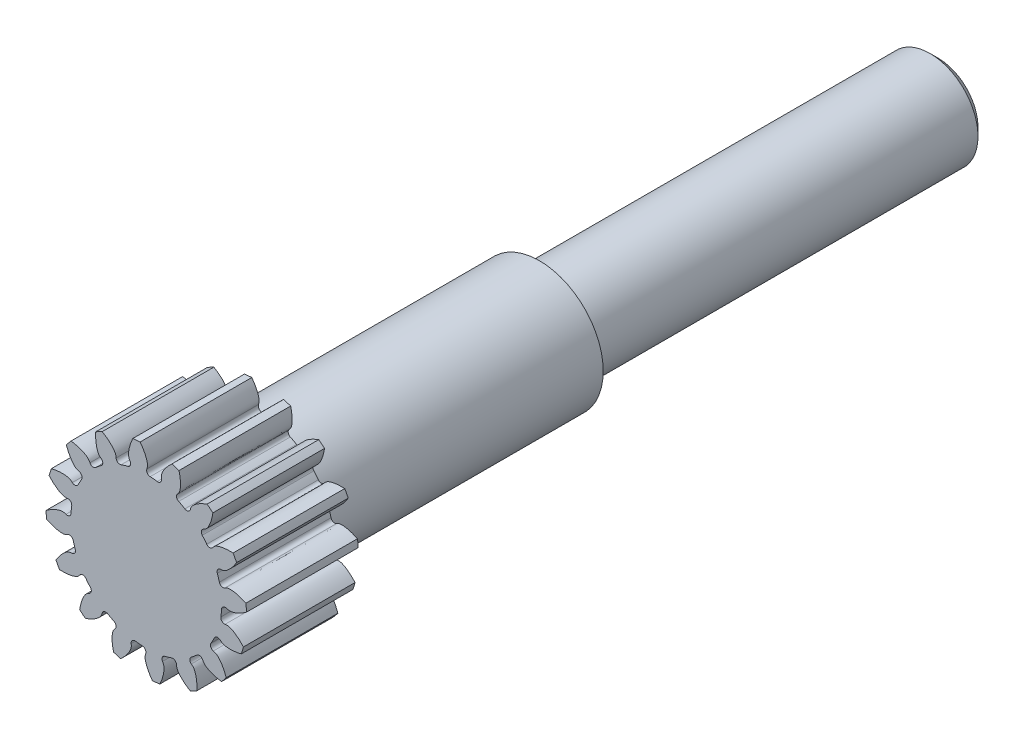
ISO-10303-21;
HEADER;
FILE_DESCRIPTION(('STEP AP214'),'2;1');
FILE_NAME('part.step','',(''),(''),'','','');
FILE_SCHEMA(('AUTOMOTIVE_DESIGN { 1 0 10303 214 1 1 1 1 }'));
ENDSEC;
DATA;
#1=APPLICATION_CONTEXT('core data for automotive mechanical design processes');
#2=APPLICATION_PROTOCOL_DEFINITION('international standard','automotive_design',2000,#1);
#3=PRODUCT_CONTEXT('',#1,'mechanical');
#4=PRODUCT('Part','Part','',(#3));
#5=PRODUCT_RELATED_PRODUCT_CATEGORY('part','',(#4));
#6=PRODUCT_DEFINITION_FORMATION('','',#4);
#7=PRODUCT_DEFINITION_CONTEXT('part definition',#1,'design');
#8=PRODUCT_DEFINITION('design','',#6,#7);
#9=PRODUCT_DEFINITION_SHAPE('','',#8);
#10=(LENGTH_UNIT() NAMED_UNIT(*) SI_UNIT(.MILLI.,.METRE.));
#11=(NAMED_UNIT(*) PLANE_ANGLE_UNIT() SI_UNIT($,.RADIAN.));
#12=(NAMED_UNIT(*) SI_UNIT($,.STERADIAN.) SOLID_ANGLE_UNIT());
#13=UNCERTAINTY_MEASURE_WITH_UNIT(LENGTH_MEASURE(1.E-05),#10,'distance_accuracy_value','');
#14=(GEOMETRIC_REPRESENTATION_CONTEXT(3) GLOBAL_UNCERTAINTY_ASSIGNED_CONTEXT((#13)) GLOBAL_UNIT_ASSIGNED_CONTEXT((#10,
#11,#12)) REPRESENTATION_CONTEXT('',''));
#15=CARTESIAN_POINT('',(0.,0.,0.));
#16=DIRECTION('',(0.,0.,1.));
#17=DIRECTION('',(1.,0.,0.));
#18=AXIS2_PLACEMENT_3D('',#15,#16,#17);
#19=CARTESIAN_POINT('',(0.,0.,-17.65));
#20=DIRECTION('',(0.,0.,1.));
#21=DIRECTION('',(1.,0.,0.));
#22=AXIS2_PLACEMENT_3D('',#19,#20,#21);
#23=PLANE('',#22);
#24=CARTESIAN_POINT('',(0.,0.,-17.65));
#25=DIRECTION('',(0.,0.,1.));
#26=DIRECTION('',(1.,0.,0.));
#27=AXIS2_PLACEMENT_3D('',#24,#25,#26);
#28=CIRCLE('',#27,4.);
#29=CARTESIAN_POINT('',(4.,0.,-17.65));
#30=VERTEX_POINT('',#29);
#31=EDGE_CURVE('E2799',#30,#30,#28,.T.);
#32=ORIENTED_EDGE('',*,*,#31,.F.);
#33=EDGE_LOOP('',(#32));
#34=FACE_BOUND('',#33,.T.);
#35=CARTESIAN_POINT('',(0.,0.,-17.65));
#36=DIRECTION('',(0.,0.,1.));
#37=DIRECTION('',(1.,0.,0.));
#38=AXIS2_PLACEMENT_3D('',#35,#36,#37);
#39=CIRCLE('',#38,3.);
#40=CARTESIAN_POINT('',(3.,0.,-17.65));
#41=VERTEX_POINT('',#40);
#42=EDGE_CURVE('E1316',#41,#41,#39,.F.);
#43=ORIENTED_EDGE('',*,*,#42,.F.);
#44=EDGE_LOOP('',(#43));
#45=FACE_BOUND('',#44,.T.);
#46=ADVANCED_FACE('F24',(#34,#45),#23,.F.);
#47=CARTESIAN_POINT('',(0.,0.,7.));
#48=DIRECTION('',(0.,0.,1.));
#49=DIRECTION('',(1.,0.,0.));
#50=AXIS2_PLACEMENT_3D('',#47,#48,#49);
#51=PLANE('',#50);
#52=CARTESIAN_POINT('',(5.01419090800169,-3.81416957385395,7.));
#53=CARTESIAN_POINT('',(4.9901133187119,-3.74971588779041,7.));
#54=CARTESIAN_POINT('',(4.94260878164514,-3.62255022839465,7.));
#55=CARTESIAN_POINT('',(4.85769497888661,-3.4404631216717,7.));
#56=CARTESIAN_POINT('',(4.76437160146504,-3.26914468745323,7.));
#57=CARTESIAN_POINT('',(4.67635305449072,-3.13797339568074,7.));
#58=CARTESIAN_POINT('',(4.60242448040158,-3.04091843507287,7.));
#59=CARTESIAN_POINT('',(4.54514105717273,-2.9742407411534,7.));
#60=CARTESIAN_POINT('',(4.48462943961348,-2.91258167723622,7.));
#61=CARTESIAN_POINT('',(4.35283998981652,-2.79911194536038,7.));
#62=CARTESIAN_POINT('',(4.07253669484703,-2.72776059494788,7.));
#63=CARTESIAN_POINT('',(3.82665531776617,-2.72661901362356,7.));
#64=CARTESIAN_POINT('',(3.69593406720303,-2.72601209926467,7.));
#65=B_SPLINE_CURVE_WITH_KNOTS('',3,(#52,#53,#54,#55,#56,#57,#58,#59,#60,#61,#62,#63,#64),
.UNSPECIFIED.,.F.,.F.,(4,1,1,1,1,1,1,1,1,1,4),(0.,0.109694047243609,0.216423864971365,
0.320121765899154,0.420535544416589,0.467979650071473,0.51465736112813,0.560589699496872,
0.605796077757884,0.790424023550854,1.),.UNSPECIFIED.);
#66=CARTESIAN_POINT('',(5.01419090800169,-3.81416957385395,7.));
#67=VERTEX_POINT('',#66);
#68=CARTESIAN_POINT('',(4.20357866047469,-2.76672845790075,7.));
#69=VERTEX_POINT('',#68);
#70=EDGE_CURVE('E1129',#67,#69,#65,.T.);
#71=ORIENTED_EDGE('',*,*,#70,.T.);
#72=CARTESIAN_POINT('',(4.25833501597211,-2.53994523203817,7.));
#73=DIRECTION('',(0.,0.,1.));
#74=DIRECTION('',(1.,0.,0.));
#75=AXIS2_PLACEMENT_3D('',#72,#73,#74);
#76=CIRCLE('',#75,0.2333);
#77=CARTESIAN_POINT('',(4.05797006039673,-2.42043466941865,7.));
#78=VERTEX_POINT('',#77);
#79=EDGE_CURVE('E1131',#69,#78,#76,.F.);
#80=ORIENTED_EDGE('',*,*,#79,.T.);
#81=CARTESIAN_POINT('',(0.,0.,7.));
#82=DIRECTION('',(0.,0.,1.));
#83=DIRECTION('',(1.,0.,0.));
#84=AXIS2_PLACEMENT_3D('',#81,#82,#83);
#85=CIRCLE('',#84,4.725);
#86=CARTESIAN_POINT('',(4.26670172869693,-2.02999540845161,7.));
#87=VERTEX_POINT('',#86);
#88=EDGE_CURVE('E1931',#78,#87,#85,.T.);
#89=ORIENTED_EDGE('',*,*,#88,.T.);
#90=CARTESIAN_POINT('',(4.47737294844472,-2.1302277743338,7.));
#91=DIRECTION('',(0.,0.,1.));
#92=DIRECTION('',(1.,0.,0.));
#93=AXIS2_PLACEMENT_3D('',#90,#91,#92);
#94=CIRCLE('',#93,0.2333);
#95=CARTESIAN_POINT('',(4.63554095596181,-1.95872916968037,7.));
#96=VERTEX_POINT('',#95);
#97=EDGE_CURVE('E1323',#87,#96,#94,.F.);
#98=ORIENTED_EDGE('',*,*,#97,.T.);
#99=CARTESIAN_POINT('',(4.31971405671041,-1.55921167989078,7.));
#100=CARTESIAN_POINT('',(4.39282731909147,-1.66757617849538,7.));
#101=CARTESIAN_POINT('',(4.53035040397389,-1.87140541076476,7.));
#102=CARTESIAN_POINT('',(4.74537612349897,-2.06486055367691,7.));
#103=CARTESIAN_POINT('',(4.91293409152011,-2.11142412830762,7.));
#104=CARTESIAN_POINT('',(4.9978177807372,-2.12749445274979,7.));
#105=CARTESIAN_POINT('',(5.08508163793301,-2.13809278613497,7.));
#106=CARTESIAN_POINT('',(5.20685127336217,-2.14565951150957,7.));
#107=CARTESIAN_POINT('',(5.36481665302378,-2.14599301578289,7.));
#108=CARTESIAN_POINT('',(5.55911304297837,-2.12843820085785,7.));
#109=CARTESIAN_POINT('',(5.75769308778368,-2.09790896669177,7.));
#110=CARTESIAN_POINT('',(5.88982423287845,-2.0667778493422,7.));
#111=CARTESIAN_POINT('',(5.95679466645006,-2.05099909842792,7.));
#112=B_SPLINE_CURVE_WITH_KNOTS('',3,(#99,#100,#101,#102,#103,#104,#105,#106,#107,#108,#109,#110,
#111),.UNSPECIFIED.,.F.,.F.,(4,1,1,1,1,1,1,1,1,1,4),(0.,0.209575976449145,0.394203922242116,
0.439410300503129,0.48534263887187,0.532020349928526,0.57946445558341,0.679878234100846,
0.783576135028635,0.890305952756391,1.),.UNSPECIFIED.);
#113=CARTESIAN_POINT('',(5.95679466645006,-2.05099909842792,7.));
#114=VERTEX_POINT('',#113);
#115=EDGE_CURVE('E1155',#96,#114,#112,.T.);
#116=ORIENTED_EDGE('',*,*,#115,.T.);
#117=CARTESIAN_POINT('',(0.,0.,7.));
#118=DIRECTION('',(0.,0.,1.));
#119=DIRECTION('',(-0.923879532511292,0.382683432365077,0.));
#120=AXIS2_PLACEMENT_3D('',#117,#118,#119);
#121=CIRCLE('',#120,6.3);
#122=CARTESIAN_POINT('',(6.09212785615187,-1.60498541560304,7.));
#123=VERTEX_POINT('',#122);
#124=EDGE_CURVE('E641',#114,#123,#121,.T.);
#125=ORIENTED_EDGE('',*,*,#124,.T.);
#126=CARTESIAN_POINT('',(6.09212785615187,-1.60498541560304,7.));
#127=CARTESIAN_POINT('',(6.04521770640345,-1.55465206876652,7.));
#128=CARTESIAN_POINT('',(5.9526650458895,-1.4553455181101,7.));
#129=CARTESIAN_POINT('',(5.80453320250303,-1.31961407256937,7.));
#130=CARTESIAN_POINT('',(5.65275291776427,-1.19704978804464,7.));
#131=CARTESIAN_POINT('',(5.52123730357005,-1.10954655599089,7.));
#132=CARTESIAN_POINT('',(5.41579488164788,-1.04817070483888,7.));
#133=CARTESIAN_POINT('',(5.33735545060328,-1.00848996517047,7.));
#134=CARTESIAN_POINT('',(5.25785410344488,-0.974681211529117,7.));
#135=CARTESIAN_POINT('',(5.09267354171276,-0.920282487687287,7.));
#136=CARTESIAN_POINT('',(4.80640208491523,-0.961629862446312,7.));
#137=CARTESIAN_POINT('',(4.57880044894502,-1.05466990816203,7.));
#138=CARTESIAN_POINT('',(4.45779750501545,-1.10413404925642,7.));
#139=B_SPLINE_CURVE_WITH_KNOTS('',3,(#126,#127,#128,#129,#130,#131,#132,#133,#134,#135,#136,
#137,#138),.UNSPECIFIED.,.F.,.F.,(4,1,1,1,1,1,1,1,1,1,4),(0.,0.109694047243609,
0.216423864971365,0.320121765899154,0.420535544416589,0.467979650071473,0.51465736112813,
0.560589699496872,0.605796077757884,0.790424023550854,1.),.UNSPECIFIED.);
#140=CARTESIAN_POINT('',(4.94238143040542,-0.947483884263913,7.));
#141=VERTEX_POINT('',#140);
#142=EDGE_CURVE('E647',#123,#141,#139,.T.);
#143=ORIENTED_EDGE('',*,*,#142,.T.);
#144=CARTESIAN_POINT('',(4.90618352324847,-0.717009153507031,7.));
#145=DIRECTION('',(0.,0.,1.));
#146=DIRECTION('',(1.,0.,0.));
#147=AXIS2_PLACEMENT_3D('',#144,#145,#146);
#148=CIRCLE('',#147,0.2333);
#149=CARTESIAN_POINT('',(4.67533572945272,-0.683272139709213,7.));
#150=VERTEX_POINT('',#149);
#151=EDGE_CURVE('E39',#141,#150,#148,.F.);
#152=ORIENTED_EDGE('',*,*,#151,.T.);
#153=CARTESIAN_POINT('',(4.71876400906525,-0.242675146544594,7.));
#154=VERTEX_POINT('',#153);
#155=EDGE_CURVE('E1608',#150,#154,#85,.T.);
#156=ORIENTED_EDGE('',*,*,#155,.T.);
#157=CARTESIAN_POINT('',(4.95175610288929,-0.254657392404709,7.));
#158=DIRECTION('',(0.,0.,1.));
#159=DIRECTION('',(1.,0.,0.));
#160=AXIS2_PLACEMENT_3D('',#157,#158,#159);
#161=CIRCLE('',#160,0.2333);
#162=CARTESIAN_POINT('',(5.03225461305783,-0.0356850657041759,7.));
#163=VERTEX_POINT('',#162);
#164=EDGE_CURVE('E1588',#154,#163,#161,.F.);
#165=ORIENTED_EDGE('',*,*,#164,.T.);
#166=CARTESIAN_POINT('',(4.58757988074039,0.212559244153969,7.));
#167=CARTESIAN_POINT('',(4.69659702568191,0.140422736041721,7.));
#168=CARTESIAN_POINT('',(4.90165385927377,0.00473688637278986,7.));
#169=CARTESIAN_POINT('',(5.17434379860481,-0.0917055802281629,7.));
#170=CARTESIAN_POINT('',(5.34696628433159,-0.0706030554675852,7.));
#171=CARTESIAN_POINT('',(5.43153843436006,-0.0529665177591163,7.));
#172=CARTESIAN_POINT('',(5.51621553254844,-0.0293636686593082,7.));
#173=CARTESIAN_POINT('',(5.63161166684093,0.0102448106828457,7.));
#174=CARTESIAN_POINT('',(5.77768027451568,0.0703874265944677,7.));
#175=CARTESIAN_POINT('',(5.95046879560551,0.160959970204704,7.));
#176=CARTESIAN_POINT('',(6.12224980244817,0.265158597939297,7.));
#177=CARTESIAN_POINT('',(6.2324097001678,0.344484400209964,7.));
#178=CARTESIAN_POINT('',(6.28824404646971,0.384690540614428,7.));
#179=B_SPLINE_CURVE_WITH_KNOTS('',3,(#166,#167,#168,#169,#170,#171,#172,#173,#174,#175,#176,
#177,#178),.UNSPECIFIED.,.F.,.F.,(4,1,1,1,1,1,1,1,1,1,4),(0.,0.209575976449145,
0.394203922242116,0.439410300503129,0.48534263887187,0.532020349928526,0.57946445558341,
0.679878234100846,0.783576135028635,0.890305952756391,1.),.UNSPECIFIED.);
#180=CARTESIAN_POINT('',(6.28824404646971,0.384690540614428,7.));
#181=VERTEX_POINT('',#180);
#182=EDGE_CURVE('E1096',#163,#181,#179,.T.);
#183=ORIENTED_EDGE('',*,*,#182,.T.);
#184=CARTESIAN_POINT('',(0.,0.,7.));
#185=DIRECTION('',(0.,0.,1.));
#186=DIRECTION('',(-1.,0.,0.));
#187=AXIS2_PLACEMENT_3D('',#184,#185,#186);
#188=CIRCLE('',#187,6.3);
#189=CARTESIAN_POINT('',(6.24259356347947,0.848543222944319,7.));
#190=VERTEX_POINT('',#189);
#191=EDGE_CURVE('E1104',#181,#190,#188,.T.);
#192=ORIENTED_EDGE('',*,*,#191,.T.);
#193=CARTESIAN_POINT('',(6.24259356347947,0.848543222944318,7.));
#194=CARTESIAN_POINT('',(6.17999249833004,0.877093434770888,7.));
#195=CARTESIAN_POINT('',(6.0564820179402,0.933422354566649,7.));
#196=CARTESIAN_POINT('',(5.86768386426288,1.0021342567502,7.));
#197=CARTESIAN_POINT('',(5.68055384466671,1.05728509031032,7.));
#198=CARTESIAN_POINT('',(5.52556322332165,1.08779868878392,7.));
#199=CARTESIAN_POINT('',(5.40465960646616,1.10415151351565,7.));
#200=CARTESIAN_POINT('',(5.31700585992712,1.11079426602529,7.));
#201=CARTESIAN_POINT('',(5.23061814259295,1.11160563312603,7.));
#202=CARTESIAN_POINT('',(5.05719371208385,1.09865163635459,7.));
#203=CARTESIAN_POINT('',(4.80853632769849,0.950900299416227,7.));
#204=CARTESIAN_POINT('',(4.63386471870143,0.777843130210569,7.));
#205=CARTESIAN_POINT('',(4.54100168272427,0.685838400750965,7.));
#206=B_SPLINE_CURVE_WITH_KNOTS('',3,(#193,#194,#195,#196,#197,#198,#199,#200,#201,#202,#203,
#204,#205),.UNSPECIFIED.,.F.,.F.,(4,1,1,1,1,1,1,1,1,1,4),(0.,0.109694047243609,
0.216423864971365,0.320121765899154,0.420535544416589,0.467979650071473,0.51465736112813,
0.560589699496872,0.605796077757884,0.790424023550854,1.),.UNSPECIFIED.);
#207=CARTESIAN_POINT('',(4.92875143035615,1.01600652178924,7.));
#208=VERTEX_POINT('',#207);
#209=EDGE_CURVE('E1619',#190,#208,#206,.T.);
#210=ORIENTED_EDGE('',*,*,#209,.T.);
#211=CARTESIAN_POINT('',(4.80711006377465,1.21508506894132,7.));
#212=DIRECTION('',(0.,0.,1.));
#213=DIRECTION('',(1.,0.,0.));
#214=AXIS2_PLACEMENT_3D('',#211,#212,#213);
#215=CIRCLE('',#214,0.2333);
#216=CARTESIAN_POINT('',(4.58092391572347,1.15791237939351,7.));
#217=VERTEX_POINT('',#216);
#218=EDGE_CURVE('E1586',#208,#217,#215,.F.);
#219=ORIENTED_EDGE('',*,*,#218,.T.);
#220=CARTESIAN_POINT('',(4.45243724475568,1.58159020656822,7.));
#221=VERTEX_POINT('',#220);
#222=EDGE_CURVE('E1604',#217,#221,#85,.T.);
#223=ORIENTED_EDGE('',*,*,#222,.T.);
#224=CARTESIAN_POINT('',(4.67227927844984,1.65968226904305,7.));
#225=DIRECTION('',(0.,0.,1.));
#226=DIRECTION('',(1.,0.,0.));
#227=AXIS2_PLACEMENT_3D('',#224,#225,#226);
#228=CIRCLE('',#227,0.2333);
#229=CARTESIAN_POINT('',(4.66285312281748,1.89279176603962,7.));
#230=VERTEX_POINT('',#229);
#231=EDGE_CURVE('E1570',#221,#230,#228,.F.);
#232=ORIENTED_EDGE('',*,*,#231,.T.);
#233=CARTESIAN_POINT('',(4.15702825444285,1.95196995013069,7.));
#234=CARTESIAN_POINT('',(4.28535240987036,1.92704356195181,7.));
#235=CARTESIAN_POINT('',(4.52672494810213,1.88015803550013,7.));
#236=CARTESIAN_POINT('',(4.81556453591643,1.89541073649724,7.));
#237=CARTESIAN_POINT('',(4.96697133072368,1.98096669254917,7.));
#238=CARTESIAN_POINT('',(5.03835659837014,2.02962508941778,7.));
#239=CARTESIAN_POINT('',(5.10755561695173,2.08383580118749,7.));
#240=CARTESIAN_POINT('',(5.19901023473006,2.16458945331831,7.));
#241=CARTESIAN_POINT('',(5.31094444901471,2.27605202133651,7.));
#242=CARTESIAN_POINT('',(5.4359196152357,2.42585344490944,7.));
#243=CARTESIAN_POINT('',(5.5547494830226,2.58785816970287,7.));
#244=CARTESIAN_POINT('',(5.62616728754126,2.70330202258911,7.));
#245=CARTESIAN_POINT('',(5.66236527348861,2.76181453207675,7.));
#246=B_SPLINE_CURVE_WITH_KNOTS('',3,(#233,#234,#235,#236,#237,#238,#239,#240,#241,#242,#243,
#244,#245),.UNSPECIFIED.,.F.,.F.,(4,1,1,1,1,1,1,1,1,1,4),(0.,0.209575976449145,
0.394203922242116,0.439410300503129,0.48534263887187,0.532020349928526,0.57946445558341,
0.679878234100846,0.783576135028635,0.890305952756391,1.),.UNSPECIFIED.);
#247=CARTESIAN_POINT('',(5.66236527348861,2.76181453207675,7.));
#248=VERTEX_POINT('',#247);
#249=EDGE_CURVE('E1639',#230,#248,#246,.T.);
#250=ORIENTED_EDGE('',*,*,#249,.T.);
#251=CARTESIAN_POINT('',(0.,0.,7.));
#252=DIRECTION('',(0.,0.,1.));
#253=DIRECTION('',(-0.923879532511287,-0.382683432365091,0.));
#254=AXIS2_PLACEMENT_3D('',#251,#252,#253);
#255=CIRCLE('',#254,6.3);
#256=CARTESIAN_POINT('',(5.44268099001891,3.17288884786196,7.));
#257=VERTEX_POINT('',#256);
#258=EDGE_CURVE('E1072',#248,#257,#255,.T.);
#259=ORIENTED_EDGE('',*,*,#258,.T.);
#260=CARTESIAN_POINT('',(5.44268099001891,3.17288884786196,7.));
#261=CARTESIAN_POINT('',(5.3739194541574,3.1753094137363,7.));
#262=CARTESIAN_POINT('',(5.23825450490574,3.18008513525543,7.));
#263=CARTESIAN_POINT('',(5.0375328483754,3.1713167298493,7.));
#264=CARTESIAN_POINT('',(4.84354194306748,3.15065789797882,7.));
#265=CARTESIAN_POINT('',(4.68867223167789,3.11953644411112,7.));
#266=CARTESIAN_POINT('',(4.57071389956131,3.0883766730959,7.));
#267=CARTESIAN_POINT('',(4.48719032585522,3.06097013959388,7.));
#268=CARTESIAN_POINT('',(4.40706798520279,3.02866059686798,7.));
#269=CARTESIAN_POINT('',(4.25180198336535,2.95032600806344,7.));
#270=CARTESIAN_POINT('',(4.07861450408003,2.71866451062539,7.));
#271=CARTESIAN_POINT('',(3.98346509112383,2.49193660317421,7.));
#272=CARTESIAN_POINT('',(3.9328795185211,2.37139817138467,7.));
#273=B_SPLINE_CURVE_WITH_KNOTS('',3,(#260,#261,#262,#263,#264,#265,#266,#267,#268,#269,#270,
#271,#272),.UNSPECIFIED.,.F.,.F.,(4,1,1,1,1,1,1,1,1,1,4),(0.,0.109694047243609,
0.216423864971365,0.320121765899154,0.420535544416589,0.467979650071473,0.51465736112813,
0.560589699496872,0.605796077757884,0.790424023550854,1.),.UNSPECIFIED.);
#274=CARTESIAN_POINT('',(4.16476370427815,2.8248191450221,7.));
#275=VERTEX_POINT('',#274);
#276=EDGE_CURVE('E1064',#257,#275,#273,.T.);
#277=ORIENTED_EDGE('',*,*,#276,.T.);
#278=CARTESIAN_POINT('',(3.97619767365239,2.962193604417,7.));
#279=DIRECTION('',(0.,0.,1.));
#280=DIRECTION('',(1.,0.,0.));
#281=AXIS2_PLACEMENT_3D('',#278,#279,#280);
#282=CIRCLE('',#281,0.2333);
#283=CARTESIAN_POINT('',(3.78910796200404,2.8228152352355,7.));
#284=VERTEX_POINT('',#283);
#285=EDGE_CURVE('E1568',#275,#284,#282,.F.);
#286=ORIENTED_EDGE('',*,*,#285,.T.);
#287=CARTESIAN_POINT('',(3.50826727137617,3.16507278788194,7.));
#288=VERTEX_POINT('',#287);
#289=EDGE_CURVE('E1607',#284,#288,#85,.T.);
#290=ORIENTED_EDGE('',*,*,#289,.T.);
#291=CARTESIAN_POINT('',(3.68149028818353,3.32135035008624,7.));
#292=DIRECTION('',(0.,0.,1.));
#293=DIRECTION('',(1.,0.,0.));
#294=AXIS2_PLACEMENT_3D('',#291,#292,#293);
#295=CIRCLE('',#294,0.2333);
#296=CARTESIAN_POINT('',(3.58357451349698,3.53310820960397,7.));
#297=VERTEX_POINT('',#296);
#298=EDGE_CURVE('E1552',#288,#297,#295,.F.);
#299=ORIENTED_EDGE('',*,*,#298,.T.);
#300=CARTESIAN_POINT('',(3.09360675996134,3.39421092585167,7.));
#301=CARTESIAN_POINT('',(3.22170173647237,3.42028947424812,7.));
#302=CARTESIAN_POINT('',(3.46264319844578,3.46934216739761,7.));
#303=CARTESIAN_POINT('',(3.723659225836,3.59396795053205,7.));
#304=CARTESIAN_POINT('',(3.83080001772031,3.73095221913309,7.));
#305=CARTESIAN_POINT('',(3.87813064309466,3.80322467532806,7.));
#306=CARTESIAN_POINT('',(3.92131665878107,3.87979016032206,7.));
#307=CARTESIAN_POINT('',(3.97490662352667,3.98939497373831,7.));
#308=CARTESIAN_POINT('',(4.03566547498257,4.13520832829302,7.));
#309=CARTESIAN_POINT('',(4.09380095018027,4.32143272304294,7.));
#310=CARTESIAN_POINT('',(4.1415889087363,4.5165797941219,7.));
#311=CARTESIAN_POINT('',(4.16339190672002,4.65056641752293,7.));
#312=CARTESIAN_POINT('',(4.17444271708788,4.71847729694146,7.));
#313=B_SPLINE_CURVE_WITH_KNOTS('',3,(#300,#301,#302,#303,#304,#305,#306,#307,#308,#309,#310,
#311,#312),.UNSPECIFIED.,.F.,.F.,(4,1,1,1,1,1,1,1,1,1,4),(0.,0.209575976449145,
0.394203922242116,0.439410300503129,0.48534263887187,0.532020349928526,0.57946445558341,
0.679878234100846,0.783576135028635,0.890305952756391,1.),.UNSPECIFIED.);
#314=CARTESIAN_POINT('',(4.17444271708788,4.71847729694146,7.));
#315=VERTEX_POINT('',#314);
#316=EDGE_CURVE('E1034',#297,#315,#313,.T.);
#317=ORIENTED_EDGE('',*,*,#316,.T.);
#318=CARTESIAN_POINT('',(0.,0.,7.));
#319=DIRECTION('',(0.,0.,1.));
#320=DIRECTION('',(-0.707106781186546,-0.707106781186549,0.));
#321=AXIS2_PLACEMENT_3D('',#318,#319,#320);
#322=CIRCLE('',#321,6.3);
#323=CARTESIAN_POINT('',(3.814169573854,5.01419090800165,7.));
#324=VERTEX_POINT('',#323);
#325=EDGE_CURVE('E1042',#315,#324,#322,.T.);
#326=ORIENTED_EDGE('',*,*,#325,.T.);
#327=CARTESIAN_POINT('',(3.814169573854,5.01419090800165,7.));
#328=CARTESIAN_POINT('',(3.74971588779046,4.99011331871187,7.));
#329=CARTESIAN_POINT('',(3.6225502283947,4.9426087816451,7.));
#330=CARTESIAN_POINT('',(3.44046312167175,4.85769497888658,7.));
#331=CARTESIAN_POINT('',(3.26914468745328,4.764371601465,7.));
#332=CARTESIAN_POINT('',(3.13797339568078,4.67635305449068,7.));
#333=CARTESIAN_POINT('',(3.04091843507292,4.60242448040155,7.));
#334=CARTESIAN_POINT('',(2.97424074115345,4.5451410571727,7.));
#335=CARTESIAN_POINT('',(2.91258167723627,4.48462943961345,7.));
#336=CARTESIAN_POINT('',(2.79911194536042,4.35283998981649,7.));
#337=CARTESIAN_POINT('',(2.72776059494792,4.072536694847,7.));
#338=CARTESIAN_POINT('',(2.7266190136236,3.82665531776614,7.));
#339=CARTESIAN_POINT('',(2.72601209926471,3.69593406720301,7.));
#340=B_SPLINE_CURVE_WITH_KNOTS('',3,(#327,#328,#329,#330,#331,#332,#333,#334,#335,#336,#337,
#338,#339),.UNSPECIFIED.,.F.,.F.,(4,1,1,1,1,1,1,1,1,1,4),(0.,0.109694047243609,
0.216423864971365,0.320121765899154,0.420535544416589,0.467979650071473,0.51465736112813,
0.560589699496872,0.605796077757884,0.790424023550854,1.),.UNSPECIFIED.);
#341=CARTESIAN_POINT('',(2.7667284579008,4.20357866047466,7.));
#342=VERTEX_POINT('',#341);
#343=EDGE_CURVE('E1669',#324,#342,#340,.T.);
#344=ORIENTED_EDGE('',*,*,#343,.T.);
#345=CARTESIAN_POINT('',(2.53994523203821,4.25833501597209,7.));
#346=DIRECTION('',(0.,0.,1.));
#347=DIRECTION('',(1.,0.,0.));
#348=AXIS2_PLACEMENT_3D('',#345,#346,#347);
#349=CIRCLE('',#348,0.2333);
#350=CARTESIAN_POINT('',(2.42043466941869,4.05797006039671,7.));
#351=VERTEX_POINT('',#350);
#352=EDGE_CURVE('E1550',#342,#351,#349,.F.);
#353=ORIENTED_EDGE('',*,*,#352,.T.);
#354=CARTESIAN_POINT('',(2.02999540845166,4.26670172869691,7.));
#355=VERTEX_POINT('',#354);
#356=EDGE_CURVE('E1977',#351,#355,#85,.T.);
#357=ORIENTED_EDGE('',*,*,#356,.T.);
#358=CARTESIAN_POINT('',(2.13022777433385,4.4773729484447,7.));
#359=DIRECTION('',(0.,0.,1.));
#360=DIRECTION('',(1.,0.,0.));
#361=AXIS2_PLACEMENT_3D('',#358,#359,#360);
#362=CIRCLE('',#361,0.2333);
#363=CARTESIAN_POINT('',(1.95872916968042,4.63554095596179,7.));
#364=VERTEX_POINT('',#363);
#365=EDGE_CURVE('E1534',#355,#364,#362,.F.);
#366=ORIENTED_EDGE('',*,*,#365,.T.);
#367=CARTESIAN_POINT('',(1.55921167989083,4.31971405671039,7.));
#368=CARTESIAN_POINT('',(1.66757617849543,4.39282731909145,7.));
#369=CARTESIAN_POINT('',(1.87140541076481,4.53035040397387,7.));
#370=CARTESIAN_POINT('',(2.06486055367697,4.74537612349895,7.));
#371=CARTESIAN_POINT('',(2.11142412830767,4.91293409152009,7.));
#372=CARTESIAN_POINT('',(2.12749445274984,4.99781778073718,7.));
#373=CARTESIAN_POINT('',(2.13809278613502,5.08508163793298,7.));
#374=CARTESIAN_POINT('',(2.14565951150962,5.20685127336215,7.));
#375=CARTESIAN_POINT('',(2.14599301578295,5.36481665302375,7.));
#376=CARTESIAN_POINT('',(2.12843820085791,5.55911304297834,7.));
#377=CARTESIAN_POINT('',(2.09790896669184,5.75769308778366,7.));
#378=CARTESIAN_POINT('',(2.06677784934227,5.88982423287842,7.));
#379=CARTESIAN_POINT('',(2.05099909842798,5.95679466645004,7.));
#380=B_SPLINE_CURVE_WITH_KNOTS('',3,(#367,#368,#369,#370,#371,#372,#373,#374,#375,#376,#377,
#378,#379),.UNSPECIFIED.,.F.,.F.,(4,1,1,1,1,1,1,1,1,1,4),(0.,0.209575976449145,
0.394203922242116,0.439410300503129,0.48534263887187,0.532020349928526,0.57946445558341,
0.679878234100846,0.783576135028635,0.890305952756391,1.),.UNSPECIFIED.);
#381=CARTESIAN_POINT('',(2.05099909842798,5.95679466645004,7.));
#382=VERTEX_POINT('',#381);
#383=EDGE_CURVE('E1681',#364,#382,#380,.T.);
#384=ORIENTED_EDGE('',*,*,#383,.T.);
#385=CARTESIAN_POINT('',(0.,0.,7.));
#386=DIRECTION('',(0.,0.,1.));
#387=DIRECTION('',(-0.382683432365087,-0.923879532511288,0.));
#388=AXIS2_PLACEMENT_3D('',#385,#386,#387);
#389=CIRCLE('',#388,6.3);
#390=CARTESIAN_POINT('',(1.60498541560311,6.09212785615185,7.));
#391=VERTEX_POINT('',#390);
#392=EDGE_CURVE('E1010',#382,#391,#389,.T.);
#393=ORIENTED_EDGE('',*,*,#392,.T.);
#394=CARTESIAN_POINT('',(1.60498541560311,6.09212785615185,7.));
#395=CARTESIAN_POINT('',(1.55465206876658,6.04521770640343,7.));
#396=CARTESIAN_POINT('',(1.45534551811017,5.95266504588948,7.));
#397=CARTESIAN_POINT('',(1.31961407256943,5.80453320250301,7.));
#398=CARTESIAN_POINT('',(1.1970497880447,5.65275291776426,7.));
#399=CARTESIAN_POINT('',(1.10954655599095,5.52123730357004,7.));
#400=CARTESIAN_POINT('',(1.04817070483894,5.41579488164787,7.));
#401=CARTESIAN_POINT('',(1.00848996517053,5.33735545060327,7.));
#402=CARTESIAN_POINT('',(0.974681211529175,5.25785410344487,7.));
#403=CARTESIAN_POINT('',(0.920282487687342,5.09267354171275,7.));
#404=CARTESIAN_POINT('',(0.961629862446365,4.80640208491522,7.));
#405=CARTESIAN_POINT('',(1.05466990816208,4.57880044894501,7.));
#406=CARTESIAN_POINT('',(1.10413404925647,4.45779750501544,7.));
#407=B_SPLINE_CURVE_WITH_KNOTS('',3,(#394,#395,#396,#397,#398,#399,#400,#401,#402,#403,#404,
#405,#406),.UNSPECIFIED.,.F.,.F.,(4,1,1,1,1,1,1,1,1,1,4),(0.,0.109694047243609,
0.216423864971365,0.320121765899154,0.420535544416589,0.467979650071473,0.51465736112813,
0.560589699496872,0.605796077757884,0.790424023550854,1.),.UNSPECIFIED.);
#408=CARTESIAN_POINT('',(0.947483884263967,4.9423814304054,7.));
#409=VERTEX_POINT('',#408);
#410=EDGE_CURVE('E1002',#391,#409,#407,.T.);
#411=ORIENTED_EDGE('',*,*,#410,.T.);
#412=CARTESIAN_POINT('',(0.717009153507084,4.90618352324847,7.));
#413=DIRECTION('',(0.,0.,1.));
#414=DIRECTION('',(1.,0.,0.));
#415=AXIS2_PLACEMENT_3D('',#412,#413,#414);
#416=CIRCLE('',#415,0.2333);
#417=CARTESIAN_POINT('',(0.683272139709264,4.67533572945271,7.));
#418=VERTEX_POINT('',#417);
#419=EDGE_CURVE('E1532',#409,#418,#416,.F.);
#420=ORIENTED_EDGE('',*,*,#419,.T.);
#421=CARTESIAN_POINT('',(0.242675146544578,4.71876400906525,7.));
#422=VERTEX_POINT('',#421);
#423=EDGE_CURVE('E2095',#418,#422,#85,.T.);
#424=ORIENTED_EDGE('',*,*,#423,.T.);
#425=CARTESIAN_POINT('',(0.254657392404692,4.95175610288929,7.));
#426=DIRECTION('',(0.,0.,1.));
#427=DIRECTION('',(1.,0.,0.));
#428=AXIS2_PLACEMENT_3D('',#425,#426,#427);
#429=CIRCLE('',#428,0.2333);
#430=CARTESIAN_POINT('',(0.0356850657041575,5.03225461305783,7.));
#431=VERTEX_POINT('',#430);
#432=EDGE_CURVE('E1516',#422,#431,#429,.F.);
#433=ORIENTED_EDGE('',*,*,#432,.T.);
#434=CARTESIAN_POINT('',(-0.212559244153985,4.58757988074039,7.));
#435=CARTESIAN_POINT('',(-0.140422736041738,4.69659702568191,7.));
#436=CARTESIAN_POINT('',(-0.00473688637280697,4.90165385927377,7.));
#437=CARTESIAN_POINT('',(0.0917055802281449,5.17434379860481,7.));
#438=CARTESIAN_POINT('',(0.0706030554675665,5.34696628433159,7.));
#439=CARTESIAN_POINT('',(0.0529665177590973,5.43153843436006,7.));
#440=CARTESIAN_POINT('',(0.0293636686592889,5.51621553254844,7.));
#441=CARTESIAN_POINT('',(-0.0102448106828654,5.63161166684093,7.));
#442=CARTESIAN_POINT('',(-0.0703874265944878,5.77768027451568,7.));
#443=CARTESIAN_POINT('',(-0.160959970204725,5.95046879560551,7.));
#444=CARTESIAN_POINT('',(-0.265158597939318,6.12224980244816,7.));
#445=CARTESIAN_POINT('',(-0.344484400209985,6.2324097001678,7.));
#446=CARTESIAN_POINT('',(-0.38469054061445,6.28824404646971,7.));
#447=B_SPLINE_CURVE_WITH_KNOTS('',3,(#434,#435,#436,#437,#438,#439,#440,#441,#442,#443,#444,
#445,#446),.UNSPECIFIED.,.F.,.F.,(4,1,1,1,1,1,1,1,1,1,4),(0.,0.209575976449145,
0.394203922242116,0.439410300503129,0.48534263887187,0.532020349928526,0.57946445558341,
0.679878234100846,0.783576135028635,0.890305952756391,1.),.UNSPECIFIED.);
#448=CARTESIAN_POINT('',(-0.38469054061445,6.28824404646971,7.));
#449=VERTEX_POINT('',#448);
#450=EDGE_CURVE('E972',#431,#449,#447,.T.);
#451=ORIENTED_EDGE('',*,*,#450,.T.);
#452=CARTESIAN_POINT('',(0.,0.,7.));
#453=DIRECTION('',(0.,0.,1.));
#454=DIRECTION('',(0.,-1.,0.));
#455=AXIS2_PLACEMENT_3D('',#452,#453,#454);
#456=CIRCLE('',#455,6.3);
#457=CARTESIAN_POINT('',(-0.84854322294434,6.24259356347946,7.));
#458=VERTEX_POINT('',#457);
#459=EDGE_CURVE('E980',#449,#458,#456,.T.);
#460=ORIENTED_EDGE('',*,*,#459,.T.);
#461=CARTESIAN_POINT('',(-0.848543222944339,6.24259356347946,7.));
#462=CARTESIAN_POINT('',(-0.87709343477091,6.17999249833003,7.));
#463=CARTESIAN_POINT('',(-0.93342235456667,6.0564820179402,7.));
#464=CARTESIAN_POINT('',(-1.00213425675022,5.86768386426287,7.));
#465=CARTESIAN_POINT('',(-1.05728509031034,5.6805538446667,7.));
#466=CARTESIAN_POINT('',(-1.08779868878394,5.52556322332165,7.));
#467=CARTESIAN_POINT('',(-1.10415151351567,5.40465960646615,7.));
#468=CARTESIAN_POINT('',(-1.11079426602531,5.31700585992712,7.));
#469=CARTESIAN_POINT('',(-1.11160563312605,5.23061814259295,7.));
#470=CARTESIAN_POINT('',(-1.09865163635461,5.05719371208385,7.));
#471=CARTESIAN_POINT('',(-0.950900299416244,4.80853632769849,7.));
#472=CARTESIAN_POINT('',(-0.777843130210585,4.63386471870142,7.));
#473=CARTESIAN_POINT('',(-0.685838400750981,4.54100168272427,7.));
#474=B_SPLINE_CURVE_WITH_KNOTS('',3,(#461,#462,#463,#464,#465,#466,#467,#468,#469,#470,#471,
#472,#473),.UNSPECIFIED.,.F.,.F.,(4,1,1,1,1,1,1,1,1,1,4),(0.,0.109694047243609,
0.216423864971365,0.320121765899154,0.420535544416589,0.467979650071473,0.51465736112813,
0.560589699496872,0.605796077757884,0.790424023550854,1.),.UNSPECIFIED.);
#475=CARTESIAN_POINT('',(-1.01600652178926,4.92875143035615,7.));
#476=VERTEX_POINT('',#475);
#477=EDGE_CURVE('E1711',#458,#476,#474,.T.);
#478=ORIENTED_EDGE('',*,*,#477,.T.);
#479=CARTESIAN_POINT('',(-1.21508506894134,4.80711006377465,7.));
#480=DIRECTION('',(0.,0.,1.));
#481=DIRECTION('',(1.,0.,0.));
#482=AXIS2_PLACEMENT_3D('',#479,#480,#481);
#483=CIRCLE('',#482,0.2333);
#484=CARTESIAN_POINT('',(-1.15791237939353,4.58092391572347,7.));
#485=VERTEX_POINT('',#484);
#486=EDGE_CURVE('E1514',#476,#485,#483,.F.);
#487=ORIENTED_EDGE('',*,*,#486,.T.);
#488=CARTESIAN_POINT('',(-1.58159020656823,4.45243724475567,7.));
#489=VERTEX_POINT('',#488);
#490=EDGE_CURVE('E2091',#485,#489,#85,.T.);
#491=ORIENTED_EDGE('',*,*,#490,.T.);
#492=CARTESIAN_POINT('',(-1.65968226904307,4.67227927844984,7.));
#493=DIRECTION('',(0.,0.,1.));
#494=DIRECTION('',(1.,0.,0.));
#495=AXIS2_PLACEMENT_3D('',#492,#493,#494);
#496=CIRCLE('',#495,0.2333);
#497=CARTESIAN_POINT('',(-1.89279176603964,4.66285312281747,7.));
#498=VERTEX_POINT('',#497);
#499=EDGE_CURVE('E1498',#489,#498,#496,.F.);
#500=ORIENTED_EDGE('',*,*,#499,.T.);
#501=CARTESIAN_POINT('',(-1.9519699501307,4.15702825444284,7.));
#502=CARTESIAN_POINT('',(-1.92704356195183,4.28535240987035,7.));
#503=CARTESIAN_POINT('',(-1.88015803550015,4.52672494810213,7.));
#504=CARTESIAN_POINT('',(-1.89541073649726,4.81556453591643,7.));
#505=CARTESIAN_POINT('',(-1.98096669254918,4.96697133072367,7.));
#506=CARTESIAN_POINT('',(-2.02962508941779,5.03835659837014,7.));
#507=CARTESIAN_POINT('',(-2.0838358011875,5.10755561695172,7.));
#508=CARTESIAN_POINT('',(-2.16458945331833,5.19901023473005,7.));
#509=CARTESIAN_POINT('',(-2.27605202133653,5.31094444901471,7.));
#510=CARTESIAN_POINT('',(-2.42585344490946,5.43591961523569,7.));
#511=CARTESIAN_POINT('',(-2.58785816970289,5.55474948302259,7.));
#512=CARTESIAN_POINT('',(-2.70330202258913,5.62616728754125,7.));
#513=CARTESIAN_POINT('',(-2.76181453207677,5.6623652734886,7.));
#514=B_SPLINE_CURVE_WITH_KNOTS('',3,(#501,#502,#503,#504,#505,#506,#507,#508,#509,#510,#511,
#512,#513),.UNSPECIFIED.,.F.,.F.,(4,1,1,1,1,1,1,1,1,1,4),(0.,0.209575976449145,
0.394203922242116,0.439410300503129,0.48534263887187,0.532020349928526,0.57946445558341,
0.679878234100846,0.783576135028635,0.890305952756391,1.),.UNSPECIFIED.);
#515=CARTESIAN_POINT('',(-2.76181453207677,5.6623652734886,7.));
#516=VERTEX_POINT('',#515);
#517=EDGE_CURVE('E1723',#498,#516,#514,.T.);
#518=ORIENTED_EDGE('',*,*,#517,.T.);
#519=CARTESIAN_POINT('',(0.,0.,7.));
#520=DIRECTION('',(0.,0.,1.));
#521=DIRECTION('',(0.382683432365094,-0.923879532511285,0.));
#522=AXIS2_PLACEMENT_3D('',#519,#520,#521);
#523=CIRCLE('',#522,6.3);
#524=CARTESIAN_POINT('',(-3.17288884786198,5.4426809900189,7.));
#525=VERTEX_POINT('',#524);
#526=EDGE_CURVE('E948',#516,#525,#523,.T.);
#527=ORIENTED_EDGE('',*,*,#526,.T.);
#528=CARTESIAN_POINT('',(-3.17288884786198,5.4426809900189,7.));
#529=CARTESIAN_POINT('',(-3.17530941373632,5.37391945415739,7.));
#530=CARTESIAN_POINT('',(-3.18008513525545,5.23825450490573,7.));
#531=CARTESIAN_POINT('',(-3.17131672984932,5.03753284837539,7.));
#532=CARTESIAN_POINT('',(-3.15065789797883,4.84354194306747,7.));
#533=CARTESIAN_POINT('',(-3.11953644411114,4.68867223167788,7.));
#534=CARTESIAN_POINT('',(-3.08837667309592,4.5707138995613,7.));
#535=CARTESIAN_POINT('',(-3.06097013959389,4.48719032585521,7.));
#536=CARTESIAN_POINT('',(-3.02866059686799,4.40706798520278,7.));
#537=CARTESIAN_POINT('',(-2.95032600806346,4.25180198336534,7.));
#538=CARTESIAN_POINT('',(-2.71866451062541,4.07861450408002,7.));
#539=CARTESIAN_POINT('',(-2.49193660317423,3.98346509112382,7.));
#540=CARTESIAN_POINT('',(-2.37139817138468,3.9328795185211,7.));
#541=B_SPLINE_CURVE_WITH_KNOTS('',3,(#528,#529,#530,#531,#532,#533,#534,#535,#536,#537,#538,
#539,#540),.UNSPECIFIED.,.F.,.F.,(4,1,1,1,1,1,1,1,1,1,4),(0.,0.109694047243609,
0.216423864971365,0.320121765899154,0.420535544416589,0.467979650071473,0.51465736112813,
0.560589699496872,0.605796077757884,0.790424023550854,1.),.UNSPECIFIED.);
#542=CARTESIAN_POINT('',(-2.82481914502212,4.16476370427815,7.));
#543=VERTEX_POINT('',#542);
#544=EDGE_CURVE('E940',#525,#543,#541,.T.);
#545=ORIENTED_EDGE('',*,*,#544,.T.);
#546=CARTESIAN_POINT('',(-2.96219360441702,3.97619767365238,7.));
#547=DIRECTION('',(0.,0.,1.));
#548=DIRECTION('',(1.,0.,0.));
#549=AXIS2_PLACEMENT_3D('',#546,#547,#548);
#550=CIRCLE('',#549,0.2333);
#551=CARTESIAN_POINT('',(-2.82281523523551,3.78910796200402,7.));
#552=VERTEX_POINT('',#551);
#553=EDGE_CURVE('E1496',#543,#552,#550,.F.);
#554=ORIENTED_EDGE('',*,*,#553,.T.);
#555=CARTESIAN_POINT('',(-3.16507278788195,3.50826727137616,7.));
#556=VERTEX_POINT('',#555);
#557=EDGE_CURVE('E2087',#552,#556,#85,.T.);
#558=ORIENTED_EDGE('',*,*,#557,.T.);
#559=CARTESIAN_POINT('',(-3.32135035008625,3.68149028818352,7.));
#560=DIRECTION('',(0.,0.,1.));
#561=DIRECTION('',(1.,0.,0.));
#562=AXIS2_PLACEMENT_3D('',#559,#560,#561);
#563=CIRCLE('',#562,0.2333);
#564=CARTESIAN_POINT('',(-3.53310820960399,3.58357451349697,7.));
#565=VERTEX_POINT('',#564);
#566=EDGE_CURVE('E1480',#556,#565,#563,.F.);
#567=ORIENTED_EDGE('',*,*,#566,.T.);
#568=CARTESIAN_POINT('',(-3.39421092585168,3.09360675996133,7.));
#569=CARTESIAN_POINT('',(-3.42028947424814,3.22170173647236,7.));
#570=CARTESIAN_POINT('',(-3.46934216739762,3.46264319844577,7.));
#571=CARTESIAN_POINT('',(-3.59396795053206,3.72365922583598,7.));
#572=CARTESIAN_POINT('',(-3.7309522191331,3.8308000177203,7.));
#573=CARTESIAN_POINT('',(-3.80322467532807,3.87813064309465,7.));
#574=CARTESIAN_POINT('',(-3.87979016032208,3.92131665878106,7.));
#575=CARTESIAN_POINT('',(-3.98939497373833,3.97490662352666,7.));
#576=CARTESIAN_POINT('',(-4.13520832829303,4.03566547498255,7.));
#577=CARTESIAN_POINT('',(-4.32143272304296,4.09380095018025,7.));
#578=CARTESIAN_POINT('',(-4.51657979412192,4.14158890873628,7.));
#579=CARTESIAN_POINT('',(-4.65056641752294,4.16339190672,7.));
#580=CARTESIAN_POINT('',(-4.71847729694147,4.17444271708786,7.));
#581=B_SPLINE_CURVE_WITH_KNOTS('',3,(#568,#569,#570,#571,#572,#573,#574,#575,#576,#577,#578,
#579,#580),.UNSPECIFIED.,.F.,.F.,(4,1,1,1,1,1,1,1,1,1,4),(0.,0.209575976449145,
0.394203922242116,0.439410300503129,0.48534263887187,0.532020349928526,0.57946445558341,
0.679878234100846,0.783576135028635,0.890305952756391,1.),.UNSPECIFIED.);
#582=CARTESIAN_POINT('',(-4.71847729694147,4.17444271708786,7.));
#583=VERTEX_POINT('',#582);
#584=EDGE_CURVE('E910',#565,#583,#581,.T.);
#585=ORIENTED_EDGE('',*,*,#584,.T.);
#586=CARTESIAN_POINT('',(0.,0.,7.));
#587=DIRECTION('',(0.,0.,1.));
#588=DIRECTION('',(0.707106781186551,-0.707106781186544,0.));
#589=AXIS2_PLACEMENT_3D('',#586,#587,#588);
#590=CIRCLE('',#589,6.3);
#591=CARTESIAN_POINT('',(-5.01419090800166,3.81416957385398,7.));
#592=VERTEX_POINT('',#591);
#593=EDGE_CURVE('E918',#583,#592,#590,.T.);
#594=ORIENTED_EDGE('',*,*,#593,.T.);
#595=CARTESIAN_POINT('',(-5.01419090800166,3.81416957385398,7.));
#596=CARTESIAN_POINT('',(-4.99011331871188,3.74971588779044,7.));
#597=CARTESIAN_POINT('',(-4.94260878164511,3.62255022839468,7.));
#598=CARTESIAN_POINT('',(-4.85769497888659,3.44046312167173,7.));
#599=CARTESIAN_POINT('',(-4.76437160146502,3.26914468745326,7.));
#600=CARTESIAN_POINT('',(-4.6763530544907,3.13797339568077,7.));
#601=CARTESIAN_POINT('',(-4.60242448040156,3.0409184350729,7.));
#602=CARTESIAN_POINT('',(-4.54514105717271,2.97424074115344,7.));
#603=CARTESIAN_POINT('',(-4.48462943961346,2.91258167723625,7.));
#604=CARTESIAN_POINT('',(-4.3528399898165,2.79911194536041,7.));
#605=CARTESIAN_POINT('',(-4.07253669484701,2.72776059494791,7.));
#606=CARTESIAN_POINT('',(-3.82665531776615,2.72661901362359,7.));
#607=CARTESIAN_POINT('',(-3.69593406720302,2.72601209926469,7.));
#608=B_SPLINE_CURVE_WITH_KNOTS('',3,(#595,#596,#597,#598,#599,#600,#601,#602,#603,#604,#605,
#606,#607),.UNSPECIFIED.,.F.,.F.,(4,1,1,1,1,1,1,1,1,1,4),(0.,0.109694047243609,
0.216423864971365,0.320121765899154,0.420535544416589,0.467979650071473,0.51465736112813,
0.560589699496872,0.605796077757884,0.790424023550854,1.),.UNSPECIFIED.);
#609=CARTESIAN_POINT('',(-4.20357866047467,2.76672845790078,7.));
#610=VERTEX_POINT('',#609);
#611=EDGE_CURVE('E1753',#592,#610,#608,.T.);
#612=ORIENTED_EDGE('',*,*,#611,.T.);
#613=CARTESIAN_POINT('',(-4.2583350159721,2.5399452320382,7.));
#614=DIRECTION('',(0.,0.,1.));
#615=DIRECTION('',(1.,0.,0.));
#616=AXIS2_PLACEMENT_3D('',#613,#614,#615);
#617=CIRCLE('',#616,0.2333);
#618=CARTESIAN_POINT('',(-4.05797006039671,2.42043466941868,7.));
#619=VERTEX_POINT('',#618);
#620=EDGE_CURVE('E1478',#610,#619,#617,.F.);
#621=ORIENTED_EDGE('',*,*,#620,.T.);
#622=CARTESIAN_POINT('',(-4.26670172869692,2.02999540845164,7.));
#623=VERTEX_POINT('',#622);
#624=EDGE_CURVE('E2083',#619,#623,#85,.T.);
#625=ORIENTED_EDGE('',*,*,#624,.T.);
#626=CARTESIAN_POINT('',(-4.4773729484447,2.13022777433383,7.));
#627=DIRECTION('',(0.,0.,1.));
#628=DIRECTION('',(1.,0.,0.));
#629=AXIS2_PLACEMENT_3D('',#626,#627,#628);
#630=CIRCLE('',#629,0.2333);
#631=CARTESIAN_POINT('',(-4.6355409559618,1.95872916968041,7.));
#632=VERTEX_POINT('',#631);
#633=EDGE_CURVE('E1462',#623,#632,#630,.F.);
#634=ORIENTED_EDGE('',*,*,#633,.T.);
#635=CARTESIAN_POINT('',(-4.3197140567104,1.55921167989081,7.));
#636=CARTESIAN_POINT('',(-4.39282731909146,1.66757617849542,7.));
#637=CARTESIAN_POINT('',(-4.53035040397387,1.8714054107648,7.));
#638=CARTESIAN_POINT('',(-4.74537612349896,2.06486055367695,7.));
#639=CARTESIAN_POINT('',(-4.91293409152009,2.11142412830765,7.));
#640=CARTESIAN_POINT('',(-4.99781778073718,2.12749445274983,7.));
#641=CARTESIAN_POINT('',(-5.08508163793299,2.13809278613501,7.));
#642=CARTESIAN_POINT('',(-5.20685127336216,2.1456595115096,7.));
#643=CARTESIAN_POINT('',(-5.36481665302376,2.14599301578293,7.));
#644=CARTESIAN_POINT('',(-5.55911304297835,2.12843820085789,7.));
#645=CARTESIAN_POINT('',(-5.75769308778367,2.09790896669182,7.));
#646=CARTESIAN_POINT('',(-5.88982423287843,2.06677784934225,7.));
#647=CARTESIAN_POINT('',(-5.95679466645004,2.05099909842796,7.));
#648=B_SPLINE_CURVE_WITH_KNOTS('',3,(#635,#636,#637,#638,#639,#640,#641,#642,#643,#644,#645,
#646,#647),.UNSPECIFIED.,.F.,.F.,(4,1,1,1,1,1,1,1,1,1,4),(0.,0.209575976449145,
0.394203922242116,0.439410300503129,0.48534263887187,0.532020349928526,0.57946445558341,
0.679878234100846,0.783576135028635,0.890305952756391,1.),.UNSPECIFIED.);
#649=CARTESIAN_POINT('',(-5.95679466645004,2.05099909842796,7.));
#650=VERTEX_POINT('',#649);
#651=EDGE_CURVE('E1765',#632,#650,#648,.T.);
#652=ORIENTED_EDGE('',*,*,#651,.T.);
#653=CARTESIAN_POINT('',(0.,0.,7.));
#654=DIRECTION('',(0.,0.,1.));
#655=DIRECTION('',(0.923879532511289,-0.382683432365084,0.));
#656=AXIS2_PLACEMENT_3D('',#653,#654,#655);
#657=CIRCLE('',#656,6.3);
#658=CARTESIAN_POINT('',(-6.09212785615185,1.60498541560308,7.));
#659=VERTEX_POINT('',#658);
#660=EDGE_CURVE('E886',#650,#659,#657,.T.);
#661=ORIENTED_EDGE('',*,*,#660,.T.);
#662=CARTESIAN_POINT('',(-6.09212785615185,1.60498541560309,7.));
#663=CARTESIAN_POINT('',(-6.04521770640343,1.55465206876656,7.));
#664=CARTESIAN_POINT('',(-5.95266504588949,1.45534551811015,7.));
#665=CARTESIAN_POINT('',(-5.80453320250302,1.31961407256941,7.));
#666=CARTESIAN_POINT('',(-5.65275291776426,1.19704978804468,7.));
#667=CARTESIAN_POINT('',(-5.52123730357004,1.10954655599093,7.));
#668=CARTESIAN_POINT('',(-5.41579488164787,1.04817070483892,7.));
#669=CARTESIAN_POINT('',(-5.33735545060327,1.00848996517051,7.));
#670=CARTESIAN_POINT('',(-5.25785410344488,0.974681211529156,7.));
#671=CARTESIAN_POINT('',(-5.09267354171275,0.920282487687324,7.));
#672=CARTESIAN_POINT('',(-4.80640208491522,0.961629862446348,7.));
#673=CARTESIAN_POINT('',(-4.57880044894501,1.05466990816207,7.));
#674=CARTESIAN_POINT('',(-4.45779750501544,1.10413404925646,7.));
#675=B_SPLINE_CURVE_WITH_KNOTS('',3,(#662,#663,#664,#665,#666,#667,#668,#669,#670,#671,#672,
#673,#674),.UNSPECIFIED.,.F.,.F.,(4,1,1,1,1,1,1,1,1,1,4),(0.,0.109694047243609,
0.216423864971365,0.320121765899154,0.420535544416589,0.467979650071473,0.51465736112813,
0.560589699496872,0.605796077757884,0.790424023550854,1.),.UNSPECIFIED.);
#676=CARTESIAN_POINT('',(-4.94238143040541,0.94748388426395,7.));
#677=VERTEX_POINT('',#676);
#678=EDGE_CURVE('E878',#659,#677,#675,.T.);
#679=ORIENTED_EDGE('',*,*,#678,.T.);
#680=CARTESIAN_POINT('',(-4.90618352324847,0.717009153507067,7.));
#681=DIRECTION('',(0.,0.,1.));
#682=DIRECTION('',(1.,0.,0.));
#683=AXIS2_PLACEMENT_3D('',#680,#681,#682);
#684=CIRCLE('',#683,0.2333);
#685=CARTESIAN_POINT('',(-4.67533572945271,0.683272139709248,7.));
#686=VERTEX_POINT('',#685);
#687=EDGE_CURVE('E1460',#677,#686,#684,.F.);
#688=ORIENTED_EDGE('',*,*,#687,.T.);
#689=CARTESIAN_POINT('',(-4.71876400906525,0.242675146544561,7.));
#690=VERTEX_POINT('',#689);
#691=EDGE_CURVE('E2079',#686,#690,#85,.T.);
#692=ORIENTED_EDGE('',*,*,#691,.T.);
#693=CARTESIAN_POINT('',(-4.95175610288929,0.254657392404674,7.));
#694=DIRECTION('',(0.,0.,1.));
#695=DIRECTION('',(1.,0.,0.));
#696=AXIS2_PLACEMENT_3D('',#693,#694,#695);
#697=CIRCLE('',#696,0.2333);
#698=CARTESIAN_POINT('',(-5.03225461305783,0.0356850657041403,7.));
#699=VERTEX_POINT('',#698);
#700=EDGE_CURVE('E1444',#690,#699,#697,.F.);
#701=ORIENTED_EDGE('',*,*,#700,.T.);
#702=CARTESIAN_POINT('',(-4.58757988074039,-0.212559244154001,7.));
#703=CARTESIAN_POINT('',(-4.69659702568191,-0.140422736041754,7.));
#704=CARTESIAN_POINT('',(-4.90165385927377,-0.00473688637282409,7.));
#705=CARTESIAN_POINT('',(-5.17434379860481,0.0917055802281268,7.));
#706=CARTESIAN_POINT('',(-5.34696628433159,0.0706030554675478,7.));
#707=CARTESIAN_POINT('',(-5.43153843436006,0.0529665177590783,7.));
#708=CARTESIAN_POINT('',(-5.51621553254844,0.0293636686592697,7.));
#709=CARTESIAN_POINT('',(-5.63161166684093,-0.0102448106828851,7.));
#710=CARTESIAN_POINT('',(-5.77768027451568,-0.070387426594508,7.));
#711=CARTESIAN_POINT('',(-5.95046879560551,-0.160959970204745,7.));
#712=CARTESIAN_POINT('',(-6.12224980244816,-0.26515859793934,7.));
#713=CARTESIAN_POINT('',(-6.2324097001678,-0.344484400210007,7.));
#714=CARTESIAN_POINT('',(-6.28824404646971,-0.384690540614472,7.));
#715=B_SPLINE_CURVE_WITH_KNOTS('',3,(#702,#703,#704,#705,#706,#707,#708,#709,#710,#711,#712,
#713,#714),.UNSPECIFIED.,.F.,.F.,(4,1,1,1,1,1,1,1,1,1,4),(0.,0.209575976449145,
0.394203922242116,0.439410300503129,0.48534263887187,0.532020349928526,0.57946445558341,
0.679878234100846,0.783576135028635,0.890305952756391,1.),.UNSPECIFIED.);
#716=CARTESIAN_POINT('',(-6.28824404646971,-0.384690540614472,7.));
#717=VERTEX_POINT('',#716);
#718=EDGE_CURVE('E848',#699,#717,#715,.T.);
#719=ORIENTED_EDGE('',*,*,#718,.T.);
#720=CARTESIAN_POINT('',(0.,0.,7.));
#721=DIRECTION('',(0.,0.,1.));
#722=DIRECTION('',(1.,0.,0.));
#723=AXIS2_PLACEMENT_3D('',#720,#721,#722);
#724=CIRCLE('',#723,6.3);
#725=CARTESIAN_POINT('',(-6.24259356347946,-0.848543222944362,7.));
#726=VERTEX_POINT('',#725);
#727=EDGE_CURVE('E856',#717,#726,#724,.T.);
#728=ORIENTED_EDGE('',*,*,#727,.T.);
#729=CARTESIAN_POINT('',(-6.24259356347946,-0.848543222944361,7.));
#730=CARTESIAN_POINT('',(-6.17999249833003,-0.877093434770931,7.));
#731=CARTESIAN_POINT('',(-6.0564820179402,-0.933422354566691,7.));
#732=CARTESIAN_POINT('',(-5.86768386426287,-1.00213425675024,7.));
#733=CARTESIAN_POINT('',(-5.6805538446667,-1.05728509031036,7.));
#734=CARTESIAN_POINT('',(-5.52556322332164,-1.08779868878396,7.));
#735=CARTESIAN_POINT('',(-5.40465960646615,-1.10415151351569,7.));
#736=CARTESIAN_POINT('',(-5.31700585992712,-1.11079426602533,7.));
#737=CARTESIAN_POINT('',(-5.23061814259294,-1.11160563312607,7.));
#738=CARTESIAN_POINT('',(-5.05719371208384,-1.09865163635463,7.));
#739=CARTESIAN_POINT('',(-4.80853632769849,-0.95090029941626,7.));
#740=CARTESIAN_POINT('',(-4.63386471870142,-0.777843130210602,7.));
#741=CARTESIAN_POINT('',(-4.54100168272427,-0.685838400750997,7.));
#742=B_SPLINE_CURVE_WITH_KNOTS('',3,(#729,#730,#731,#732,#733,#734,#735,#736,#737,#738,#739,
#740,#741),.UNSPECIFIED.,.F.,.F.,(4,1,1,1,1,1,1,1,1,1,4),(0.,0.109694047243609,
0.216423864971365,0.320121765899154,0.420535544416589,0.467979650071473,0.51465736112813,
0.560589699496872,0.605796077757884,0.790424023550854,1.),.UNSPECIFIED.);
#743=CARTESIAN_POINT('',(-4.92875143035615,-1.01600652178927,7.));
#744=VERTEX_POINT('',#743);
#745=EDGE_CURVE('E1795',#726,#744,#742,.T.);
#746=ORIENTED_EDGE('',*,*,#745,.T.);
#747=CARTESIAN_POINT('',(-4.80711006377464,-1.21508506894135,7.));
#748=DIRECTION('',(0.,0.,1.));
#749=DIRECTION('',(1.,0.,0.));
#750=AXIS2_PLACEMENT_3D('',#747,#748,#749);
#751=CIRCLE('',#750,0.2333);
#752=CARTESIAN_POINT('',(-4.58092391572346,-1.15791237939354,7.));
#753=VERTEX_POINT('',#752);
#754=EDGE_CURVE('E1442',#744,#753,#751,.F.);
#755=ORIENTED_EDGE('',*,*,#754,.T.);
#756=CARTESIAN_POINT('',(-4.45243724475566,-1.58159020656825,7.));
#757=VERTEX_POINT('',#756);
#758=EDGE_CURVE('E2075',#753,#757,#85,.T.);
#759=ORIENTED_EDGE('',*,*,#758,.T.);
#760=CARTESIAN_POINT('',(-4.67227927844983,-1.65968226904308,7.));
#761=DIRECTION('',(0.,0.,1.));
#762=DIRECTION('',(1.,0.,0.));
#763=AXIS2_PLACEMENT_3D('',#760,#761,#762);
#764=CIRCLE('',#763,0.2333);
#765=CARTESIAN_POINT('',(-4.66285312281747,-1.89279176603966,7.));
#766=VERTEX_POINT('',#765);
#767=EDGE_CURVE('E1426',#757,#766,#764,.F.);
#768=ORIENTED_EDGE('',*,*,#767,.T.);
#769=CARTESIAN_POINT('',(-4.15702825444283,-1.95196995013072,7.));
#770=CARTESIAN_POINT('',(-4.28535240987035,-1.92704356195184,7.));
#771=CARTESIAN_POINT('',(-4.52672494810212,-1.88015803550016,7.));
#772=CARTESIAN_POINT('',(-4.81556453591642,-1.89541073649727,7.));
#773=CARTESIAN_POINT('',(-4.96697133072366,-1.9809666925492,7.));
#774=CARTESIAN_POINT('',(-5.03835659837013,-2.02962508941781,7.));
#775=CARTESIAN_POINT('',(-5.10755561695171,-2.08383580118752,7.));
#776=CARTESIAN_POINT('',(-5.19901023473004,-2.16458945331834,7.));
#777=CARTESIAN_POINT('',(-5.3109444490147,-2.27605202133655,7.));
#778=CARTESIAN_POINT('',(-5.43591961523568,-2.42585344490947,7.));
#779=CARTESIAN_POINT('',(-5.55474948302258,-2.58785816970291,7.));
#780=CARTESIAN_POINT('',(-5.62616728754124,-2.70330202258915,7.));
#781=CARTESIAN_POINT('',(-5.66236527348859,-2.76181453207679,7.));
#782=B_SPLINE_CURVE_WITH_KNOTS('',3,(#769,#770,#771,#772,#773,#774,#775,#776,#777,#778,#779,
#780,#781),.UNSPECIFIED.,.F.,.F.,(4,1,1,1,1,1,1,1,1,1,4),(0.,0.209575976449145,
0.394203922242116,0.439410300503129,0.48534263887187,0.532020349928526,0.57946445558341,
0.679878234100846,0.783576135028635,0.890305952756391,1.),.UNSPECIFIED.);
#783=CARTESIAN_POINT('',(-5.66236527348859,-2.76181453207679,7.));
#784=VERTEX_POINT('',#783);
#785=EDGE_CURVE('E1807',#766,#784,#782,.T.);
#786=ORIENTED_EDGE('',*,*,#785,.T.);
#787=CARTESIAN_POINT('',(0.,0.,7.));
#788=DIRECTION('',(0.,0.,1.));
#789=DIRECTION('',(0.923879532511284,0.382683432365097,0.));
#790=AXIS2_PLACEMENT_3D('',#787,#788,#789);
#791=CIRCLE('',#790,6.3);
#792=CARTESIAN_POINT('',(-5.44268099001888,-3.172888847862,7.));
#793=VERTEX_POINT('',#792);
#794=EDGE_CURVE('E824',#784,#793,#791,.T.);
#795=ORIENTED_EDGE('',*,*,#794,.T.);
#796=CARTESIAN_POINT('',(-5.44268099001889,-3.172888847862,7.));
#797=CARTESIAN_POINT('',(-5.37391945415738,-3.17530941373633,7.));
#798=CARTESIAN_POINT('',(-5.23825450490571,-3.18008513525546,7.));
#799=CARTESIAN_POINT('',(-5.03753284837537,-3.17131672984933,7.));
#800=CARTESIAN_POINT('',(-4.84354194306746,-3.15065789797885,7.));
#801=CARTESIAN_POINT('',(-4.68867223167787,-3.11953644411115,7.));
#802=CARTESIAN_POINT('',(-4.57071389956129,-3.08837667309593,7.));
#803=CARTESIAN_POINT('',(-4.4871903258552,-3.06097013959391,7.));
#804=CARTESIAN_POINT('',(-4.40706798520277,-3.02866059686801,7.));
#805=CARTESIAN_POINT('',(-4.25180198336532,-2.95032600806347,7.));
#806=CARTESIAN_POINT('',(-4.07861450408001,-2.71866451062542,7.));
#807=CARTESIAN_POINT('',(-3.98346509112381,-2.49193660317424,7.));
#808=CARTESIAN_POINT('',(-3.93287951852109,-2.37139817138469,7.));
#809=B_SPLINE_CURVE_WITH_KNOTS('',3,(#796,#797,#798,#799,#800,#801,#802,#803,#804,#805,#806,
#807,#808),.UNSPECIFIED.,.F.,.F.,(4,1,1,1,1,1,1,1,1,1,4),(0.,0.109694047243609,
0.216423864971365,0.320121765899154,0.420535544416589,0.467979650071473,0.51465736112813,
0.560589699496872,0.605796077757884,0.790424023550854,1.),.UNSPECIFIED.);
#810=CARTESIAN_POINT('',(-4.16476370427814,-2.82481914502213,7.));
#811=VERTEX_POINT('',#810);
#812=EDGE_CURVE('E816',#793,#811,#809,.T.);
#813=ORIENTED_EDGE('',*,*,#812,.T.);
#814=CARTESIAN_POINT('',(-3.97619767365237,-2.96219360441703,7.));
#815=DIRECTION('',(0.,0.,1.));
#816=DIRECTION('',(1.,0.,0.));
#817=AXIS2_PLACEMENT_3D('',#814,#815,#816);
#818=CIRCLE('',#817,0.2333);
#819=CARTESIAN_POINT('',(-3.78910796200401,-2.82281523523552,7.));
#820=VERTEX_POINT('',#819);
#821=EDGE_CURVE('E1424',#811,#820,#818,.F.);
#822=ORIENTED_EDGE('',*,*,#821,.T.);
#823=CARTESIAN_POINT('',(-3.50826727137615,-3.16507278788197,7.));
#824=VERTEX_POINT('',#823);
#825=EDGE_CURVE('E2071',#820,#824,#85,.T.);
#826=ORIENTED_EDGE('',*,*,#825,.T.);
#827=CARTESIAN_POINT('',(-3.68149028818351,-3.32135035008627,7.));
#828=DIRECTION('',(0.,0.,1.));
#829=DIRECTION('',(1.,0.,0.));
#830=AXIS2_PLACEMENT_3D('',#827,#828,#829);
#831=CIRCLE('',#830,0.2333);
#832=CARTESIAN_POINT('',(-3.58357451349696,-3.533108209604,7.));
#833=VERTEX_POINT('',#832);
#834=EDGE_CURVE('E1408',#824,#833,#831,.F.);
#835=ORIENTED_EDGE('',*,*,#834,.T.);
#836=CARTESIAN_POINT('',(-3.09360675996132,-3.39421092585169,7.));
#837=CARTESIAN_POINT('',(-3.22170173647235,-3.42028947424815,7.));
#838=CARTESIAN_POINT('',(-3.46264319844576,-3.46934216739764,7.));
#839=CARTESIAN_POINT('',(-3.72365922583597,-3.59396795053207,7.));
#840=CARTESIAN_POINT('',(-3.83080001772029,-3.73095221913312,7.));
#841=CARTESIAN_POINT('',(-3.87813064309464,-3.80322467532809,7.));
#842=CARTESIAN_POINT('',(-3.92131665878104,-3.87979016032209,7.));
#843=CARTESIAN_POINT('',(-3.97490662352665,-3.98939497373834,7.));
#844=CARTESIAN_POINT('',(-4.03566547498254,-4.13520832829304,7.));
#845=CARTESIAN_POINT('',(-4.09380095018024,-4.32143272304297,7.));
#846=CARTESIAN_POINT('',(-4.14158890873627,-4.51657979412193,7.));
#847=CARTESIAN_POINT('',(-4.16339190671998,-4.65056641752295,7.));
#848=CARTESIAN_POINT('',(-4.17444271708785,-4.71847729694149,7.));
#849=B_SPLINE_CURVE_WITH_KNOTS('',3,(#836,#837,#838,#839,#840,#841,#842,#843,#844,#845,#846,
#847,#848),.UNSPECIFIED.,.F.,.F.,(4,1,1,1,1,1,1,1,1,1,4),(0.,0.209575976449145,
0.394203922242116,0.439410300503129,0.48534263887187,0.532020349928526,0.57946445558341,
0.679878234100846,0.783576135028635,0.890305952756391,1.),.UNSPECIFIED.);
#850=CARTESIAN_POINT('',(-4.17444271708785,-4.71847729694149,7.));
#851=VERTEX_POINT('',#850);
#852=EDGE_CURVE('E786',#833,#851,#849,.T.);
#853=ORIENTED_EDGE('',*,*,#852,.T.);
#854=CARTESIAN_POINT('',(0.,0.,7.));
#855=DIRECTION('',(0.,0.,1.));
#856=DIRECTION('',(0.707106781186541,0.707106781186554,0.));
#857=AXIS2_PLACEMENT_3D('',#854,#855,#856);
#858=CIRCLE('',#857,6.3);
#859=CARTESIAN_POINT('',(-3.81416957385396,-5.01419090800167,7.));
#860=VERTEX_POINT('',#859);
#861=EDGE_CURVE('E794',#851,#860,#858,.T.);
#862=ORIENTED_EDGE('',*,*,#861,.T.);
#863=CARTESIAN_POINT('',(-3.81416957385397,-5.01419090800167,7.));
#864=CARTESIAN_POINT('',(-3.74971588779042,-4.99011331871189,7.));
#865=CARTESIAN_POINT('',(-3.62255022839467,-4.94260878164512,7.));
#866=CARTESIAN_POINT('',(-3.44046312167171,-4.8576949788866,7.));
#867=CARTESIAN_POINT('',(-3.26914468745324,-4.76437160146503,7.));
#868=CARTESIAN_POINT('',(-3.13797339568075,-4.67635305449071,7.));
#869=CARTESIAN_POINT('',(-3.04091843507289,-4.60242448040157,7.));
#870=CARTESIAN_POINT('',(-2.97424074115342,-4.54514105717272,7.));
#871=CARTESIAN_POINT('',(-2.91258167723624,-4.48462943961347,7.));
#872=CARTESIAN_POINT('',(-2.79911194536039,-4.35283998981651,7.));
#873=CARTESIAN_POINT('',(-2.72776059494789,-4.07253669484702,7.));
#874=CARTESIAN_POINT('',(-2.72661901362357,-3.82665531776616,7.));
#875=CARTESIAN_POINT('',(-2.72601209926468,-3.69593406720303,7.));
#876=B_SPLINE_CURVE_WITH_KNOTS('',3,(#863,#864,#865,#866,#867,#868,#869,#870,#871,#872,#873,
#874,#875),.UNSPECIFIED.,.F.,.F.,(4,1,1,1,1,1,1,1,1,1,4),(0.,0.109694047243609,
0.216423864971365,0.320121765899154,0.420535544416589,0.467979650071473,0.51465736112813,
0.560589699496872,0.605796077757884,0.790424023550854,1.),.UNSPECIFIED.);
#877=CARTESIAN_POINT('',(-2.76672845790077,-4.20357866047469,7.));
#878=VERTEX_POINT('',#877);
#879=EDGE_CURVE('E1837',#860,#878,#876,.T.);
#880=ORIENTED_EDGE('',*,*,#879,.T.);
#881=CARTESIAN_POINT('',(-2.53994523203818,-4.25833501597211,7.));
#882=DIRECTION('',(0.,0.,1.));
#883=DIRECTION('',(1.,0.,0.));
#884=AXIS2_PLACEMENT_3D('',#881,#882,#883);
#885=CIRCLE('',#884,0.2333);
#886=CARTESIAN_POINT('',(-2.42043466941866,-4.05797006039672,7.));
#887=VERTEX_POINT('',#886);
#888=EDGE_CURVE('E1406',#878,#887,#885,.F.);
#889=ORIENTED_EDGE('',*,*,#888,.T.);
#890=CARTESIAN_POINT('',(-2.02999540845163,-4.26670172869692,7.));
#891=VERTEX_POINT('',#890);
#892=EDGE_CURVE('E2067',#887,#891,#85,.T.);
#893=ORIENTED_EDGE('',*,*,#892,.T.);
#894=CARTESIAN_POINT('',(-2.13022777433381,-4.47737294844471,7.));
#895=DIRECTION('',(0.,0.,1.));
#896=DIRECTION('',(1.,0.,0.));
#897=AXIS2_PLACEMENT_3D('',#894,#895,#896);
#898=CIRCLE('',#897,0.2333);
#899=CARTESIAN_POINT('',(-1.95872916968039,-4.63554095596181,7.));
#900=VERTEX_POINT('',#899);
#901=EDGE_CURVE('E1390',#891,#900,#898,.F.);
#902=ORIENTED_EDGE('',*,*,#901,.T.);
#903=CARTESIAN_POINT('',(-1.5592116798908,-4.3197140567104,7.));
#904=CARTESIAN_POINT('',(-1.6675761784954,-4.39282731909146,7.));
#905=CARTESIAN_POINT('',(-1.87140541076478,-4.53035040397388,7.));
#906=CARTESIAN_POINT('',(-2.06486055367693,-4.74537612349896,7.));
#907=CARTESIAN_POINT('',(-2.11142412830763,-4.9129340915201,7.));
#908=CARTESIAN_POINT('',(-2.12749445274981,-4.99781778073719,7.));
#909=CARTESIAN_POINT('',(-2.13809278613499,-5.085081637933,7.));
#910=CARTESIAN_POINT('',(-2.14565951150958,-5.20685127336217,7.));
#911=CARTESIAN_POINT('',(-2.14599301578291,-5.36481665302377,7.));
#912=CARTESIAN_POINT('',(-2.12843820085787,-5.55911304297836,7.));
#913=CARTESIAN_POINT('',(-2.09790896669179,-5.75769308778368,7.));
#914=CARTESIAN_POINT('',(-2.06677784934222,-5.88982423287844,7.));
#915=CARTESIAN_POINT('',(-2.05099909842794,-5.95679466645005,7.));
#916=B_SPLINE_CURVE_WITH_KNOTS('',3,(#903,#904,#905,#906,#907,#908,#909,#910,#911,#912,#913,
#914,#915),.UNSPECIFIED.,.F.,.F.,(4,1,1,1,1,1,1,1,1,1,4),(0.,0.209575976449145,
0.394203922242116,0.439410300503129,0.48534263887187,0.532020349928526,0.57946445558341,
0.679878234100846,0.783576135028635,0.890305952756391,1.),.UNSPECIFIED.);
#917=CARTESIAN_POINT('',(-2.05099909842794,-5.95679466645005,7.));
#918=VERTEX_POINT('',#917);
#919=EDGE_CURVE('E1849',#900,#918,#916,.T.);
#920=ORIENTED_EDGE('',*,*,#919,.T.);
#921=CARTESIAN_POINT('',(0.,0.,7.));
#922=DIRECTION('',(0.,0.,1.));
#923=DIRECTION('',(0.382683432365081,0.923879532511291,0.));
#924=AXIS2_PLACEMENT_3D('',#921,#922,#923);
#925=CIRCLE('',#924,6.3);
#926=CARTESIAN_POINT('',(-1.60498541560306,-6.09212785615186,7.));
#927=VERTEX_POINT('',#926);
#928=EDGE_CURVE('E762',#918,#927,#925,.T.);
#929=ORIENTED_EDGE('',*,*,#928,.T.);
#930=CARTESIAN_POINT('',(-1.60498541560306,-6.09212785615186,7.));
#931=CARTESIAN_POINT('',(-1.55465206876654,-6.04521770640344,7.));
#932=CARTESIAN_POINT('',(-1.45534551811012,-5.95266504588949,7.));
#933=CARTESIAN_POINT('',(-1.31961407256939,-5.80453320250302,7.));
#934=CARTESIAN_POINT('',(-1.19704978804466,-5.65275291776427,7.));
#935=CARTESIAN_POINT('',(-1.10954655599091,-5.52123730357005,7.));
#936=CARTESIAN_POINT('',(-1.0481707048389,-5.41579488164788,7.));
#937=CARTESIAN_POINT('',(-1.00848996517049,-5.33735545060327,7.));
#938=CARTESIAN_POINT('',(-0.974681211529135,-5.25785410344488,7.));
#939=CARTESIAN_POINT('',(-0.920282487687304,-5.09267354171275,7.));
#940=CARTESIAN_POINT('',(-0.961629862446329,-4.80640208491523,7.));
#941=CARTESIAN_POINT('',(-1.05466990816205,-4.57880044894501,7.));
#942=CARTESIAN_POINT('',(-1.10413404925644,-4.45779750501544,7.));
#943=B_SPLINE_CURVE_WITH_KNOTS('',3,(#930,#931,#932,#933,#934,#935,#936,#937,#938,#939,#940,
#941,#942),.UNSPECIFIED.,.F.,.F.,(4,1,1,1,1,1,1,1,1,1,4),(0.,0.109694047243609,
0.216423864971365,0.320121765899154,0.420535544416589,0.467979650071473,0.51465736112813,
0.560589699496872,0.605796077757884,0.790424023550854,1.),.UNSPECIFIED.);
#944=CARTESIAN_POINT('',(-0.94748388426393,-4.94238143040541,7.));
#945=VERTEX_POINT('',#944);
#946=EDGE_CURVE('E754',#927,#945,#943,.T.);
#947=ORIENTED_EDGE('',*,*,#946,.T.);
#948=CARTESIAN_POINT('',(-0.717009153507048,-4.90618352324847,7.));
#949=DIRECTION('',(0.,0.,1.));
#950=DIRECTION('',(1.,0.,0.));
#951=AXIS2_PLACEMENT_3D('',#948,#949,#950);
#952=CIRCLE('',#951,0.2333);
#953=CARTESIAN_POINT('',(-0.683272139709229,-4.67533572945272,7.));
#954=VERTEX_POINT('',#953);
#955=EDGE_CURVE('E1388',#945,#954,#952,.F.);
#956=ORIENTED_EDGE('',*,*,#955,.T.);
#957=CARTESIAN_POINT('',(-0.242675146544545,-4.71876400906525,7.));
#958=VERTEX_POINT('',#957);
#959=EDGE_CURVE('E2062',#954,#958,#85,.T.);
#960=ORIENTED_EDGE('',*,*,#959,.T.);
#961=CARTESIAN_POINT('',(-0.254657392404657,-4.95175610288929,7.));
#962=DIRECTION('',(0.,0.,1.));
#963=DIRECTION('',(1.,0.,0.));
#964=AXIS2_PLACEMENT_3D('',#961,#962,#963);
#965=CIRCLE('',#964,0.2333);
#966=CARTESIAN_POINT('',(-0.0356850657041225,-5.03225461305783,7.));
#967=VERTEX_POINT('',#966);
#968=EDGE_CURVE('E1372',#958,#967,#965,.F.);
#969=ORIENTED_EDGE('',*,*,#968,.T.);
#970=CARTESIAN_POINT('',(0.212559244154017,-4.58757988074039,7.));
#971=CARTESIAN_POINT('',(0.14042273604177,-4.69659702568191,7.));
#972=CARTESIAN_POINT('',(0.0047368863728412,-4.90165385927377,7.));
#973=CARTESIAN_POINT('',(-0.0917055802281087,-5.17434379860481,7.));
#974=CARTESIAN_POINT('',(-0.0706030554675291,-5.34696628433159,7.));
#975=CARTESIAN_POINT('',(-0.0529665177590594,-5.43153843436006,7.));
#976=CARTESIAN_POINT('',(-0.0293636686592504,-5.51621553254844,7.));
#977=CARTESIAN_POINT('',(0.0102448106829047,-5.63161166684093,7.));
#978=CARTESIAN_POINT('',(0.0703874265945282,-5.77768027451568,7.));
#979=CARTESIAN_POINT('',(0.160959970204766,-5.95046879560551,7.));
#980=CARTESIAN_POINT('',(0.265158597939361,-6.12224980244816,7.));
#981=CARTESIAN_POINT('',(0.344484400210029,-6.2324097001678,7.));
#982=CARTESIAN_POINT('',(0.384690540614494,-6.28824404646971,7.));
#983=B_SPLINE_CURVE_WITH_KNOTS('',3,(#970,#971,#972,#973,#974,#975,#976,#977,#978,#979,#980,
#981,#982),.UNSPECIFIED.,.F.,.F.,(4,1,1,1,1,1,1,1,1,1,4),(0.,0.209575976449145,
0.394203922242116,0.439410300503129,0.48534263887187,0.532020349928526,0.57946445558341,
0.679878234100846,0.783576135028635,0.890305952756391,1.),.UNSPECIFIED.);
#984=CARTESIAN_POINT('',(0.384690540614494,-6.28824404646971,7.));
#985=VERTEX_POINT('',#984);
#986=EDGE_CURVE('E724',#967,#985,#983,.T.);
#987=ORIENTED_EDGE('',*,*,#986,.T.);
#988=CARTESIAN_POINT('',(0.,0.,7.));
#989=DIRECTION('',(0.,0.,1.));
#990=DIRECTION('',(0.,1.,0.));
#991=AXIS2_PLACEMENT_3D('',#988,#989,#990);
#992=CIRCLE('',#991,6.3);
#993=CARTESIAN_POINT('',(0.848543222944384,-6.24259356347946,7.));
#994=VERTEX_POINT('',#993);
#995=EDGE_CURVE('E732',#985,#994,#992,.T.);
#996=ORIENTED_EDGE('',*,*,#995,.T.);
#997=CARTESIAN_POINT('',(0.848543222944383,-6.24259356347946,7.));
#998=CARTESIAN_POINT('',(0.877093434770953,-6.17999249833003,7.));
#999=CARTESIAN_POINT('',(0.933422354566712,-6.05648201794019,7.));
#1000=CARTESIAN_POINT('',(1.00213425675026,-5.86768386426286,7.));
#1001=CARTESIAN_POINT('',(1.05728509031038,-5.68055384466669,7.));
#1002=CARTESIAN_POINT('',(1.08779868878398,-5.52556322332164,7.));
#1003=CARTESIAN_POINT('',(1.10415151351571,-5.40465960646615,7.));
#1004=CARTESIAN_POINT('',(1.11079426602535,-5.31700585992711,7.));
#1005=CARTESIAN_POINT('',(1.11160563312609,-5.23061814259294,7.));
#1006=CARTESIAN_POINT('',(1.09865163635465,-5.05719371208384,7.));
#1007=CARTESIAN_POINT('',(0.950900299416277,-4.80853632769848,7.));
#1008=CARTESIAN_POINT('',(0.777843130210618,-4.63386471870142,7.));
#1009=CARTESIAN_POINT('',(0.685838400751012,-4.54100168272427,7.));
#1010=B_SPLINE_CURVE_WITH_KNOTS('',3,(#997,#998,#999,#1000,#1001,#1002,#1003,#1004,#1005,#1006,
#1007,#1008,#1009),.UNSPECIFIED.,.F.,.F.,(4,1,1,1,1,1,1,1,1,1,4),(0.,0.109694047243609,
0.216423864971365,0.320121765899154,0.420535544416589,0.467979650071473,0.51465736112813,
0.560589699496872,0.605796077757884,0.790424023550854,1.),.UNSPECIFIED.);
#1011=CARTESIAN_POINT('',(1.01600652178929,-4.92875143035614,7.));
#1012=VERTEX_POINT('',#1011);
#1013=EDGE_CURVE('E1879',#994,#1012,#1010,.T.);
#1014=ORIENTED_EDGE('',*,*,#1013,.T.);
#1015=CARTESIAN_POINT('',(1.21508506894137,-4.80711006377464,7.));
#1016=DIRECTION('',(0.,0.,1.));
#1017=DIRECTION('',(1.,0.,0.));
#1018=AXIS2_PLACEMENT_3D('',#1015,#1016,#1017);
#1019=CIRCLE('',#1018,0.2333);
#1020=CARTESIAN_POINT('',(1.15791237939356,-4.58092391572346,7.));
#1021=VERTEX_POINT('',#1020);
#1022=EDGE_CURVE('E1370',#1012,#1021,#1019,.F.);
#1023=ORIENTED_EDGE('',*,*,#1022,.T.);
#1024=CARTESIAN_POINT('',(1.58159020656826,-4.45243724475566,7.));
#1025=VERTEX_POINT('',#1024);
#1026=EDGE_CURVE('E2043',#1021,#1025,#85,.T.);
#1027=ORIENTED_EDGE('',*,*,#1026,.T.);
#1028=CARTESIAN_POINT('',(1.6596822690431,-4.67227927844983,7.));
#1029=DIRECTION('',(0.,0.,1.));
#1030=DIRECTION('',(1.,0.,0.));
#1031=AXIS2_PLACEMENT_3D('',#1028,#1029,#1030);
#1032=CIRCLE('',#1031,0.2333);
#1033=CARTESIAN_POINT('',(1.89279176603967,-4.66285312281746,7.));
#1034=VERTEX_POINT('',#1033);
#1035=EDGE_CURVE('E1354',#1025,#1034,#1032,.F.);
#1036=ORIENTED_EDGE('',*,*,#1035,.T.);
#1037=CARTESIAN_POINT('',(1.95196995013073,-4.15702825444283,7.));
#1038=CARTESIAN_POINT('',(1.92704356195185,-4.28535240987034,7.));
#1039=CARTESIAN_POINT('',(1.88015803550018,-4.52672494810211,7.));
#1040=CARTESIAN_POINT('',(1.89541073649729,-4.81556453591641,7.));
#1041=CARTESIAN_POINT('',(1.98096669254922,-4.96697133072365,7.));
#1042=CARTESIAN_POINT('',(2.02962508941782,-5.03835659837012,7.));
#1043=CARTESIAN_POINT('',(2.08383580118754,-5.10755561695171,7.));
#1044=CARTESIAN_POINT('',(2.16458945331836,-5.19901023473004,7.));
#1045=CARTESIAN_POINT('',(2.27605202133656,-5.31094444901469,7.));
#1046=CARTESIAN_POINT('',(2.42585344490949,-5.43591961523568,7.));
#1047=CARTESIAN_POINT('',(2.58785816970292,-5.55474948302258,7.));
#1048=CARTESIAN_POINT('',(2.70330202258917,-5.62616728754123,7.));
#1049=CARTESIAN_POINT('',(2.76181453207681,-5.66236527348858,7.));
#1050=B_SPLINE_CURVE_WITH_KNOTS('',3,(#1037,#1038,#1039,#1040,#1041,#1042,#1043,#1044,#1045,
#1046,#1047,#1048,#1049),.UNSPECIFIED.,.F.,.F.,(4,1,1,1,1,1,1,1,1,1,4),(0.,0.209575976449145,
0.394203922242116,0.439410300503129,0.48534263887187,0.532020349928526,0.57946445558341,
0.679878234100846,0.783576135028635,0.890305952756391,1.),.UNSPECIFIED.);
#1051=CARTESIAN_POINT('',(2.7618145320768,-5.66236527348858,7.));
#1052=VERTEX_POINT('',#1051);
#1053=EDGE_CURVE('E1891',#1034,#1052,#1050,.T.);
#1054=ORIENTED_EDGE('',*,*,#1053,.T.);
#1055=CARTESIAN_POINT('',(0.,0.,7.));
#1056=DIRECTION('',(0.,0.,1.));
#1057=DIRECTION('',(-0.3826834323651,0.923879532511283,0.));
#1058=AXIS2_PLACEMENT_3D('',#1055,#1056,#1057);
#1059=CIRCLE('',#1058,6.3);
#1060=CARTESIAN_POINT('',(3.17288884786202,-5.44268099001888,7.));
#1061=VERTEX_POINT('',#1060);
#1062=EDGE_CURVE('E700',#1052,#1061,#1059,.T.);
#1063=ORIENTED_EDGE('',*,*,#1062,.T.);
#1064=CARTESIAN_POINT('',(3.17288884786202,-5.44268099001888,7.));
#1065=CARTESIAN_POINT('',(3.17530941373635,-5.37391945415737,7.));
#1066=CARTESIAN_POINT('',(3.18008513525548,-5.23825450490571,7.));
#1067=CARTESIAN_POINT('',(3.17131672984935,-5.03753284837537,7.));
#1068=CARTESIAN_POINT('',(3.15065789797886,-4.84354194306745,7.));
#1069=CARTESIAN_POINT('',(3.11953644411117,-4.68867223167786,7.));
#1070=CARTESIAN_POINT('',(3.08837667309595,-4.57071389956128,7.));
#1071=CARTESIAN_POINT('',(3.06097013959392,-4.48719032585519,7.));
#1072=CARTESIAN_POINT('',(3.02866059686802,-4.40706798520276,7.));
#1073=CARTESIAN_POINT('',(2.95032600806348,-4.25180198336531,7.));
#1074=CARTESIAN_POINT('',(2.71866451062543,-4.07861450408,7.));
#1075=CARTESIAN_POINT('',(2.49193660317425,-3.9834650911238,7.));
#1076=CARTESIAN_POINT('',(2.37139817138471,-3.93287951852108,7.));
#1077=B_SPLINE_CURVE_WITH_KNOTS('',3,(#1064,#1065,#1066,#1067,#1068,#1069,#1070,#1071,#1072,
#1073,#1074,#1075,#1076),.UNSPECIFIED.,.F.,.F.,(4,1,1,1,1,1,1,1,1,1,4),(0.,0.109694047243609,
0.216423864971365,0.320121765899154,0.420535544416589,0.467979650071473,0.51465736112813,
0.560589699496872,0.605796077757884,0.790424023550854,1.),.UNSPECIFIED.);
#1078=CARTESIAN_POINT('',(2.82481914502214,-4.16476370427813,7.));
#1079=VERTEX_POINT('',#1078);
#1080=EDGE_CURVE('E692',#1061,#1079,#1077,.T.);
#1081=ORIENTED_EDGE('',*,*,#1080,.T.);
#1082=CARTESIAN_POINT('',(2.96219360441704,-3.97619767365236,7.));
#1083=DIRECTION('',(0.,0.,1.));
#1084=DIRECTION('',(1.,0.,0.));
#1085=AXIS2_PLACEMENT_3D('',#1082,#1083,#1084);
#1086=CIRCLE('',#1085,0.2333);
#1087=CARTESIAN_POINT('',(2.82281523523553,-3.78910796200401,7.));
#1088=VERTEX_POINT('',#1087);
#1089=EDGE_CURVE('E1352',#1079,#1088,#1086,.F.);
#1090=ORIENTED_EDGE('',*,*,#1089,.T.);
#1091=CARTESIAN_POINT('',(3.16507278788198,-3.50826727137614,7.));
#1092=VERTEX_POINT('',#1091);
#1093=EDGE_CURVE('E2060',#1088,#1092,#85,.T.);
#1094=ORIENTED_EDGE('',*,*,#1093,.T.);
#1095=CARTESIAN_POINT('',(3.32135035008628,-3.6814902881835,7.));
#1096=DIRECTION('',(0.,0.,1.));
#1097=DIRECTION('',(1.,0.,0.));
#1098=AXIS2_PLACEMENT_3D('',#1095,#1096,#1097);
#1099=CIRCLE('',#1098,0.2333);
#1100=CARTESIAN_POINT('',(3.53310820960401,-3.58357451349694,7.));
#1101=VERTEX_POINT('',#1100);
#1102=EDGE_CURVE('E1337',#1092,#1101,#1099,.F.);
#1103=ORIENTED_EDGE('',*,*,#1102,.T.);
#1104=CARTESIAN_POINT('',(3.3942109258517,-3.0936067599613,7.));
#1105=CARTESIAN_POINT('',(3.42028947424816,-3.22170173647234,7.));
#1106=CARTESIAN_POINT('',(3.46934216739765,-3.46264319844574,7.));
#1107=CARTESIAN_POINT('',(3.59396795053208,-3.72365922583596,7.));
#1108=CARTESIAN_POINT('',(3.73095221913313,-3.83080001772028,7.));
#1109=CARTESIAN_POINT('',(3.8032246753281,-3.87813064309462,7.));
#1110=CARTESIAN_POINT('',(3.8797901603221,-3.92131665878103,7.));
#1111=CARTESIAN_POINT('',(3.98939497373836,-3.97490662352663,7.));
#1112=CARTESIAN_POINT('',(4.13520832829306,-4.03566547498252,7.));
#1113=CARTESIAN_POINT('',(4.32143272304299,-4.09380095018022,7.));
#1114=CARTESIAN_POINT('',(4.51657979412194,-4.14158890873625,7.));
#1115=CARTESIAN_POINT('',(4.65056641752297,-4.16339190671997,7.));
#1116=CARTESIAN_POINT('',(4.7184772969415,-4.17444271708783,7.));
#1117=B_SPLINE_CURVE_WITH_KNOTS('',3,(#1104,#1105,#1106,#1107,#1108,#1109,#1110,#1111,#1112,
#1113,#1114,#1115,#1116),.UNSPECIFIED.,.F.,.F.,(4,1,1,1,1,1,1,1,1,1,4),(0.,0.209575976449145,
0.394203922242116,0.439410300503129,0.48534263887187,0.532020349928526,0.57946445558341,
0.679878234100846,0.783576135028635,0.890305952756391,1.),.UNSPECIFIED.);
#1118=CARTESIAN_POINT('',(4.7184772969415,-4.17444271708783,7.));
#1119=VERTEX_POINT('',#1118);
#1120=EDGE_CURVE('E662',#1101,#1119,#1117,.T.);
#1121=ORIENTED_EDGE('',*,*,#1120,.T.);
#1122=CARTESIAN_POINT('',(0.,0.,7.));
#1123=DIRECTION('',(0.,0.,1.));
#1124=DIRECTION('',(-0.707106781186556,0.707106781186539,0.));
#1125=AXIS2_PLACEMENT_3D('',#1122,#1123,#1124);
#1126=CIRCLE('',#1125,6.3);
#1127=EDGE_CURVE('E670',#1119,#67,#1126,.T.);
#1128=ORIENTED_EDGE('',*,*,#1127,.T.);
#1129=EDGE_LOOP('',(#71,#80,#89,#98,#116,#125,#143,#152,#156,#165,#183,#192,#210,#219,#223,#232,
#250,#259,#277,#286,#290,#299,#317,#326,#344,#353,#357,#366,#384,#393,#411,#420,#424,#433,#451,
#460,#478,#487,#491,#500,#518,#527,#545,#554,#558,#567,#585,#594,#612,#621,#625,#634,#652,#661,
#679,#688,#692,#701,#719,#728,#746,#755,#759,#768,#786,#795,#813,#822,#826,#835,#853,#862,#880,
#889,#893,#902,#920,#929,#947,#956,#960,#969,#987,#996,#1014,#1023,#1027,#1036,#1054,#1063,
#1081,#1090,#1094,#1103,#1121,#1128));
#1130=FACE_BOUND('',#1129,.T.);
#1131=ADVANCED_FACE('F1120',(#1130),#51,.T.);
#1132=CARTESIAN_POINT('',(0.,0.,0.));
#1133=DIRECTION('',(0.,0.,1.));
#1134=DIRECTION('',(1.,0.,0.));
#1135=AXIS2_PLACEMENT_3D('',#1132,#1133,#1134);
#1136=PLANE('',#1135);
#1137=CARTESIAN_POINT('',(0.,0.,0.));
#1138=DIRECTION('',(0.,0.,1.));
#1139=DIRECTION('',(1.,0.,0.));
#1140=AXIS2_PLACEMENT_3D('',#1137,#1138,#1139);
#1141=CIRCLE('',#1140,4.725);
#1142=CARTESIAN_POINT('',(4.67533572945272,-0.683272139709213,0.));
#1143=VERTEX_POINT('',#1142);
#1144=CARTESIAN_POINT('',(4.71876400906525,-0.242675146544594,0.));
#1145=VERTEX_POINT('',#1144);
#1146=EDGE_CURVE('E1613',#1143,#1145,#1141,.T.);
#1147=ORIENTED_EDGE('',*,*,#1146,.F.);
#1148=CARTESIAN_POINT('',(4.90618352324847,-0.717009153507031,0.));
#1149=DIRECTION('',(0.,0.,1.));
#1150=DIRECTION('',(1.,0.,0.));
#1151=AXIS2_PLACEMENT_3D('',#1148,#1149,#1150);
#1152=CIRCLE('',#1151,0.2333);
#1153=CARTESIAN_POINT('',(4.94238143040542,-0.947483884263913,0.));
#1154=VERTEX_POINT('',#1153);
#1155=EDGE_CURVE('E1318',#1143,#1154,#1152,.T.);
#1156=ORIENTED_EDGE('',*,*,#1155,.T.);
#1157=CARTESIAN_POINT('',(6.09212785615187,-1.60498541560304,0.));
#1158=CARTESIAN_POINT('',(6.04521770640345,-1.55465206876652,0.));
#1159=CARTESIAN_POINT('',(5.9526650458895,-1.4553455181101,0.));
#1160=CARTESIAN_POINT('',(5.80453320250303,-1.31961407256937,0.));
#1161=CARTESIAN_POINT('',(5.65275291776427,-1.19704978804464,0.));
#1162=CARTESIAN_POINT('',(5.52123730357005,-1.10954655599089,0.));
#1163=CARTESIAN_POINT('',(5.41579488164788,-1.04817070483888,0.));
#1164=CARTESIAN_POINT('',(5.33735545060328,-1.00848996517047,0.));
#1165=CARTESIAN_POINT('',(5.25785410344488,-0.974681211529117,0.));
#1166=CARTESIAN_POINT('',(5.09267354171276,-0.920282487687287,0.));
#1167=CARTESIAN_POINT('',(4.80640208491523,-0.961629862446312,0.));
#1168=CARTESIAN_POINT('',(4.57880044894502,-1.05466990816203,0.));
#1169=CARTESIAN_POINT('',(4.45779750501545,-1.10413404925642,0.));
#1170=B_SPLINE_CURVE_WITH_KNOTS('',3,(#1157,#1158,#1159,#1160,#1161,#1162,#1163,#1164,#1165,
#1166,#1167,#1168,#1169),.UNSPECIFIED.,.F.,.F.,(4,1,1,1,1,1,1,1,1,1,4),(0.,0.109694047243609,
0.216423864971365,0.320121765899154,0.420535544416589,0.467979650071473,0.51465736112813,
0.560589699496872,0.605796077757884,0.790424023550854,1.),.UNSPECIFIED.);
#1171=CARTESIAN_POINT('',(6.09212785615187,-1.60498541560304,0.));
#1172=VERTEX_POINT('',#1171);
#1173=EDGE_CURVE('E634',#1172,#1154,#1170,.T.);
#1174=ORIENTED_EDGE('',*,*,#1173,.F.);
#1175=CARTESIAN_POINT('',(0.,0.,0.));
#1176=DIRECTION('',(0.,0.,1.));
#1177=DIRECTION('',(-0.923879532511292,0.382683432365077,0.));
#1178=AXIS2_PLACEMENT_3D('',#1175,#1176,#1177);
#1179=CIRCLE('',#1178,6.3);
#1180=CARTESIAN_POINT('',(5.95679466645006,-2.05099909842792,0.));
#1181=VERTEX_POINT('',#1180);
#1182=EDGE_CURVE('E627',#1181,#1172,#1179,.T.);
#1183=ORIENTED_EDGE('',*,*,#1182,.F.);
#1184=CARTESIAN_POINT('',(4.31971405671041,-1.55921167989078,0.));
#1185=CARTESIAN_POINT('',(4.39282731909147,-1.66757617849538,0.));
#1186=CARTESIAN_POINT('',(4.53035040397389,-1.87140541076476,0.));
#1187=CARTESIAN_POINT('',(4.74537612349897,-2.06486055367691,0.));
#1188=CARTESIAN_POINT('',(4.91293409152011,-2.11142412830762,0.));
#1189=CARTESIAN_POINT('',(4.9978177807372,-2.12749445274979,0.));
#1190=CARTESIAN_POINT('',(5.08508163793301,-2.13809278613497,0.));
#1191=CARTESIAN_POINT('',(5.20685127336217,-2.14565951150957,0.));
#1192=CARTESIAN_POINT('',(5.36481665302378,-2.14599301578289,0.));
#1193=CARTESIAN_POINT('',(5.55911304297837,-2.12843820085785,0.));
#1194=CARTESIAN_POINT('',(5.75769308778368,-2.09790896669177,0.));
#1195=CARTESIAN_POINT('',(5.88982423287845,-2.0667778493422,0.));
#1196=CARTESIAN_POINT('',(5.95679466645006,-2.05099909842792,0.));
#1197=B_SPLINE_CURVE_WITH_KNOTS('',3,(#1184,#1185,#1186,#1187,#1188,#1189,#1190,#1191,#1192,
#1193,#1194,#1195,#1196),.UNSPECIFIED.,.F.,.F.,(4,1,1,1,1,1,1,1,1,1,4),(0.,0.209575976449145,
0.394203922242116,0.439410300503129,0.48534263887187,0.532020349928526,0.57946445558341,
0.679878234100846,0.783576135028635,0.890305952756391,1.),.UNSPECIFIED.);
#1198=CARTESIAN_POINT('',(4.63554095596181,-1.95872916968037,0.));
#1199=VERTEX_POINT('',#1198);
#1200=EDGE_CURVE('E618',#1199,#1181,#1197,.T.);
#1201=ORIENTED_EDGE('',*,*,#1200,.F.);
#1202=CARTESIAN_POINT('',(4.47737294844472,-2.1302277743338,0.));
#1203=DIRECTION('',(0.,0.,1.));
#1204=DIRECTION('',(1.,0.,0.));
#1205=AXIS2_PLACEMENT_3D('',#1202,#1203,#1204);
#1206=CIRCLE('',#1205,0.2333);
#1207=CARTESIAN_POINT('',(4.26670172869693,-2.02999540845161,0.));
#1208=VERTEX_POINT('',#1207);
#1209=EDGE_CURVE('E1325',#1199,#1208,#1206,.T.);
#1210=ORIENTED_EDGE('',*,*,#1209,.T.);
#1211=CARTESIAN_POINT('',(4.05797006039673,-2.42043466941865,0.));
#1212=VERTEX_POINT('',#1211);
#1213=EDGE_CURVE('E1929',#1212,#1208,#1141,.T.);
#1214=ORIENTED_EDGE('',*,*,#1213,.F.);
#1215=CARTESIAN_POINT('',(4.25833501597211,-2.53994523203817,0.));
#1216=DIRECTION('',(0.,0.,1.));
#1217=DIRECTION('',(1.,0.,0.));
#1218=AXIS2_PLACEMENT_3D('',#1215,#1216,#1217);
#1219=CIRCLE('',#1218,0.2333);
#1220=CARTESIAN_POINT('',(4.20357866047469,-2.76672845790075,0.));
#1221=VERTEX_POINT('',#1220);
#1222=EDGE_CURVE('E1334',#1212,#1221,#1219,.T.);
#1223=ORIENTED_EDGE('',*,*,#1222,.T.);
#1224=CARTESIAN_POINT('',(5.01419090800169,-3.81416957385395,0.));
#1225=CARTESIAN_POINT('',(4.9901133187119,-3.74971588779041,0.));
#1226=CARTESIAN_POINT('',(4.94260878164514,-3.62255022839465,0.));
#1227=CARTESIAN_POINT('',(4.85769497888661,-3.4404631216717,0.));
#1228=CARTESIAN_POINT('',(4.76437160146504,-3.26914468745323,0.));
#1229=CARTESIAN_POINT('',(4.67635305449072,-3.13797339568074,0.));
#1230=CARTESIAN_POINT('',(4.60242448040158,-3.04091843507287,0.));
#1231=CARTESIAN_POINT('',(4.54514105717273,-2.9742407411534,0.));
#1232=CARTESIAN_POINT('',(4.48462943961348,-2.91258167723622,0.));
#1233=CARTESIAN_POINT('',(4.35283998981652,-2.79911194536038,0.));
#1234=CARTESIAN_POINT('',(4.07253669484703,-2.72776059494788,0.));
#1235=CARTESIAN_POINT('',(3.82665531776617,-2.72661901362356,0.));
#1236=CARTESIAN_POINT('',(3.69593406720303,-2.72601209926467,0.));
#1237=B_SPLINE_CURVE_WITH_KNOTS('',3,(#1224,#1225,#1226,#1227,#1228,#1229,#1230,#1231,#1232,
#1233,#1234,#1235,#1236),.UNSPECIFIED.,.F.,.F.,(4,1,1,1,1,1,1,1,1,1,4),(0.,0.109694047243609,
0.216423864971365,0.320121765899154,0.420535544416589,0.467979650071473,0.51465736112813,
0.560589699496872,0.605796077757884,0.790424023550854,1.),.UNSPECIFIED.);
#1238=CARTESIAN_POINT('',(5.01419090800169,-3.81416957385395,0.));
#1239=VERTEX_POINT('',#1238);
#1240=EDGE_CURVE('E657',#1239,#1221,#1237,.T.);
#1241=ORIENTED_EDGE('',*,*,#1240,.F.);
#1242=CARTESIAN_POINT('',(0.,0.,0.));
#1243=DIRECTION('',(0.,0.,1.));
#1244=DIRECTION('',(-0.707106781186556,0.707106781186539,0.));
#1245=AXIS2_PLACEMENT_3D('',#1242,#1243,#1244);
#1246=CIRCLE('',#1245,6.3);
#1247=CARTESIAN_POINT('',(4.7184772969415,-4.17444271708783,0.));
#1248=VERTEX_POINT('',#1247);
#1249=EDGE_CURVE('E645',#1248,#1239,#1246,.T.);
#1250=ORIENTED_EDGE('',*,*,#1249,.F.);
#1251=CARTESIAN_POINT('',(3.3942109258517,-3.0936067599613,0.));
#1252=CARTESIAN_POINT('',(3.42028947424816,-3.22170173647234,0.));
#1253=CARTESIAN_POINT('',(3.46934216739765,-3.46264319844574,0.));
#1254=CARTESIAN_POINT('',(3.59396795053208,-3.72365922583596,0.));
#1255=CARTESIAN_POINT('',(3.73095221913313,-3.83080001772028,0.));
#1256=CARTESIAN_POINT('',(3.8032246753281,-3.87813064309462,0.));
#1257=CARTESIAN_POINT('',(3.8797901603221,-3.92131665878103,0.));
#1258=CARTESIAN_POINT('',(3.98939497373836,-3.97490662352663,0.));
#1259=CARTESIAN_POINT('',(4.13520832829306,-4.03566547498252,0.));
#1260=CARTESIAN_POINT('',(4.32143272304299,-4.09380095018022,0.));
#1261=CARTESIAN_POINT('',(4.51657979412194,-4.14158890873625,0.));
#1262=CARTESIAN_POINT('',(4.65056641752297,-4.16339190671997,0.));
#1263=CARTESIAN_POINT('',(4.7184772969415,-4.17444271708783,0.));
#1264=B_SPLINE_CURVE_WITH_KNOTS('',3,(#1251,#1252,#1253,#1254,#1255,#1256,#1257,#1258,#1259,
#1260,#1261,#1262,#1263),.UNSPECIFIED.,.F.,.F.,(4,1,1,1,1,1,1,1,1,1,4),(0.,0.209575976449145,
0.394203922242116,0.439410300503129,0.48534263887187,0.532020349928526,0.57946445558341,
0.679878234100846,0.783576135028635,0.890305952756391,1.),.UNSPECIFIED.);
#1265=CARTESIAN_POINT('',(3.53310820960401,-3.58357451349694,0.));
#1266=VERTEX_POINT('',#1265);
#1267=EDGE_CURVE('E642',#1266,#1248,#1264,.T.);
#1268=ORIENTED_EDGE('',*,*,#1267,.F.);
#1269=CARTESIAN_POINT('',(3.32135035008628,-3.6814902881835,0.));
#1270=DIRECTION('',(0.,0.,1.));
#1271=DIRECTION('',(1.,0.,0.));
#1272=AXIS2_PLACEMENT_3D('',#1269,#1270,#1271);
#1273=CIRCLE('',#1272,0.2333);
#1274=CARTESIAN_POINT('',(3.16507278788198,-3.50826727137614,0.));
#1275=VERTEX_POINT('',#1274);
#1276=EDGE_CURVE('E1339',#1266,#1275,#1273,.T.);
#1277=ORIENTED_EDGE('',*,*,#1276,.T.);
#1278=CARTESIAN_POINT('',(2.82281523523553,-3.78910796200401,0.));
#1279=VERTEX_POINT('',#1278);
#1280=EDGE_CURVE('E1932',#1279,#1275,#1141,.T.);
#1281=ORIENTED_EDGE('',*,*,#1280,.F.);
#1282=CARTESIAN_POINT('',(2.96219360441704,-3.97619767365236,0.));
#1283=DIRECTION('',(0.,0.,1.));
#1284=DIRECTION('',(1.,0.,0.));
#1285=AXIS2_PLACEMENT_3D('',#1282,#1283,#1284);
#1286=CIRCLE('',#1285,0.2333);
#1287=CARTESIAN_POINT('',(2.82481914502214,-4.16476370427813,0.));
#1288=VERTEX_POINT('',#1287);
#1289=EDGE_CURVE('E1350',#1279,#1288,#1286,.T.);
#1290=ORIENTED_EDGE('',*,*,#1289,.T.);
#1291=CARTESIAN_POINT('',(3.17288884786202,-5.44268099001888,0.));
#1292=CARTESIAN_POINT('',(3.17530941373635,-5.37391945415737,0.));
#1293=CARTESIAN_POINT('',(3.18008513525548,-5.23825450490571,0.));
#1294=CARTESIAN_POINT('',(3.17131672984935,-5.03753284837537,0.));
#1295=CARTESIAN_POINT('',(3.15065789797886,-4.84354194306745,0.));
#1296=CARTESIAN_POINT('',(3.11953644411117,-4.68867223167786,0.));
#1297=CARTESIAN_POINT('',(3.08837667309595,-4.57071389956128,0.));
#1298=CARTESIAN_POINT('',(3.06097013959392,-4.48719032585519,0.));
#1299=CARTESIAN_POINT('',(3.02866059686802,-4.40706798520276,0.));
#1300=CARTESIAN_POINT('',(2.95032600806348,-4.25180198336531,0.));
#1301=CARTESIAN_POINT('',(2.71866451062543,-4.07861450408,0.));
#1302=CARTESIAN_POINT('',(2.49193660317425,-3.9834650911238,0.));
#1303=CARTESIAN_POINT('',(2.37139817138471,-3.93287951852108,0.));
#1304=B_SPLINE_CURVE_WITH_KNOTS('',3,(#1291,#1292,#1293,#1294,#1295,#1296,#1297,#1298,#1299,
#1300,#1301,#1302,#1303),.UNSPECIFIED.,.F.,.F.,(4,1,1,1,1,1,1,1,1,1,4),(0.,0.109694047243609,
0.216423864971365,0.320121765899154,0.420535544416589,0.467979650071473,0.51465736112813,
0.560589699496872,0.605796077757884,0.790424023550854,1.),.UNSPECIFIED.);
#1305=CARTESIAN_POINT('',(3.17288884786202,-5.44268099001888,0.));
#1306=VERTEX_POINT('',#1305);
#1307=EDGE_CURVE('E1896',#1306,#1288,#1304,.T.);
#1308=ORIENTED_EDGE('',*,*,#1307,.F.);
#1309=CARTESIAN_POINT('',(0.,0.,0.));
#1310=DIRECTION('',(0.,0.,1.));
#1311=DIRECTION('',(-0.3826834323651,0.923879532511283,0.));
#1312=AXIS2_PLACEMENT_3D('',#1309,#1310,#1311);
#1313=CIRCLE('',#1312,6.3);
#1314=CARTESIAN_POINT('',(2.7618145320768,-5.66236527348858,0.));
#1315=VERTEX_POINT('',#1314);
#1316=EDGE_CURVE('E1904',#1315,#1306,#1313,.T.);
#1317=ORIENTED_EDGE('',*,*,#1316,.F.);
#1318=CARTESIAN_POINT('',(1.95196995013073,-4.15702825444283,0.));
#1319=CARTESIAN_POINT('',(1.92704356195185,-4.28535240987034,0.));
#1320=CARTESIAN_POINT('',(1.88015803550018,-4.52672494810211,0.));
#1321=CARTESIAN_POINT('',(1.89541073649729,-4.81556453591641,0.));
#1322=CARTESIAN_POINT('',(1.98096669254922,-4.96697133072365,0.));
#1323=CARTESIAN_POINT('',(2.02962508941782,-5.03835659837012,0.));
#1324=CARTESIAN_POINT('',(2.08383580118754,-5.10755561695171,0.));
#1325=CARTESIAN_POINT('',(2.16458945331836,-5.19901023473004,0.));
#1326=CARTESIAN_POINT('',(2.27605202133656,-5.31094444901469,0.));
#1327=CARTESIAN_POINT('',(2.42585344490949,-5.43591961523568,0.));
#1328=CARTESIAN_POINT('',(2.58785816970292,-5.55474948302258,0.));
#1329=CARTESIAN_POINT('',(2.70330202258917,-5.62616728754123,0.));
#1330=CARTESIAN_POINT('',(2.76181453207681,-5.66236527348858,0.));
#1331=B_SPLINE_CURVE_WITH_KNOTS('',3,(#1318,#1319,#1320,#1321,#1322,#1323,#1324,#1325,#1326,
#1327,#1328,#1329,#1330),.UNSPECIFIED.,.F.,.F.,(4,1,1,1,1,1,1,1,1,1,4),(0.,0.209575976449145,
0.394203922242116,0.439410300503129,0.48534263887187,0.532020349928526,0.57946445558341,
0.679878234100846,0.783576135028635,0.890305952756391,1.),.UNSPECIFIED.);
#1332=CARTESIAN_POINT('',(1.89279176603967,-4.66285312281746,0.));
#1333=VERTEX_POINT('',#1332);
#1334=EDGE_CURVE('E1909',#1333,#1315,#1331,.T.);
#1335=ORIENTED_EDGE('',*,*,#1334,.F.);
#1336=CARTESIAN_POINT('',(1.6596822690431,-4.67227927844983,0.));
#1337=DIRECTION('',(0.,0.,1.));
#1338=DIRECTION('',(1.,0.,0.));
#1339=AXIS2_PLACEMENT_3D('',#1336,#1337,#1338);
#1340=CIRCLE('',#1339,0.2333);
#1341=CARTESIAN_POINT('',(1.58159020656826,-4.45243724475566,0.));
#1342=VERTEX_POINT('',#1341);
#1343=EDGE_CURVE('E1356',#1333,#1342,#1340,.T.);
#1344=ORIENTED_EDGE('',*,*,#1343,.T.);
#1345=CARTESIAN_POINT('',(1.15791237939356,-4.58092391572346,0.));
#1346=VERTEX_POINT('',#1345);
#1347=EDGE_CURVE('E1934',#1346,#1342,#1141,.T.);
#1348=ORIENTED_EDGE('',*,*,#1347,.F.);
#1349=CARTESIAN_POINT('',(1.21508506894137,-4.80711006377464,0.));
#1350=DIRECTION('',(0.,0.,1.));
#1351=DIRECTION('',(1.,0.,0.));
#1352=AXIS2_PLACEMENT_3D('',#1349,#1350,#1351);
#1353=CIRCLE('',#1352,0.2333);
#1354=CARTESIAN_POINT('',(1.01600652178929,-4.92875143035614,0.));
#1355=VERTEX_POINT('',#1354);
#1356=EDGE_CURVE('E1368',#1346,#1355,#1353,.T.);
#1357=ORIENTED_EDGE('',*,*,#1356,.T.);
#1358=CARTESIAN_POINT('',(0.848543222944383,-6.24259356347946,0.));
#1359=CARTESIAN_POINT('',(0.877093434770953,-6.17999249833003,0.));
#1360=CARTESIAN_POINT('',(0.933422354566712,-6.05648201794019,0.));
#1361=CARTESIAN_POINT('',(1.00213425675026,-5.86768386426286,0.));
#1362=CARTESIAN_POINT('',(1.05728509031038,-5.68055384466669,0.));
#1363=CARTESIAN_POINT('',(1.08779868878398,-5.52556322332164,0.));
#1364=CARTESIAN_POINT('',(1.10415151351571,-5.40465960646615,0.));
#1365=CARTESIAN_POINT('',(1.11079426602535,-5.31700585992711,0.));
#1366=CARTESIAN_POINT('',(1.11160563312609,-5.23061814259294,0.));
#1367=CARTESIAN_POINT('',(1.09865163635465,-5.05719371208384,0.));
#1368=CARTESIAN_POINT('',(0.950900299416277,-4.80853632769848,0.));
#1369=CARTESIAN_POINT('',(0.777843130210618,-4.63386471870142,0.));
#1370=CARTESIAN_POINT('',(0.685838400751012,-4.54100168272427,0.));
#1371=B_SPLINE_CURVE_WITH_KNOTS('',3,(#1358,#1359,#1360,#1361,#1362,#1363,#1364,#1365,#1366,
#1367,#1368,#1369,#1370),.UNSPECIFIED.,.F.,.F.,(4,1,1,1,1,1,1,1,1,1,4),(0.,0.109694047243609,
0.216423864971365,0.320121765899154,0.420535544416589,0.467979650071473,0.51465736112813,
0.560589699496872,0.605796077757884,0.790424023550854,1.),.UNSPECIFIED.);
#1372=CARTESIAN_POINT('',(0.848543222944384,-6.24259356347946,0.));
#1373=VERTEX_POINT('',#1372);
#1374=EDGE_CURVE('E719',#1373,#1355,#1371,.T.);
#1375=ORIENTED_EDGE('',*,*,#1374,.F.);
#1376=CARTESIAN_POINT('',(0.,0.,0.));
#1377=DIRECTION('',(0.,0.,1.));
#1378=DIRECTION('',(0.,1.,0.));
#1379=AXIS2_PLACEMENT_3D('',#1376,#1377,#1378);
#1380=CIRCLE('',#1379,6.3);
#1381=CARTESIAN_POINT('',(0.384690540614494,-6.28824404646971,0.));
#1382=VERTEX_POINT('',#1381);
#1383=EDGE_CURVE('E714',#1382,#1373,#1380,.T.);
#1384=ORIENTED_EDGE('',*,*,#1383,.F.);
#1385=CARTESIAN_POINT('',(0.212559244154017,-4.58757988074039,0.));
#1386=CARTESIAN_POINT('',(0.14042273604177,-4.69659702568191,0.));
#1387=CARTESIAN_POINT('',(0.0047368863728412,-4.90165385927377,0.));
#1388=CARTESIAN_POINT('',(-0.0917055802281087,-5.17434379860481,0.));
#1389=CARTESIAN_POINT('',(-0.0706030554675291,-5.34696628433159,0.));
#1390=CARTESIAN_POINT('',(-0.0529665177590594,-5.43153843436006,0.));
#1391=CARTESIAN_POINT('',(-0.0293636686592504,-5.51621553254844,0.));
#1392=CARTESIAN_POINT('',(0.0102448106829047,-5.63161166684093,0.));
#1393=CARTESIAN_POINT('',(0.0703874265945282,-5.77768027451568,0.));
#1394=CARTESIAN_POINT('',(0.160959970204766,-5.95046879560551,0.));
#1395=CARTESIAN_POINT('',(0.265158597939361,-6.12224980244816,0.));
#1396=CARTESIAN_POINT('',(0.344484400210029,-6.2324097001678,0.));
#1397=CARTESIAN_POINT('',(0.384690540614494,-6.28824404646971,0.));
#1398=B_SPLINE_CURVE_WITH_KNOTS('',3,(#1385,#1386,#1387,#1388,#1389,#1390,#1391,#1392,#1393,
#1394,#1395,#1396,#1397),.UNSPECIFIED.,.F.,.F.,(4,1,1,1,1,1,1,1,1,1,4),(0.,0.209575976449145,
0.394203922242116,0.439410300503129,0.48534263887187,0.532020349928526,0.57946445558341,
0.679878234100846,0.783576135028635,0.890305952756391,1.),.UNSPECIFIED.);
#1399=CARTESIAN_POINT('',(-0.0356850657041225,-5.03225461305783,0.));
#1400=VERTEX_POINT('',#1399);
#1401=EDGE_CURVE('E710',#1400,#1382,#1398,.T.);
#1402=ORIENTED_EDGE('',*,*,#1401,.F.);
#1403=CARTESIAN_POINT('',(-0.254657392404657,-4.95175610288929,0.));
#1404=DIRECTION('',(0.,0.,1.));
#1405=DIRECTION('',(1.,0.,0.));
#1406=AXIS2_PLACEMENT_3D('',#1403,#1404,#1405);
#1407=CIRCLE('',#1406,0.2333);
#1408=CARTESIAN_POINT('',(-0.242675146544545,-4.71876400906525,0.));
#1409=VERTEX_POINT('',#1408);
#1410=EDGE_CURVE('E1374',#1400,#1409,#1407,.T.);
#1411=ORIENTED_EDGE('',*,*,#1410,.T.);
#1412=CARTESIAN_POINT('',(-0.683272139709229,-4.67533572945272,0.));
#1413=VERTEX_POINT('',#1412);
#1414=EDGE_CURVE('E2022',#1413,#1409,#1141,.T.);
#1415=ORIENTED_EDGE('',*,*,#1414,.F.);
#1416=CARTESIAN_POINT('',(-0.717009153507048,-4.90618352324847,0.));
#1417=DIRECTION('',(0.,0.,1.));
#1418=DIRECTION('',(1.,0.,0.));
#1419=AXIS2_PLACEMENT_3D('',#1416,#1417,#1418);
#1420=CIRCLE('',#1419,0.2333);
#1421=CARTESIAN_POINT('',(-0.94748388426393,-4.94238143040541,0.));
#1422=VERTEX_POINT('',#1421);
#1423=EDGE_CURVE('E1386',#1413,#1422,#1420,.T.);
#1424=ORIENTED_EDGE('',*,*,#1423,.T.);
#1425=CARTESIAN_POINT('',(-1.60498541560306,-6.09212785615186,0.));
#1426=CARTESIAN_POINT('',(-1.55465206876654,-6.04521770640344,0.));
#1427=CARTESIAN_POINT('',(-1.45534551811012,-5.95266504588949,0.));
#1428=CARTESIAN_POINT('',(-1.31961407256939,-5.80453320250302,0.));
#1429=CARTESIAN_POINT('',(-1.19704978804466,-5.65275291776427,0.));
#1430=CARTESIAN_POINT('',(-1.10954655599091,-5.52123730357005,0.));
#1431=CARTESIAN_POINT('',(-1.0481707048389,-5.41579488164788,0.));
#1432=CARTESIAN_POINT('',(-1.00848996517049,-5.33735545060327,0.));
#1433=CARTESIAN_POINT('',(-0.974681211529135,-5.25785410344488,0.));
#1434=CARTESIAN_POINT('',(-0.920282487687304,-5.09267354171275,0.));
#1435=CARTESIAN_POINT('',(-0.961629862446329,-4.80640208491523,0.));
#1436=CARTESIAN_POINT('',(-1.05466990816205,-4.57880044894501,0.));
#1437=CARTESIAN_POINT('',(-1.10413404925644,-4.45779750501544,0.));
#1438=B_SPLINE_CURVE_WITH_KNOTS('',3,(#1425,#1426,#1427,#1428,#1429,#1430,#1431,#1432,#1433,
#1434,#1435,#1436,#1437),.UNSPECIFIED.,.F.,.F.,(4,1,1,1,1,1,1,1,1,1,4),(0.,0.109694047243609,
0.216423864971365,0.320121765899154,0.420535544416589,0.467979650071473,0.51465736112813,
0.560589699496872,0.605796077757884,0.790424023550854,1.),.UNSPECIFIED.);
#1439=CARTESIAN_POINT('',(-1.60498541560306,-6.09212785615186,0.));
#1440=VERTEX_POINT('',#1439);
#1441=EDGE_CURVE('E1854',#1440,#1422,#1438,.T.);
#1442=ORIENTED_EDGE('',*,*,#1441,.F.);
#1443=CARTESIAN_POINT('',(0.,0.,0.));
#1444=DIRECTION('',(0.,0.,1.));
#1445=DIRECTION('',(0.382683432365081,0.923879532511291,0.));
#1446=AXIS2_PLACEMENT_3D('',#1443,#1444,#1445);
#1447=CIRCLE('',#1446,6.3);
#1448=CARTESIAN_POINT('',(-2.05099909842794,-5.95679466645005,0.));
#1449=VERTEX_POINT('',#1448);
#1450=EDGE_CURVE('E1862',#1449,#1440,#1447,.T.);
#1451=ORIENTED_EDGE('',*,*,#1450,.F.);
#1452=CARTESIAN_POINT('',(-1.5592116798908,-4.3197140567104,0.));
#1453=CARTESIAN_POINT('',(-1.6675761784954,-4.39282731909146,0.));
#1454=CARTESIAN_POINT('',(-1.87140541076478,-4.53035040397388,0.));
#1455=CARTESIAN_POINT('',(-2.06486055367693,-4.74537612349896,0.));
#1456=CARTESIAN_POINT('',(-2.11142412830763,-4.9129340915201,0.));
#1457=CARTESIAN_POINT('',(-2.12749445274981,-4.99781778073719,0.));
#1458=CARTESIAN_POINT('',(-2.13809278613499,-5.085081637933,0.));
#1459=CARTESIAN_POINT('',(-2.14565951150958,-5.20685127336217,0.));
#1460=CARTESIAN_POINT('',(-2.14599301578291,-5.36481665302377,0.));
#1461=CARTESIAN_POINT('',(-2.12843820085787,-5.55911304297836,0.));
#1462=CARTESIAN_POINT('',(-2.09790896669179,-5.75769308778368,0.));
#1463=CARTESIAN_POINT('',(-2.06677784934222,-5.88982423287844,0.));
#1464=CARTESIAN_POINT('',(-2.05099909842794,-5.95679466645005,0.));
#1465=B_SPLINE_CURVE_WITH_KNOTS('',3,(#1452,#1453,#1454,#1455,#1456,#1457,#1458,#1459,#1460,
#1461,#1462,#1463,#1464),.UNSPECIFIED.,.F.,.F.,(4,1,1,1,1,1,1,1,1,1,4),(0.,0.209575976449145,
0.394203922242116,0.439410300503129,0.48534263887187,0.532020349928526,0.57946445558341,
0.679878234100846,0.783576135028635,0.890305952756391,1.),.UNSPECIFIED.);
#1466=CARTESIAN_POINT('',(-1.95872916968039,-4.63554095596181,0.));
#1467=VERTEX_POINT('',#1466);
#1468=EDGE_CURVE('E1867',#1467,#1449,#1465,.T.);
#1469=ORIENTED_EDGE('',*,*,#1468,.F.);
#1470=CARTESIAN_POINT('',(-2.13022777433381,-4.47737294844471,0.));
#1471=DIRECTION('',(0.,0.,1.));
#1472=DIRECTION('',(1.,0.,0.));
#1473=AXIS2_PLACEMENT_3D('',#1470,#1471,#1472);
#1474=CIRCLE('',#1473,0.2333);
#1475=CARTESIAN_POINT('',(-2.02999540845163,-4.26670172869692,0.));
#1476=VERTEX_POINT('',#1475);
#1477=EDGE_CURVE('E1392',#1467,#1476,#1474,.T.);
#1478=ORIENTED_EDGE('',*,*,#1477,.T.);
#1479=CARTESIAN_POINT('',(-2.42043466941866,-4.05797006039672,0.));
#1480=VERTEX_POINT('',#1479);
#1481=EDGE_CURVE('E2017',#1480,#1476,#1141,.T.);
#1482=ORIENTED_EDGE('',*,*,#1481,.F.);
#1483=CARTESIAN_POINT('',(-2.53994523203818,-4.25833501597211,0.));
#1484=DIRECTION('',(0.,0.,1.));
#1485=DIRECTION('',(1.,0.,0.));
#1486=AXIS2_PLACEMENT_3D('',#1483,#1484,#1485);
#1487=CIRCLE('',#1486,0.2333);
#1488=CARTESIAN_POINT('',(-2.76672845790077,-4.20357866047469,0.));
#1489=VERTEX_POINT('',#1488);
#1490=EDGE_CURVE('E1404',#1480,#1489,#1487,.T.);
#1491=ORIENTED_EDGE('',*,*,#1490,.T.);
#1492=CARTESIAN_POINT('',(-3.81416957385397,-5.01419090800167,0.));
#1493=CARTESIAN_POINT('',(-3.74971588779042,-4.99011331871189,0.));
#1494=CARTESIAN_POINT('',(-3.62255022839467,-4.94260878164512,0.));
#1495=CARTESIAN_POINT('',(-3.44046312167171,-4.8576949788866,0.));
#1496=CARTESIAN_POINT('',(-3.26914468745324,-4.76437160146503,0.));
#1497=CARTESIAN_POINT('',(-3.13797339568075,-4.67635305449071,0.));
#1498=CARTESIAN_POINT('',(-3.04091843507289,-4.60242448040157,0.));
#1499=CARTESIAN_POINT('',(-2.97424074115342,-4.54514105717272,0.));
#1500=CARTESIAN_POINT('',(-2.91258167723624,-4.48462943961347,0.));
#1501=CARTESIAN_POINT('',(-2.79911194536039,-4.35283998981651,0.));
#1502=CARTESIAN_POINT('',(-2.72776059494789,-4.07253669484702,0.));
#1503=CARTESIAN_POINT('',(-2.72661901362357,-3.82665531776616,0.));
#1504=CARTESIAN_POINT('',(-2.72601209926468,-3.69593406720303,0.));
#1505=B_SPLINE_CURVE_WITH_KNOTS('',3,(#1492,#1493,#1494,#1495,#1496,#1497,#1498,#1499,#1500,
#1501,#1502,#1503,#1504),.UNSPECIFIED.,.F.,.F.,(4,1,1,1,1,1,1,1,1,1,4),(0.,0.109694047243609,
0.216423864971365,0.320121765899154,0.420535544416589,0.467979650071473,0.51465736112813,
0.560589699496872,0.605796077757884,0.790424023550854,1.),.UNSPECIFIED.);
#1506=CARTESIAN_POINT('',(-3.81416957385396,-5.01419090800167,0.));
#1507=VERTEX_POINT('',#1506);
#1508=EDGE_CURVE('E781',#1507,#1489,#1505,.T.);
#1509=ORIENTED_EDGE('',*,*,#1508,.F.);
#1510=CARTESIAN_POINT('',(0.,0.,0.));
#1511=DIRECTION('',(0.,0.,1.));
#1512=DIRECTION('',(0.707106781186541,0.707106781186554,0.));
#1513=AXIS2_PLACEMENT_3D('',#1510,#1511,#1512);
#1514=CIRCLE('',#1513,6.3);
#1515=CARTESIAN_POINT('',(-4.17444271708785,-4.71847729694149,0.));
#1516=VERTEX_POINT('',#1515);
#1517=EDGE_CURVE('E776',#1516,#1507,#1514,.T.);
#1518=ORIENTED_EDGE('',*,*,#1517,.F.);
#1519=CARTESIAN_POINT('',(-3.09360675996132,-3.39421092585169,0.));
#1520=CARTESIAN_POINT('',(-3.22170173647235,-3.42028947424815,0.));
#1521=CARTESIAN_POINT('',(-3.46264319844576,-3.46934216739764,0.));
#1522=CARTESIAN_POINT('',(-3.72365922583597,-3.59396795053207,0.));
#1523=CARTESIAN_POINT('',(-3.83080001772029,-3.73095221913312,0.));
#1524=CARTESIAN_POINT('',(-3.87813064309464,-3.80322467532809,0.));
#1525=CARTESIAN_POINT('',(-3.92131665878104,-3.87979016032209,0.));
#1526=CARTESIAN_POINT('',(-3.97490662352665,-3.98939497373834,0.));
#1527=CARTESIAN_POINT('',(-4.03566547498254,-4.13520832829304,0.));
#1528=CARTESIAN_POINT('',(-4.09380095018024,-4.32143272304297,0.));
#1529=CARTESIAN_POINT('',(-4.14158890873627,-4.51657979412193,0.));
#1530=CARTESIAN_POINT('',(-4.16339190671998,-4.65056641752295,0.));
#1531=CARTESIAN_POINT('',(-4.17444271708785,-4.71847729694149,0.));
#1532=B_SPLINE_CURVE_WITH_KNOTS('',3,(#1519,#1520,#1521,#1522,#1523,#1524,#1525,#1526,#1527,
#1528,#1529,#1530,#1531),.UNSPECIFIED.,.F.,.F.,(4,1,1,1,1,1,1,1,1,1,4),(0.,0.209575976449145,
0.394203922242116,0.439410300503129,0.48534263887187,0.532020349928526,0.57946445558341,
0.679878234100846,0.783576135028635,0.890305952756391,1.),.UNSPECIFIED.);
#1533=CARTESIAN_POINT('',(-3.58357451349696,-3.533108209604,0.));
#1534=VERTEX_POINT('',#1533);
#1535=EDGE_CURVE('E772',#1534,#1516,#1532,.T.);
#1536=ORIENTED_EDGE('',*,*,#1535,.F.);
#1537=CARTESIAN_POINT('',(-3.68149028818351,-3.32135035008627,0.));
#1538=DIRECTION('',(0.,0.,1.));
#1539=DIRECTION('',(1.,0.,0.));
#1540=AXIS2_PLACEMENT_3D('',#1537,#1538,#1539);
#1541=CIRCLE('',#1540,0.2333);
#1542=CARTESIAN_POINT('',(-3.50826727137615,-3.16507278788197,0.));
#1543=VERTEX_POINT('',#1542);
#1544=EDGE_CURVE('E1410',#1534,#1543,#1541,.T.);
#1545=ORIENTED_EDGE('',*,*,#1544,.T.);
#1546=CARTESIAN_POINT('',(-3.78910796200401,-2.82281523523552,0.));
#1547=VERTEX_POINT('',#1546);
#1548=EDGE_CURVE('E2012',#1547,#1543,#1141,.T.);
#1549=ORIENTED_EDGE('',*,*,#1548,.F.);
#1550=CARTESIAN_POINT('',(-3.97619767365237,-2.96219360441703,0.));
#1551=DIRECTION('',(0.,0.,1.));
#1552=DIRECTION('',(1.,0.,0.));
#1553=AXIS2_PLACEMENT_3D('',#1550,#1551,#1552);
#1554=CIRCLE('',#1553,0.2333);
#1555=CARTESIAN_POINT('',(-4.16476370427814,-2.82481914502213,0.));
#1556=VERTEX_POINT('',#1555);
#1557=EDGE_CURVE('E1422',#1547,#1556,#1554,.T.);
#1558=ORIENTED_EDGE('',*,*,#1557,.T.);
#1559=CARTESIAN_POINT('',(-5.44268099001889,-3.172888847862,0.));
#1560=CARTESIAN_POINT('',(-5.37391945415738,-3.17530941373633,0.));
#1561=CARTESIAN_POINT('',(-5.23825450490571,-3.18008513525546,0.));
#1562=CARTESIAN_POINT('',(-5.03753284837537,-3.17131672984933,0.));
#1563=CARTESIAN_POINT('',(-4.84354194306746,-3.15065789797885,0.));
#1564=CARTESIAN_POINT('',(-4.68867223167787,-3.11953644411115,0.));
#1565=CARTESIAN_POINT('',(-4.57071389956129,-3.08837667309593,0.));
#1566=CARTESIAN_POINT('',(-4.4871903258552,-3.06097013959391,0.));
#1567=CARTESIAN_POINT('',(-4.40706798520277,-3.02866059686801,0.));
#1568=CARTESIAN_POINT('',(-4.25180198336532,-2.95032600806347,0.));
#1569=CARTESIAN_POINT('',(-4.07861450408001,-2.71866451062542,0.));
#1570=CARTESIAN_POINT('',(-3.98346509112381,-2.49193660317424,0.));
#1571=CARTESIAN_POINT('',(-3.93287951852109,-2.37139817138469,0.));
#1572=B_SPLINE_CURVE_WITH_KNOTS('',3,(#1559,#1560,#1561,#1562,#1563,#1564,#1565,#1566,#1567,
#1568,#1569,#1570,#1571),.UNSPECIFIED.,.F.,.F.,(4,1,1,1,1,1,1,1,1,1,4),(0.,0.109694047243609,
0.216423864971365,0.320121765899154,0.420535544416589,0.467979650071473,0.51465736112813,
0.560589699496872,0.605796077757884,0.790424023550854,1.),.UNSPECIFIED.);
#1573=CARTESIAN_POINT('',(-5.44268099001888,-3.172888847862,0.));
#1574=VERTEX_POINT('',#1573);
#1575=EDGE_CURVE('E1812',#1574,#1556,#1572,.T.);
#1576=ORIENTED_EDGE('',*,*,#1575,.F.);
#1577=CARTESIAN_POINT('',(0.,0.,0.));
#1578=DIRECTION('',(0.,0.,1.));
#1579=DIRECTION('',(0.923879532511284,0.382683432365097,0.));
#1580=AXIS2_PLACEMENT_3D('',#1577,#1578,#1579);
#1581=CIRCLE('',#1580,6.3);
#1582=CARTESIAN_POINT('',(-5.66236527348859,-2.76181453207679,0.));
#1583=VERTEX_POINT('',#1582);
#1584=EDGE_CURVE('E1820',#1583,#1574,#1581,.T.);
#1585=ORIENTED_EDGE('',*,*,#1584,.F.);
#1586=CARTESIAN_POINT('',(-4.15702825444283,-1.95196995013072,0.));
#1587=CARTESIAN_POINT('',(-4.28535240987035,-1.92704356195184,0.));
#1588=CARTESIAN_POINT('',(-4.52672494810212,-1.88015803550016,0.));
#1589=CARTESIAN_POINT('',(-4.81556453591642,-1.89541073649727,0.));
#1590=CARTESIAN_POINT('',(-4.96697133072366,-1.9809666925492,0.));
#1591=CARTESIAN_POINT('',(-5.03835659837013,-2.02962508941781,0.));
#1592=CARTESIAN_POINT('',(-5.10755561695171,-2.08383580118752,0.));
#1593=CARTESIAN_POINT('',(-5.19901023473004,-2.16458945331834,0.));
#1594=CARTESIAN_POINT('',(-5.3109444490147,-2.27605202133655,0.));
#1595=CARTESIAN_POINT('',(-5.43591961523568,-2.42585344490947,0.));
#1596=CARTESIAN_POINT('',(-5.55474948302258,-2.58785816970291,0.));
#1597=CARTESIAN_POINT('',(-5.62616728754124,-2.70330202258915,0.));
#1598=CARTESIAN_POINT('',(-5.66236527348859,-2.76181453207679,0.));
#1599=B_SPLINE_CURVE_WITH_KNOTS('',3,(#1586,#1587,#1588,#1589,#1590,#1591,#1592,#1593,#1594,
#1595,#1596,#1597,#1598),.UNSPECIFIED.,.F.,.F.,(4,1,1,1,1,1,1,1,1,1,4),(0.,0.209575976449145,
0.394203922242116,0.439410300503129,0.48534263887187,0.532020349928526,0.57946445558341,
0.679878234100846,0.783576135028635,0.890305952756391,1.),.UNSPECIFIED.);
#1600=CARTESIAN_POINT('',(-4.66285312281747,-1.89279176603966,0.));
#1601=VERTEX_POINT('',#1600);
#1602=EDGE_CURVE('E1825',#1601,#1583,#1599,.T.);
#1603=ORIENTED_EDGE('',*,*,#1602,.F.);
#1604=CARTESIAN_POINT('',(-4.67227927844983,-1.65968226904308,0.));
#1605=DIRECTION('',(0.,0.,1.));
#1606=DIRECTION('',(1.,0.,0.));
#1607=AXIS2_PLACEMENT_3D('',#1604,#1605,#1606);
#1608=CIRCLE('',#1607,0.2333);
#1609=CARTESIAN_POINT('',(-4.45243724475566,-1.58159020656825,0.));
#1610=VERTEX_POINT('',#1609);
#1611=EDGE_CURVE('E1428',#1601,#1610,#1608,.T.);
#1612=ORIENTED_EDGE('',*,*,#1611,.T.);
#1613=CARTESIAN_POINT('',(-4.58092391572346,-1.15791237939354,0.));
#1614=VERTEX_POINT('',#1613);
#1615=EDGE_CURVE('E2007',#1614,#1610,#1141,.T.);
#1616=ORIENTED_EDGE('',*,*,#1615,.F.);
#1617=CARTESIAN_POINT('',(-4.80711006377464,-1.21508506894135,0.));
#1618=DIRECTION('',(0.,0.,1.));
#1619=DIRECTION('',(1.,0.,0.));
#1620=AXIS2_PLACEMENT_3D('',#1617,#1618,#1619);
#1621=CIRCLE('',#1620,0.2333);
#1622=CARTESIAN_POINT('',(-4.92875143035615,-1.01600652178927,0.));
#1623=VERTEX_POINT('',#1622);
#1624=EDGE_CURVE('E1440',#1614,#1623,#1621,.T.);
#1625=ORIENTED_EDGE('',*,*,#1624,.T.);
#1626=CARTESIAN_POINT('',(-6.24259356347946,-0.848543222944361,0.));
#1627=CARTESIAN_POINT('',(-6.17999249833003,-0.877093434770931,0.));
#1628=CARTESIAN_POINT('',(-6.0564820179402,-0.933422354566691,0.));
#1629=CARTESIAN_POINT('',(-5.86768386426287,-1.00213425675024,0.));
#1630=CARTESIAN_POINT('',(-5.6805538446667,-1.05728509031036,0.));
#1631=CARTESIAN_POINT('',(-5.52556322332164,-1.08779868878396,0.));
#1632=CARTESIAN_POINT('',(-5.40465960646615,-1.10415151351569,0.));
#1633=CARTESIAN_POINT('',(-5.31700585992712,-1.11079426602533,0.));
#1634=CARTESIAN_POINT('',(-5.23061814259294,-1.11160563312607,0.));
#1635=CARTESIAN_POINT('',(-5.05719371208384,-1.09865163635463,0.));
#1636=CARTESIAN_POINT('',(-4.80853632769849,-0.95090029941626,0.));
#1637=CARTESIAN_POINT('',(-4.63386471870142,-0.777843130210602,0.));
#1638=CARTESIAN_POINT('',(-4.54100168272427,-0.685838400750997,0.));
#1639=B_SPLINE_CURVE_WITH_KNOTS('',3,(#1626,#1627,#1628,#1629,#1630,#1631,#1632,#1633,#1634,
#1635,#1636,#1637,#1638),.UNSPECIFIED.,.F.,.F.,(4,1,1,1,1,1,1,1,1,1,4),(0.,0.109694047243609,
0.216423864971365,0.320121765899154,0.420535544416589,0.467979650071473,0.51465736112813,
0.560589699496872,0.605796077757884,0.790424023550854,1.),.UNSPECIFIED.);
#1640=CARTESIAN_POINT('',(-6.24259356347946,-0.848543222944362,0.));
#1641=VERTEX_POINT('',#1640);
#1642=EDGE_CURVE('E843',#1641,#1623,#1639,.T.);
#1643=ORIENTED_EDGE('',*,*,#1642,.F.);
#1644=CARTESIAN_POINT('',(0.,0.,0.));
#1645=DIRECTION('',(0.,0.,1.));
#1646=DIRECTION('',(1.,0.,0.));
#1647=AXIS2_PLACEMENT_3D('',#1644,#1645,#1646);
#1648=CIRCLE('',#1647,6.3);
#1649=CARTESIAN_POINT('',(-6.28824404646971,-0.384690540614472,0.));
#1650=VERTEX_POINT('',#1649);
#1651=EDGE_CURVE('E838',#1650,#1641,#1648,.T.);
#1652=ORIENTED_EDGE('',*,*,#1651,.F.);
#1653=CARTESIAN_POINT('',(-4.58757988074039,-0.212559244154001,0.));
#1654=CARTESIAN_POINT('',(-4.69659702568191,-0.140422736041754,0.));
#1655=CARTESIAN_POINT('',(-4.90165385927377,-0.00473688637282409,0.));
#1656=CARTESIAN_POINT('',(-5.17434379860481,0.0917055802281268,0.));
#1657=CARTESIAN_POINT('',(-5.34696628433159,0.0706030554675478,0.));
#1658=CARTESIAN_POINT('',(-5.43153843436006,0.0529665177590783,0.));
#1659=CARTESIAN_POINT('',(-5.51621553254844,0.0293636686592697,0.));
#1660=CARTESIAN_POINT('',(-5.63161166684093,-0.0102448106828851,0.));
#1661=CARTESIAN_POINT('',(-5.77768027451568,-0.070387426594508,0.));
#1662=CARTESIAN_POINT('',(-5.95046879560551,-0.160959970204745,0.));
#1663=CARTESIAN_POINT('',(-6.12224980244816,-0.26515859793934,0.));
#1664=CARTESIAN_POINT('',(-6.2324097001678,-0.344484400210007,0.));
#1665=CARTESIAN_POINT('',(-6.28824404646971,-0.384690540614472,0.));
#1666=B_SPLINE_CURVE_WITH_KNOTS('',3,(#1653,#1654,#1655,#1656,#1657,#1658,#1659,#1660,#1661,
#1662,#1663,#1664,#1665),.UNSPECIFIED.,.F.,.F.,(4,1,1,1,1,1,1,1,1,1,4),(0.,0.209575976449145,
0.394203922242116,0.439410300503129,0.48534263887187,0.532020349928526,0.57946445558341,
0.679878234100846,0.783576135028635,0.890305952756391,1.),.UNSPECIFIED.);
#1667=CARTESIAN_POINT('',(-5.03225461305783,0.0356850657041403,0.));
#1668=VERTEX_POINT('',#1667);
#1669=EDGE_CURVE('E834',#1668,#1650,#1666,.T.);
#1670=ORIENTED_EDGE('',*,*,#1669,.F.);
#1671=CARTESIAN_POINT('',(-4.95175610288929,0.254657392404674,0.));
#1672=DIRECTION('',(0.,0.,1.));
#1673=DIRECTION('',(1.,0.,0.));
#1674=AXIS2_PLACEMENT_3D('',#1671,#1672,#1673);
#1675=CIRCLE('',#1674,0.2333);
#1676=CARTESIAN_POINT('',(-4.71876400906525,0.242675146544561,0.));
#1677=VERTEX_POINT('',#1676);
#1678=EDGE_CURVE('E1446',#1668,#1677,#1675,.T.);
#1679=ORIENTED_EDGE('',*,*,#1678,.T.);
#1680=CARTESIAN_POINT('',(-4.67533572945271,0.683272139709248,0.));
#1681=VERTEX_POINT('',#1680);
#1682=EDGE_CURVE('E2002',#1681,#1677,#1141,.T.);
#1683=ORIENTED_EDGE('',*,*,#1682,.F.);
#1684=CARTESIAN_POINT('',(-4.90618352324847,0.717009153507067,0.));
#1685=DIRECTION('',(0.,0.,1.));
#1686=DIRECTION('',(1.,0.,0.));
#1687=AXIS2_PLACEMENT_3D('',#1684,#1685,#1686);
#1688=CIRCLE('',#1687,0.2333);
#1689=CARTESIAN_POINT('',(-4.94238143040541,0.94748388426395,0.));
#1690=VERTEX_POINT('',#1689);
#1691=EDGE_CURVE('E1458',#1681,#1690,#1688,.T.);
#1692=ORIENTED_EDGE('',*,*,#1691,.T.);
#1693=CARTESIAN_POINT('',(-6.09212785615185,1.60498541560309,0.));
#1694=CARTESIAN_POINT('',(-6.04521770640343,1.55465206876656,0.));
#1695=CARTESIAN_POINT('',(-5.95266504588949,1.45534551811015,0.));
#1696=CARTESIAN_POINT('',(-5.80453320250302,1.31961407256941,0.));
#1697=CARTESIAN_POINT('',(-5.65275291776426,1.19704978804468,0.));
#1698=CARTESIAN_POINT('',(-5.52123730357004,1.10954655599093,0.));
#1699=CARTESIAN_POINT('',(-5.41579488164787,1.04817070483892,0.));
#1700=CARTESIAN_POINT('',(-5.33735545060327,1.00848996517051,0.));
#1701=CARTESIAN_POINT('',(-5.25785410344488,0.974681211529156,0.));
#1702=CARTESIAN_POINT('',(-5.09267354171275,0.920282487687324,0.));
#1703=CARTESIAN_POINT('',(-4.80640208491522,0.961629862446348,0.));
#1704=CARTESIAN_POINT('',(-4.57880044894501,1.05466990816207,0.));
#1705=CARTESIAN_POINT('',(-4.45779750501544,1.10413404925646,0.));
#1706=B_SPLINE_CURVE_WITH_KNOTS('',3,(#1693,#1694,#1695,#1696,#1697,#1698,#1699,#1700,#1701,
#1702,#1703,#1704,#1705),.UNSPECIFIED.,.F.,.F.,(4,1,1,1,1,1,1,1,1,1,4),(0.,0.109694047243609,
0.216423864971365,0.320121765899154,0.420535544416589,0.467979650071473,0.51465736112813,
0.560589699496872,0.605796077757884,0.790424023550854,1.),.UNSPECIFIED.);
#1707=CARTESIAN_POINT('',(-6.09212785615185,1.60498541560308,0.));
#1708=VERTEX_POINT('',#1707);
#1709=EDGE_CURVE('E1770',#1708,#1690,#1706,.T.);
#1710=ORIENTED_EDGE('',*,*,#1709,.F.);
#1711=CARTESIAN_POINT('',(0.,0.,0.));
#1712=DIRECTION('',(0.,0.,1.));
#1713=DIRECTION('',(0.923879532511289,-0.382683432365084,0.));
#1714=AXIS2_PLACEMENT_3D('',#1711,#1712,#1713);
#1715=CIRCLE('',#1714,6.3);
#1716=CARTESIAN_POINT('',(-5.95679466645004,2.05099909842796,0.));
#1717=VERTEX_POINT('',#1716);
#1718=EDGE_CURVE('E1778',#1717,#1708,#1715,.T.);
#1719=ORIENTED_EDGE('',*,*,#1718,.F.);
#1720=CARTESIAN_POINT('',(-4.3197140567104,1.55921167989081,0.));
#1721=CARTESIAN_POINT('',(-4.39282731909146,1.66757617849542,0.));
#1722=CARTESIAN_POINT('',(-4.53035040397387,1.8714054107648,0.));
#1723=CARTESIAN_POINT('',(-4.74537612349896,2.06486055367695,0.));
#1724=CARTESIAN_POINT('',(-4.91293409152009,2.11142412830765,0.));
#1725=CARTESIAN_POINT('',(-4.99781778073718,2.12749445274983,0.));
#1726=CARTESIAN_POINT('',(-5.08508163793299,2.13809278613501,0.));
#1727=CARTESIAN_POINT('',(-5.20685127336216,2.1456595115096,0.));
#1728=CARTESIAN_POINT('',(-5.36481665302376,2.14599301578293,0.));
#1729=CARTESIAN_POINT('',(-5.55911304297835,2.12843820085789,0.));
#1730=CARTESIAN_POINT('',(-5.75769308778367,2.09790896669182,0.));
#1731=CARTESIAN_POINT('',(-5.88982423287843,2.06677784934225,0.));
#1732=CARTESIAN_POINT('',(-5.95679466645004,2.05099909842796,0.));
#1733=B_SPLINE_CURVE_WITH_KNOTS('',3,(#1720,#1721,#1722,#1723,#1724,#1725,#1726,#1727,#1728,
#1729,#1730,#1731,#1732),.UNSPECIFIED.,.F.,.F.,(4,1,1,1,1,1,1,1,1,1,4),(0.,0.209575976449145,
0.394203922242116,0.439410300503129,0.48534263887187,0.532020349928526,0.57946445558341,
0.679878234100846,0.783576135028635,0.890305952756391,1.),.UNSPECIFIED.);
#1734=CARTESIAN_POINT('',(-4.6355409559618,1.95872916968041,0.));
#1735=VERTEX_POINT('',#1734);
#1736=EDGE_CURVE('E1783',#1735,#1717,#1733,.T.);
#1737=ORIENTED_EDGE('',*,*,#1736,.F.);
#1738=CARTESIAN_POINT('',(-4.4773729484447,2.13022777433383,0.));
#1739=DIRECTION('',(0.,0.,1.));
#1740=DIRECTION('',(1.,0.,0.));
#1741=AXIS2_PLACEMENT_3D('',#1738,#1739,#1740);
#1742=CIRCLE('',#1741,0.2333);
#1743=CARTESIAN_POINT('',(-4.26670172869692,2.02999540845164,0.));
#1744=VERTEX_POINT('',#1743);
#1745=EDGE_CURVE('E1464',#1735,#1744,#1742,.T.);
#1746=ORIENTED_EDGE('',*,*,#1745,.T.);
#1747=CARTESIAN_POINT('',(-4.05797006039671,2.42043466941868,0.));
#1748=VERTEX_POINT('',#1747);
#1749=EDGE_CURVE('E1997',#1748,#1744,#1141,.T.);
#1750=ORIENTED_EDGE('',*,*,#1749,.F.);
#1751=CARTESIAN_POINT('',(-4.2583350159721,2.5399452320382,0.));
#1752=DIRECTION('',(0.,0.,1.));
#1753=DIRECTION('',(1.,0.,0.));
#1754=AXIS2_PLACEMENT_3D('',#1751,#1752,#1753);
#1755=CIRCLE('',#1754,0.2333);
#1756=CARTESIAN_POINT('',(-4.20357866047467,2.76672845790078,0.));
#1757=VERTEX_POINT('',#1756);
#1758=EDGE_CURVE('E1476',#1748,#1757,#1755,.T.);
#1759=ORIENTED_EDGE('',*,*,#1758,.T.);
#1760=CARTESIAN_POINT('',(-5.01419090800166,3.81416957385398,0.));
#1761=CARTESIAN_POINT('',(-4.99011331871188,3.74971588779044,0.));
#1762=CARTESIAN_POINT('',(-4.94260878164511,3.62255022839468,0.));
#1763=CARTESIAN_POINT('',(-4.85769497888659,3.44046312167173,0.));
#1764=CARTESIAN_POINT('',(-4.76437160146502,3.26914468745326,0.));
#1765=CARTESIAN_POINT('',(-4.6763530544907,3.13797339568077,0.));
#1766=CARTESIAN_POINT('',(-4.60242448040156,3.0409184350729,0.));
#1767=CARTESIAN_POINT('',(-4.54514105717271,2.97424074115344,0.));
#1768=CARTESIAN_POINT('',(-4.48462943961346,2.91258167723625,0.));
#1769=CARTESIAN_POINT('',(-4.3528399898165,2.79911194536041,0.));
#1770=CARTESIAN_POINT('',(-4.07253669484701,2.72776059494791,0.));
#1771=CARTESIAN_POINT('',(-3.82665531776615,2.72661901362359,0.));
#1772=CARTESIAN_POINT('',(-3.69593406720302,2.72601209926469,0.));
#1773=B_SPLINE_CURVE_WITH_KNOTS('',3,(#1760,#1761,#1762,#1763,#1764,#1765,#1766,#1767,#1768,
#1769,#1770,#1771,#1772),.UNSPECIFIED.,.F.,.F.,(4,1,1,1,1,1,1,1,1,1,4),(0.,0.109694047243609,
0.216423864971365,0.320121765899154,0.420535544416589,0.467979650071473,0.51465736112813,
0.560589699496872,0.605796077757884,0.790424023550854,1.),.UNSPECIFIED.);
#1774=CARTESIAN_POINT('',(-5.01419090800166,3.81416957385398,0.));
#1775=VERTEX_POINT('',#1774);
#1776=EDGE_CURVE('E905',#1775,#1757,#1773,.T.);
#1777=ORIENTED_EDGE('',*,*,#1776,.F.);
#1778=CARTESIAN_POINT('',(0.,0.,0.));
#1779=DIRECTION('',(0.,0.,1.));
#1780=DIRECTION('',(0.707106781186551,-0.707106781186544,0.));
#1781=AXIS2_PLACEMENT_3D('',#1778,#1779,#1780);
#1782=CIRCLE('',#1781,6.3);
#1783=CARTESIAN_POINT('',(-4.71847729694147,4.17444271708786,0.));
#1784=VERTEX_POINT('',#1783);
#1785=EDGE_CURVE('E900',#1784,#1775,#1782,.T.);
#1786=ORIENTED_EDGE('',*,*,#1785,.F.);
#1787=CARTESIAN_POINT('',(-3.39421092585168,3.09360675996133,0.));
#1788=CARTESIAN_POINT('',(-3.42028947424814,3.22170173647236,0.));
#1789=CARTESIAN_POINT('',(-3.46934216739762,3.46264319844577,0.));
#1790=CARTESIAN_POINT('',(-3.59396795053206,3.72365922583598,0.));
#1791=CARTESIAN_POINT('',(-3.7309522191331,3.8308000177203,0.));
#1792=CARTESIAN_POINT('',(-3.80322467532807,3.87813064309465,0.));
#1793=CARTESIAN_POINT('',(-3.87979016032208,3.92131665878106,0.));
#1794=CARTESIAN_POINT('',(-3.98939497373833,3.97490662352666,0.));
#1795=CARTESIAN_POINT('',(-4.13520832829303,4.03566547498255,0.));
#1796=CARTESIAN_POINT('',(-4.32143272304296,4.09380095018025,0.));
#1797=CARTESIAN_POINT('',(-4.51657979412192,4.14158890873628,0.));
#1798=CARTESIAN_POINT('',(-4.65056641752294,4.16339190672,0.));
#1799=CARTESIAN_POINT('',(-4.71847729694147,4.17444271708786,0.));
#1800=B_SPLINE_CURVE_WITH_KNOTS('',3,(#1787,#1788,#1789,#1790,#1791,#1792,#1793,#1794,#1795,
#1796,#1797,#1798,#1799),.UNSPECIFIED.,.F.,.F.,(4,1,1,1,1,1,1,1,1,1,4),(0.,0.209575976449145,
0.394203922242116,0.439410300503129,0.48534263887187,0.532020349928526,0.57946445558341,
0.679878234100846,0.783576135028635,0.890305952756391,1.),.UNSPECIFIED.);
#1801=CARTESIAN_POINT('',(-3.53310820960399,3.58357451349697,0.));
#1802=VERTEX_POINT('',#1801);
#1803=EDGE_CURVE('E896',#1802,#1784,#1800,.T.);
#1804=ORIENTED_EDGE('',*,*,#1803,.F.);
#1805=CARTESIAN_POINT('',(-3.32135035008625,3.68149028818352,0.));
#1806=DIRECTION('',(0.,0.,1.));
#1807=DIRECTION('',(1.,0.,0.));
#1808=AXIS2_PLACEMENT_3D('',#1805,#1806,#1807);
#1809=CIRCLE('',#1808,0.2333);
#1810=CARTESIAN_POINT('',(-3.16507278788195,3.50826727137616,0.));
#1811=VERTEX_POINT('',#1810);
#1812=EDGE_CURVE('E1482',#1802,#1811,#1809,.T.);
#1813=ORIENTED_EDGE('',*,*,#1812,.T.);
#1814=CARTESIAN_POINT('',(-2.82281523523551,3.78910796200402,0.));
#1815=VERTEX_POINT('',#1814);
#1816=EDGE_CURVE('E1992',#1815,#1811,#1141,.T.);
#1817=ORIENTED_EDGE('',*,*,#1816,.F.);
#1818=CARTESIAN_POINT('',(-2.96219360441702,3.97619767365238,0.));
#1819=DIRECTION('',(0.,0.,1.));
#1820=DIRECTION('',(1.,0.,0.));
#1821=AXIS2_PLACEMENT_3D('',#1818,#1819,#1820);
#1822=CIRCLE('',#1821,0.2333);
#1823=CARTESIAN_POINT('',(-2.82481914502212,4.16476370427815,0.));
#1824=VERTEX_POINT('',#1823);
#1825=EDGE_CURVE('E1494',#1815,#1824,#1822,.T.);
#1826=ORIENTED_EDGE('',*,*,#1825,.T.);
#1827=CARTESIAN_POINT('',(-3.17288884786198,5.4426809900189,0.));
#1828=CARTESIAN_POINT('',(-3.17530941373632,5.37391945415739,0.));
#1829=CARTESIAN_POINT('',(-3.18008513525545,5.23825450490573,0.));
#1830=CARTESIAN_POINT('',(-3.17131672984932,5.03753284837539,0.));
#1831=CARTESIAN_POINT('',(-3.15065789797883,4.84354194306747,0.));
#1832=CARTESIAN_POINT('',(-3.11953644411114,4.68867223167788,0.));
#1833=CARTESIAN_POINT('',(-3.08837667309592,4.5707138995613,0.));
#1834=CARTESIAN_POINT('',(-3.06097013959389,4.48719032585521,0.));
#1835=CARTESIAN_POINT('',(-3.02866059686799,4.40706798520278,0.));
#1836=CARTESIAN_POINT('',(-2.95032600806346,4.25180198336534,0.));
#1837=CARTESIAN_POINT('',(-2.71866451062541,4.07861450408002,0.));
#1838=CARTESIAN_POINT('',(-2.49193660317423,3.98346509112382,0.));
#1839=CARTESIAN_POINT('',(-2.37139817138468,3.9328795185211,0.));
#1840=B_SPLINE_CURVE_WITH_KNOTS('',3,(#1827,#1828,#1829,#1830,#1831,#1832,#1833,#1834,#1835,
#1836,#1837,#1838,#1839),.UNSPECIFIED.,.F.,.F.,(4,1,1,1,1,1,1,1,1,1,4),(0.,0.109694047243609,
0.216423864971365,0.320121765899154,0.420535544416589,0.467979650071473,0.51465736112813,
0.560589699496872,0.605796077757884,0.790424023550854,1.),.UNSPECIFIED.);
#1841=CARTESIAN_POINT('',(-3.17288884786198,5.4426809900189,0.));
#1842=VERTEX_POINT('',#1841);
#1843=EDGE_CURVE('E1728',#1842,#1824,#1840,.T.);
#1844=ORIENTED_EDGE('',*,*,#1843,.F.);
#1845=CARTESIAN_POINT('',(0.,0.,0.));
#1846=DIRECTION('',(0.,0.,1.));
#1847=DIRECTION('',(0.382683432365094,-0.923879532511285,0.));
#1848=AXIS2_PLACEMENT_3D('',#1845,#1846,#1847);
#1849=CIRCLE('',#1848,6.3);
#1850=CARTESIAN_POINT('',(-2.76181453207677,5.6623652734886,0.));
#1851=VERTEX_POINT('',#1850);
#1852=EDGE_CURVE('E1736',#1851,#1842,#1849,.T.);
#1853=ORIENTED_EDGE('',*,*,#1852,.F.);
#1854=CARTESIAN_POINT('',(-1.9519699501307,4.15702825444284,0.));
#1855=CARTESIAN_POINT('',(-1.92704356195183,4.28535240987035,0.));
#1856=CARTESIAN_POINT('',(-1.88015803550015,4.52672494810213,0.));
#1857=CARTESIAN_POINT('',(-1.89541073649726,4.81556453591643,0.));
#1858=CARTESIAN_POINT('',(-1.98096669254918,4.96697133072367,0.));
#1859=CARTESIAN_POINT('',(-2.02962508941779,5.03835659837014,0.));
#1860=CARTESIAN_POINT('',(-2.0838358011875,5.10755561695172,0.));
#1861=CARTESIAN_POINT('',(-2.16458945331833,5.19901023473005,0.));
#1862=CARTESIAN_POINT('',(-2.27605202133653,5.31094444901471,0.));
#1863=CARTESIAN_POINT('',(-2.42585344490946,5.43591961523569,0.));
#1864=CARTESIAN_POINT('',(-2.58785816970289,5.55474948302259,0.));
#1865=CARTESIAN_POINT('',(-2.70330202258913,5.62616728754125,0.));
#1866=CARTESIAN_POINT('',(-2.76181453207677,5.6623652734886,0.));
#1867=B_SPLINE_CURVE_WITH_KNOTS('',3,(#1854,#1855,#1856,#1857,#1858,#1859,#1860,#1861,#1862,
#1863,#1864,#1865,#1866),.UNSPECIFIED.,.F.,.F.,(4,1,1,1,1,1,1,1,1,1,4),(0.,0.209575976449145,
0.394203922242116,0.439410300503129,0.48534263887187,0.532020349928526,0.57946445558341,
0.679878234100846,0.783576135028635,0.890305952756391,1.),.UNSPECIFIED.);
#1868=CARTESIAN_POINT('',(-1.89279176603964,4.66285312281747,0.));
#1869=VERTEX_POINT('',#1868);
#1870=EDGE_CURVE('E1741',#1869,#1851,#1867,.T.);
#1871=ORIENTED_EDGE('',*,*,#1870,.F.);
#1872=CARTESIAN_POINT('',(-1.65968226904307,4.67227927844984,0.));
#1873=DIRECTION('',(0.,0.,1.));
#1874=DIRECTION('',(1.,0.,0.));
#1875=AXIS2_PLACEMENT_3D('',#1872,#1873,#1874);
#1876=CIRCLE('',#1875,0.2333);
#1877=CARTESIAN_POINT('',(-1.58159020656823,4.45243724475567,0.));
#1878=VERTEX_POINT('',#1877);
#1879=EDGE_CURVE('E1500',#1869,#1878,#1876,.T.);
#1880=ORIENTED_EDGE('',*,*,#1879,.T.);
#1881=CARTESIAN_POINT('',(-1.15791237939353,4.58092391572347,0.));
#1882=VERTEX_POINT('',#1881);
#1883=EDGE_CURVE('E1987',#1882,#1878,#1141,.T.);
#1884=ORIENTED_EDGE('',*,*,#1883,.F.);
#1885=CARTESIAN_POINT('',(-1.21508506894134,4.80711006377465,0.));
#1886=DIRECTION('',(0.,0.,1.));
#1887=DIRECTION('',(1.,0.,0.));
#1888=AXIS2_PLACEMENT_3D('',#1885,#1886,#1887);
#1889=CIRCLE('',#1888,0.2333);
#1890=CARTESIAN_POINT('',(-1.01600652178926,4.92875143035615,0.));
#1891=VERTEX_POINT('',#1890);
#1892=EDGE_CURVE('E1512',#1882,#1891,#1889,.T.);
#1893=ORIENTED_EDGE('',*,*,#1892,.T.);
#1894=CARTESIAN_POINT('',(-0.848543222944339,6.24259356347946,0.));
#1895=CARTESIAN_POINT('',(-0.87709343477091,6.17999249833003,0.));
#1896=CARTESIAN_POINT('',(-0.93342235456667,6.0564820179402,0.));
#1897=CARTESIAN_POINT('',(-1.00213425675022,5.86768386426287,0.));
#1898=CARTESIAN_POINT('',(-1.05728509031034,5.6805538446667,0.));
#1899=CARTESIAN_POINT('',(-1.08779868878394,5.52556322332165,0.));
#1900=CARTESIAN_POINT('',(-1.10415151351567,5.40465960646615,0.));
#1901=CARTESIAN_POINT('',(-1.11079426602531,5.31700585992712,0.));
#1902=CARTESIAN_POINT('',(-1.11160563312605,5.23061814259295,0.));
#1903=CARTESIAN_POINT('',(-1.09865163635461,5.05719371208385,0.));
#1904=CARTESIAN_POINT('',(-0.950900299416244,4.80853632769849,0.));
#1905=CARTESIAN_POINT('',(-0.777843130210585,4.63386471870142,0.));
#1906=CARTESIAN_POINT('',(-0.685838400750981,4.54100168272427,0.));
#1907=B_SPLINE_CURVE_WITH_KNOTS('',3,(#1894,#1895,#1896,#1897,#1898,#1899,#1900,#1901,#1902,
#1903,#1904,#1905,#1906),.UNSPECIFIED.,.F.,.F.,(4,1,1,1,1,1,1,1,1,1,4),(0.,0.109694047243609,
0.216423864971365,0.320121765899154,0.420535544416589,0.467979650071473,0.51465736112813,
0.560589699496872,0.605796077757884,0.790424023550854,1.),.UNSPECIFIED.);
#1908=CARTESIAN_POINT('',(-0.84854322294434,6.24259356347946,0.));
#1909=VERTEX_POINT('',#1908);
#1910=EDGE_CURVE('E967',#1909,#1891,#1907,.T.);
#1911=ORIENTED_EDGE('',*,*,#1910,.F.);
#1912=CARTESIAN_POINT('',(0.,0.,0.));
#1913=DIRECTION('',(0.,0.,1.));
#1914=DIRECTION('',(0.,-1.,0.));
#1915=AXIS2_PLACEMENT_3D('',#1912,#1913,#1914);
#1916=CIRCLE('',#1915,6.3);
#1917=CARTESIAN_POINT('',(-0.38469054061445,6.28824404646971,0.));
#1918=VERTEX_POINT('',#1917);
#1919=EDGE_CURVE('E962',#1918,#1909,#1916,.T.);
#1920=ORIENTED_EDGE('',*,*,#1919,.F.);
#1921=CARTESIAN_POINT('',(-0.212559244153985,4.58757988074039,0.));
#1922=CARTESIAN_POINT('',(-0.140422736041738,4.69659702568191,0.));
#1923=CARTESIAN_POINT('',(-0.00473688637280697,4.90165385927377,0.));
#1924=CARTESIAN_POINT('',(0.0917055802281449,5.17434379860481,0.));
#1925=CARTESIAN_POINT('',(0.0706030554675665,5.34696628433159,0.));
#1926=CARTESIAN_POINT('',(0.0529665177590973,5.43153843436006,0.));
#1927=CARTESIAN_POINT('',(0.0293636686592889,5.51621553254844,0.));
#1928=CARTESIAN_POINT('',(-0.0102448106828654,5.63161166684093,0.));
#1929=CARTESIAN_POINT('',(-0.0703874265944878,5.77768027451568,0.));
#1930=CARTESIAN_POINT('',(-0.160959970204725,5.95046879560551,0.));
#1931=CARTESIAN_POINT('',(-0.265158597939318,6.12224980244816,0.));
#1932=CARTESIAN_POINT('',(-0.344484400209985,6.2324097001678,0.));
#1933=CARTESIAN_POINT('',(-0.38469054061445,6.28824404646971,0.));
#1934=B_SPLINE_CURVE_WITH_KNOTS('',3,(#1921,#1922,#1923,#1924,#1925,#1926,#1927,#1928,#1929,
#1930,#1931,#1932,#1933),.UNSPECIFIED.,.F.,.F.,(4,1,1,1,1,1,1,1,1,1,4),(0.,0.209575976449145,
0.394203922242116,0.439410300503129,0.48534263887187,0.532020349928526,0.57946445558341,
0.679878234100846,0.783576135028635,0.890305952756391,1.),.UNSPECIFIED.);
#1935=CARTESIAN_POINT('',(0.0356850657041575,5.03225461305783,0.));
#1936=VERTEX_POINT('',#1935);
#1937=EDGE_CURVE('E958',#1936,#1918,#1934,.T.);
#1938=ORIENTED_EDGE('',*,*,#1937,.F.);
#1939=CARTESIAN_POINT('',(0.254657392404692,4.95175610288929,0.));
#1940=DIRECTION('',(0.,0.,1.));
#1941=DIRECTION('',(1.,0.,0.));
#1942=AXIS2_PLACEMENT_3D('',#1939,#1940,#1941);
#1943=CIRCLE('',#1942,0.2333);
#1944=CARTESIAN_POINT('',(0.242675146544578,4.71876400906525,0.));
#1945=VERTEX_POINT('',#1944);
#1946=EDGE_CURVE('E1518',#1936,#1945,#1943,.T.);
#1947=ORIENTED_EDGE('',*,*,#1946,.T.);
#1948=CARTESIAN_POINT('',(0.683272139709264,4.67533572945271,0.));
#1949=VERTEX_POINT('',#1948);
#1950=EDGE_CURVE('E1982',#1949,#1945,#1141,.T.);
#1951=ORIENTED_EDGE('',*,*,#1950,.F.);
#1952=CARTESIAN_POINT('',(0.717009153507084,4.90618352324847,0.));
#1953=DIRECTION('',(0.,0.,1.));
#1954=DIRECTION('',(1.,0.,0.));
#1955=AXIS2_PLACEMENT_3D('',#1952,#1953,#1954);
#1956=CIRCLE('',#1955,0.2333);
#1957=CARTESIAN_POINT('',(0.947483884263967,4.9423814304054,0.));
#1958=VERTEX_POINT('',#1957);
#1959=EDGE_CURVE('E1530',#1949,#1958,#1956,.T.);
#1960=ORIENTED_EDGE('',*,*,#1959,.T.);
#1961=CARTESIAN_POINT('',(1.60498541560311,6.09212785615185,0.));
#1962=CARTESIAN_POINT('',(1.55465206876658,6.04521770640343,0.));
#1963=CARTESIAN_POINT('',(1.45534551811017,5.95266504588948,0.));
#1964=CARTESIAN_POINT('',(1.31961407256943,5.80453320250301,0.));
#1965=CARTESIAN_POINT('',(1.1970497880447,5.65275291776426,0.));
#1966=CARTESIAN_POINT('',(1.10954655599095,5.52123730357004,0.));
#1967=CARTESIAN_POINT('',(1.04817070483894,5.41579488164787,0.));
#1968=CARTESIAN_POINT('',(1.00848996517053,5.33735545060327,0.));
#1969=CARTESIAN_POINT('',(0.974681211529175,5.25785410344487,0.));
#1970=CARTESIAN_POINT('',(0.920282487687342,5.09267354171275,0.));
#1971=CARTESIAN_POINT('',(0.961629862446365,4.80640208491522,0.));
#1972=CARTESIAN_POINT('',(1.05466990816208,4.57880044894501,0.));
#1973=CARTESIAN_POINT('',(1.10413404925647,4.45779750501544,0.));
#1974=B_SPLINE_CURVE_WITH_KNOTS('',3,(#1961,#1962,#1963,#1964,#1965,#1966,#1967,#1968,#1969,
#1970,#1971,#1972,#1973),.UNSPECIFIED.,.F.,.F.,(4,1,1,1,1,1,1,1,1,1,4),(0.,0.109694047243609,
0.216423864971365,0.320121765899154,0.420535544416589,0.467979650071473,0.51465736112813,
0.560589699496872,0.605796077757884,0.790424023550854,1.),.UNSPECIFIED.);
#1975=CARTESIAN_POINT('',(1.60498541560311,6.09212785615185,0.));
#1976=VERTEX_POINT('',#1975);
#1977=EDGE_CURVE('E1686',#1976,#1958,#1974,.T.);
#1978=ORIENTED_EDGE('',*,*,#1977,.F.);
#1979=CARTESIAN_POINT('',(0.,0.,0.));
#1980=DIRECTION('',(0.,0.,1.));
#1981=DIRECTION('',(-0.382683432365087,-0.923879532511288,0.));
#1982=AXIS2_PLACEMENT_3D('',#1979,#1980,#1981);
#1983=CIRCLE('',#1982,6.3);
#1984=CARTESIAN_POINT('',(2.05099909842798,5.95679466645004,0.));
#1985=VERTEX_POINT('',#1984);
#1986=EDGE_CURVE('E1694',#1985,#1976,#1983,.T.);
#1987=ORIENTED_EDGE('',*,*,#1986,.F.);
#1988=CARTESIAN_POINT('',(1.55921167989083,4.31971405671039,0.));
#1989=CARTESIAN_POINT('',(1.66757617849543,4.39282731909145,0.));
#1990=CARTESIAN_POINT('',(1.87140541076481,4.53035040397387,0.));
#1991=CARTESIAN_POINT('',(2.06486055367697,4.74537612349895,0.));
#1992=CARTESIAN_POINT('',(2.11142412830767,4.91293409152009,0.));
#1993=CARTESIAN_POINT('',(2.12749445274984,4.99781778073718,0.));
#1994=CARTESIAN_POINT('',(2.13809278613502,5.08508163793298,0.));
#1995=CARTESIAN_POINT('',(2.14565951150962,5.20685127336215,0.));
#1996=CARTESIAN_POINT('',(2.14599301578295,5.36481665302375,0.));
#1997=CARTESIAN_POINT('',(2.12843820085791,5.55911304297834,0.));
#1998=CARTESIAN_POINT('',(2.09790896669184,5.75769308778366,0.));
#1999=CARTESIAN_POINT('',(2.06677784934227,5.88982423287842,0.));
#2000=CARTESIAN_POINT('',(2.05099909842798,5.95679466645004,0.));
#2001=B_SPLINE_CURVE_WITH_KNOTS('',3,(#1988,#1989,#1990,#1991,#1992,#1993,#1994,#1995,#1996,
#1997,#1998,#1999,#2000),.UNSPECIFIED.,.F.,.F.,(4,1,1,1,1,1,1,1,1,1,4),(0.,0.209575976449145,
0.394203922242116,0.439410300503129,0.48534263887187,0.532020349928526,0.57946445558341,
0.679878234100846,0.783576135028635,0.890305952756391,1.),.UNSPECIFIED.);
#2002=CARTESIAN_POINT('',(1.95872916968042,4.63554095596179,0.));
#2003=VERTEX_POINT('',#2002);
#2004=EDGE_CURVE('E1699',#2003,#1985,#2001,.T.);
#2005=ORIENTED_EDGE('',*,*,#2004,.F.);
#2006=CARTESIAN_POINT('',(2.13022777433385,4.4773729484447,0.));
#2007=DIRECTION('',(0.,0.,1.));
#2008=DIRECTION('',(1.,0.,0.));
#2009=AXIS2_PLACEMENT_3D('',#2006,#2007,#2008);
#2010=CIRCLE('',#2009,0.2333);
#2011=CARTESIAN_POINT('',(2.02999540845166,4.26670172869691,0.));
#2012=VERTEX_POINT('',#2011);
#2013=EDGE_CURVE('E1536',#2003,#2012,#2010,.T.);
#2014=ORIENTED_EDGE('',*,*,#2013,.T.);
#2015=CARTESIAN_POINT('',(2.42043466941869,4.05797006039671,0.));
#2016=VERTEX_POINT('',#2015);
#2017=EDGE_CURVE('E1980',#2016,#2012,#1141,.T.);
#2018=ORIENTED_EDGE('',*,*,#2017,.F.);
#2019=CARTESIAN_POINT('',(2.53994523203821,4.25833501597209,0.));
#2020=DIRECTION('',(0.,0.,1.));
#2021=DIRECTION('',(1.,0.,0.));
#2022=AXIS2_PLACEMENT_3D('',#2019,#2020,#2021);
#2023=CIRCLE('',#2022,0.2333);
#2024=CARTESIAN_POINT('',(2.7667284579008,4.20357866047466,0.));
#2025=VERTEX_POINT('',#2024);
#2026=EDGE_CURVE('E1548',#2016,#2025,#2023,.T.);
#2027=ORIENTED_EDGE('',*,*,#2026,.T.);
#2028=CARTESIAN_POINT('',(3.814169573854,5.01419090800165,0.));
#2029=CARTESIAN_POINT('',(3.74971588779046,4.99011331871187,0.));
#2030=CARTESIAN_POINT('',(3.6225502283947,4.9426087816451,0.));
#2031=CARTESIAN_POINT('',(3.44046312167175,4.85769497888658,0.));
#2032=CARTESIAN_POINT('',(3.26914468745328,4.764371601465,0.));
#2033=CARTESIAN_POINT('',(3.13797339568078,4.67635305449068,0.));
#2034=CARTESIAN_POINT('',(3.04091843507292,4.60242448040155,0.));
#2035=CARTESIAN_POINT('',(2.97424074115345,4.5451410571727,0.));
#2036=CARTESIAN_POINT('',(2.91258167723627,4.48462943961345,0.));
#2037=CARTESIAN_POINT('',(2.79911194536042,4.35283998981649,0.));
#2038=CARTESIAN_POINT('',(2.72776059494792,4.072536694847,0.));
#2039=CARTESIAN_POINT('',(2.7266190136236,3.82665531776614,0.));
#2040=CARTESIAN_POINT('',(2.72601209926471,3.69593406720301,0.));
#2041=B_SPLINE_CURVE_WITH_KNOTS('',3,(#2028,#2029,#2030,#2031,#2032,#2033,#2034,#2035,#2036,
#2037,#2038,#2039,#2040),.UNSPECIFIED.,.F.,.F.,(4,1,1,1,1,1,1,1,1,1,4),(0.,0.109694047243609,
0.216423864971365,0.320121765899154,0.420535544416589,0.467979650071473,0.51465736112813,
0.560589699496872,0.605796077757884,0.790424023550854,1.),.UNSPECIFIED.);
#2042=CARTESIAN_POINT('',(3.814169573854,5.01419090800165,0.));
#2043=VERTEX_POINT('',#2042);
#2044=EDGE_CURVE('E1029',#2043,#2025,#2041,.T.);
#2045=ORIENTED_EDGE('',*,*,#2044,.F.);
#2046=CARTESIAN_POINT('',(0.,0.,0.));
#2047=DIRECTION('',(0.,0.,1.));
#2048=DIRECTION('',(-0.707106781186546,-0.707106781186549,0.));
#2049=AXIS2_PLACEMENT_3D('',#2046,#2047,#2048);
#2050=CIRCLE('',#2049,6.3);
#2051=CARTESIAN_POINT('',(4.17444271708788,4.71847729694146,0.));
#2052=VERTEX_POINT('',#2051);
#2053=EDGE_CURVE('E1024',#2052,#2043,#2050,.T.);
#2054=ORIENTED_EDGE('',*,*,#2053,.F.);
#2055=CARTESIAN_POINT('',(3.09360675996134,3.39421092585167,0.));
#2056=CARTESIAN_POINT('',(3.22170173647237,3.42028947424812,0.));
#2057=CARTESIAN_POINT('',(3.46264319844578,3.46934216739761,0.));
#2058=CARTESIAN_POINT('',(3.723659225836,3.59396795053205,0.));
#2059=CARTESIAN_POINT('',(3.83080001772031,3.73095221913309,0.));
#2060=CARTESIAN_POINT('',(3.87813064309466,3.80322467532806,0.));
#2061=CARTESIAN_POINT('',(3.92131665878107,3.87979016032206,0.));
#2062=CARTESIAN_POINT('',(3.97490662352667,3.98939497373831,0.));
#2063=CARTESIAN_POINT('',(4.03566547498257,4.13520832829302,0.));
#2064=CARTESIAN_POINT('',(4.09380095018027,4.32143272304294,0.));
#2065=CARTESIAN_POINT('',(4.1415889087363,4.5165797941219,0.));
#2066=CARTESIAN_POINT('',(4.16339190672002,4.65056641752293,0.));
#2067=CARTESIAN_POINT('',(4.17444271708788,4.71847729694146,0.));
#2068=B_SPLINE_CURVE_WITH_KNOTS('',3,(#2055,#2056,#2057,#2058,#2059,#2060,#2061,#2062,#2063,
#2064,#2065,#2066,#2067),.UNSPECIFIED.,.F.,.F.,(4,1,1,1,1,1,1,1,1,1,4),(0.,0.209575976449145,
0.394203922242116,0.439410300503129,0.48534263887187,0.532020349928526,0.57946445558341,
0.679878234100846,0.783576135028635,0.890305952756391,1.),.UNSPECIFIED.);
#2069=CARTESIAN_POINT('',(3.58357451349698,3.53310820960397,0.));
#2070=VERTEX_POINT('',#2069);
#2071=EDGE_CURVE('E1020',#2070,#2052,#2068,.T.);
#2072=ORIENTED_EDGE('',*,*,#2071,.F.);
#2073=CARTESIAN_POINT('',(3.68149028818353,3.32135035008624,0.));
#2074=DIRECTION('',(0.,0.,1.));
#2075=DIRECTION('',(1.,0.,0.));
#2076=AXIS2_PLACEMENT_3D('',#2073,#2074,#2075);
#2077=CIRCLE('',#2076,0.2333);
#2078=CARTESIAN_POINT('',(3.50826727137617,3.16507278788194,0.));
#2079=VERTEX_POINT('',#2078);
#2080=EDGE_CURVE('E1554',#2070,#2079,#2077,.T.);
#2081=ORIENTED_EDGE('',*,*,#2080,.T.);
#2082=CARTESIAN_POINT('',(3.78910796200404,2.8228152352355,0.));
#2083=VERTEX_POINT('',#2082);
#2084=EDGE_CURVE('E1612',#2083,#2079,#1141,.T.);
#2085=ORIENTED_EDGE('',*,*,#2084,.F.);
#2086=CARTESIAN_POINT('',(3.97619767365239,2.962193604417,0.));
#2087=DIRECTION('',(0.,0.,1.));
#2088=DIRECTION('',(1.,0.,0.));
#2089=AXIS2_PLACEMENT_3D('',#2086,#2087,#2088);
#2090=CIRCLE('',#2089,0.2333);
#2091=CARTESIAN_POINT('',(4.16476370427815,2.8248191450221,0.));
#2092=VERTEX_POINT('',#2091);
#2093=EDGE_CURVE('E1566',#2083,#2092,#2090,.T.);
#2094=ORIENTED_EDGE('',*,*,#2093,.T.);
#2095=CARTESIAN_POINT('',(5.44268099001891,3.17288884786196,0.));
#2096=CARTESIAN_POINT('',(5.3739194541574,3.1753094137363,0.));
#2097=CARTESIAN_POINT('',(5.23825450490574,3.18008513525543,0.));
#2098=CARTESIAN_POINT('',(5.0375328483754,3.1713167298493,0.));
#2099=CARTESIAN_POINT('',(4.84354194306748,3.15065789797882,0.));
#2100=CARTESIAN_POINT('',(4.68867223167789,3.11953644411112,0.));
#2101=CARTESIAN_POINT('',(4.57071389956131,3.0883766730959,0.));
#2102=CARTESIAN_POINT('',(4.48719032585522,3.06097013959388,0.));
#2103=CARTESIAN_POINT('',(4.40706798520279,3.02866059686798,0.));
#2104=CARTESIAN_POINT('',(4.25180198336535,2.95032600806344,0.));
#2105=CARTESIAN_POINT('',(4.07861450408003,2.71866451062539,0.));
#2106=CARTESIAN_POINT('',(3.98346509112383,2.49193660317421,0.));
#2107=CARTESIAN_POINT('',(3.9328795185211,2.37139817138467,0.));
#2108=B_SPLINE_CURVE_WITH_KNOTS('',3,(#2095,#2096,#2097,#2098,#2099,#2100,#2101,#2102,#2103,
#2104,#2105,#2106,#2107),.UNSPECIFIED.,.F.,.F.,(4,1,1,1,1,1,1,1,1,1,4),(0.,0.109694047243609,
0.216423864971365,0.320121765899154,0.420535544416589,0.467979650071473,0.51465736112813,
0.560589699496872,0.605796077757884,0.790424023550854,1.),.UNSPECIFIED.);
#2109=CARTESIAN_POINT('',(5.44268099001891,3.17288884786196,0.));
#2110=VERTEX_POINT('',#2109);
#2111=EDGE_CURVE('E1644',#2110,#2092,#2108,.T.);
#2112=ORIENTED_EDGE('',*,*,#2111,.F.);
#2113=CARTESIAN_POINT('',(0.,0.,0.));
#2114=DIRECTION('',(0.,0.,1.));
#2115=DIRECTION('',(-0.923879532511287,-0.382683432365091,0.));
#2116=AXIS2_PLACEMENT_3D('',#2113,#2114,#2115);
#2117=CIRCLE('',#2116,6.3);
#2118=CARTESIAN_POINT('',(5.66236527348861,2.76181453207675,0.));
#2119=VERTEX_POINT('',#2118);
#2120=EDGE_CURVE('E1652',#2119,#2110,#2117,.T.);
#2121=ORIENTED_EDGE('',*,*,#2120,.F.);
#2122=CARTESIAN_POINT('',(4.15702825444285,1.95196995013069,0.));
#2123=CARTESIAN_POINT('',(4.28535240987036,1.92704356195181,0.));
#2124=CARTESIAN_POINT('',(4.52672494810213,1.88015803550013,0.));
#2125=CARTESIAN_POINT('',(4.81556453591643,1.89541073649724,0.));
#2126=CARTESIAN_POINT('',(4.96697133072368,1.98096669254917,0.));
#2127=CARTESIAN_POINT('',(5.03835659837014,2.02962508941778,0.));
#2128=CARTESIAN_POINT('',(5.10755561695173,2.08383580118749,0.));
#2129=CARTESIAN_POINT('',(5.19901023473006,2.16458945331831,0.));
#2130=CARTESIAN_POINT('',(5.31094444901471,2.27605202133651,0.));
#2131=CARTESIAN_POINT('',(5.4359196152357,2.42585344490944,0.));
#2132=CARTESIAN_POINT('',(5.5547494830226,2.58785816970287,0.));
#2133=CARTESIAN_POINT('',(5.62616728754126,2.70330202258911,0.));
#2134=CARTESIAN_POINT('',(5.66236527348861,2.76181453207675,0.));
#2135=B_SPLINE_CURVE_WITH_KNOTS('',3,(#2122,#2123,#2124,#2125,#2126,#2127,#2128,#2129,#2130,
#2131,#2132,#2133,#2134),.UNSPECIFIED.,.F.,.F.,(4,1,1,1,1,1,1,1,1,1,4),(0.,0.209575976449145,
0.394203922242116,0.439410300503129,0.48534263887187,0.532020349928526,0.57946445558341,
0.679878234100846,0.783576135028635,0.890305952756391,1.),.UNSPECIFIED.);
#2136=CARTESIAN_POINT('',(4.66285312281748,1.89279176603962,0.));
#2137=VERTEX_POINT('',#2136);
#2138=EDGE_CURVE('E1657',#2137,#2119,#2135,.T.);
#2139=ORIENTED_EDGE('',*,*,#2138,.F.);
#2140=CARTESIAN_POINT('',(4.67227927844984,1.65968226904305,0.));
#2141=DIRECTION('',(0.,0.,1.));
#2142=DIRECTION('',(1.,0.,0.));
#2143=AXIS2_PLACEMENT_3D('',#2140,#2141,#2142);
#2144=CIRCLE('',#2143,0.2333);
#2145=CARTESIAN_POINT('',(4.45243724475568,1.58159020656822,0.));
#2146=VERTEX_POINT('',#2145);
#2147=EDGE_CURVE('E1572',#2137,#2146,#2144,.T.);
#2148=ORIENTED_EDGE('',*,*,#2147,.T.);
#2149=CARTESIAN_POINT('',(4.58092391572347,1.15791237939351,0.));
#2150=VERTEX_POINT('',#2149);
#2151=EDGE_CURVE('E1609',#2150,#2146,#1141,.T.);
#2152=ORIENTED_EDGE('',*,*,#2151,.F.);
#2153=CARTESIAN_POINT('',(4.80711006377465,1.21508506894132,0.));
#2154=DIRECTION('',(0.,0.,1.));
#2155=DIRECTION('',(1.,0.,0.));
#2156=AXIS2_PLACEMENT_3D('',#2153,#2154,#2155);
#2157=CIRCLE('',#2156,0.2333);
#2158=CARTESIAN_POINT('',(4.92875143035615,1.01600652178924,0.));
#2159=VERTEX_POINT('',#2158);
#2160=EDGE_CURVE('E1584',#2150,#2159,#2157,.T.);
#2161=ORIENTED_EDGE('',*,*,#2160,.T.);
#2162=CARTESIAN_POINT('',(6.24259356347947,0.848543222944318,0.));
#2163=CARTESIAN_POINT('',(6.17999249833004,0.877093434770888,0.));
#2164=CARTESIAN_POINT('',(6.0564820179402,0.933422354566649,0.));
#2165=CARTESIAN_POINT('',(5.86768386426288,1.0021342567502,0.));
#2166=CARTESIAN_POINT('',(5.68055384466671,1.05728509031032,0.));
#2167=CARTESIAN_POINT('',(5.52556322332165,1.08779868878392,0.));
#2168=CARTESIAN_POINT('',(5.40465960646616,1.10415151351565,0.));
#2169=CARTESIAN_POINT('',(5.31700585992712,1.11079426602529,0.));
#2170=CARTESIAN_POINT('',(5.23061814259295,1.11160563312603,0.));
#2171=CARTESIAN_POINT('',(5.05719371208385,1.09865163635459,0.));
#2172=CARTESIAN_POINT('',(4.80853632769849,0.950900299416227,0.));
#2173=CARTESIAN_POINT('',(4.63386471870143,0.777843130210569,0.));
#2174=CARTESIAN_POINT('',(4.54100168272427,0.685838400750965,0.));
#2175=B_SPLINE_CURVE_WITH_KNOTS('',3,(#2162,#2163,#2164,#2165,#2166,#2167,#2168,#2169,#2170,
#2171,#2172,#2173,#2174),.UNSPECIFIED.,.F.,.F.,(4,1,1,1,1,1,1,1,1,1,4),(0.,0.109694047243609,
0.216423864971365,0.320121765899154,0.420535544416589,0.467979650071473,0.51465736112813,
0.560589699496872,0.605796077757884,0.790424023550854,1.),.UNSPECIFIED.);
#2176=CARTESIAN_POINT('',(6.24259356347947,0.848543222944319,0.));
#2177=VERTEX_POINT('',#2176);
#2178=EDGE_CURVE('E1091',#2177,#2159,#2175,.T.);
#2179=ORIENTED_EDGE('',*,*,#2178,.F.);
#2180=CARTESIAN_POINT('',(0.,0.,0.));
#2181=DIRECTION('',(0.,0.,1.));
#2182=DIRECTION('',(-1.,0.,0.));
#2183=AXIS2_PLACEMENT_3D('',#2180,#2181,#2182);
#2184=CIRCLE('',#2183,6.3);
#2185=CARTESIAN_POINT('',(6.28824404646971,0.384690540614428,0.));
#2186=VERTEX_POINT('',#2185);
#2187=EDGE_CURVE('E1086',#2186,#2177,#2184,.T.);
#2188=ORIENTED_EDGE('',*,*,#2187,.F.);
#2189=CARTESIAN_POINT('',(4.58757988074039,0.212559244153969,0.));
#2190=CARTESIAN_POINT('',(4.69659702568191,0.140422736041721,0.));
#2191=CARTESIAN_POINT('',(4.90165385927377,0.00473688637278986,0.));
#2192=CARTESIAN_POINT('',(5.17434379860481,-0.0917055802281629,0.));
#2193=CARTESIAN_POINT('',(5.34696628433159,-0.0706030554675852,0.));
#2194=CARTESIAN_POINT('',(5.43153843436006,-0.0529665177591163,0.));
#2195=CARTESIAN_POINT('',(5.51621553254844,-0.0293636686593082,0.));
#2196=CARTESIAN_POINT('',(5.63161166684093,0.0102448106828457,0.));
#2197=CARTESIAN_POINT('',(5.77768027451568,0.0703874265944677,0.));
#2198=CARTESIAN_POINT('',(5.95046879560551,0.160959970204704,0.));
#2199=CARTESIAN_POINT('',(6.12224980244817,0.265158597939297,0.));
#2200=CARTESIAN_POINT('',(6.2324097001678,0.344484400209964,0.));
#2201=CARTESIAN_POINT('',(6.28824404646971,0.384690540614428,0.));
#2202=B_SPLINE_CURVE_WITH_KNOTS('',3,(#2189,#2190,#2191,#2192,#2193,#2194,#2195,#2196,#2197,
#2198,#2199,#2200,#2201),.UNSPECIFIED.,.F.,.F.,(4,1,1,1,1,1,1,1,1,1,4),(0.,0.209575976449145,
0.394203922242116,0.439410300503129,0.48534263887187,0.532020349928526,0.57946445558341,
0.679878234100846,0.783576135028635,0.890305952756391,1.),.UNSPECIFIED.);
#2203=CARTESIAN_POINT('',(5.03225461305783,-0.0356850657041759,0.));
#2204=VERTEX_POINT('',#2203);
#2205=EDGE_CURVE('E1082',#2204,#2186,#2202,.T.);
#2206=ORIENTED_EDGE('',*,*,#2205,.F.);
#2207=CARTESIAN_POINT('',(4.95175610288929,-0.254657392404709,0.));
#2208=DIRECTION('',(0.,0.,1.));
#2209=DIRECTION('',(1.,0.,0.));
#2210=AXIS2_PLACEMENT_3D('',#2207,#2208,#2209);
#2211=CIRCLE('',#2210,0.2333);
#2212=EDGE_CURVE('E1590',#2204,#1145,#2211,.T.);
#2213=ORIENTED_EDGE('',*,*,#2212,.T.);
#2214=EDGE_LOOP('',(#1147,#1156,#1174,#1183,#1201,#1210,#1214,#1223,#1241,#1250,#1268,#1277,
#1281,#1290,#1308,#1317,#1335,#1344,#1348,#1357,#1375,#1384,#1402,#1411,#1415,#1424,#1442,#1451,
#1469,#1478,#1482,#1491,#1509,#1518,#1536,#1545,#1549,#1558,#1576,#1585,#1603,#1612,#1616,#1625,
#1643,#1652,#1670,#1679,#1683,#1692,#1710,#1719,#1737,#1746,#1750,#1759,#1777,#1786,#1804,#1813,
#1817,#1826,#1844,#1853,#1871,#1880,#1884,#1893,#1911,#1920,#1938,#1947,#1951,#1960,#1978,#1987,
#2005,#2014,#2018,#2027,#2045,#2054,#2072,#2081,#2085,#2094,#2112,#2121,#2139,#2148,#2152,#2161,
#2179,#2188,#2206,#2213));
#2215=FACE_BOUND('',#2214,.T.);
#2216=CARTESIAN_POINT('',(0.,0.,0.));
#2217=DIRECTION('',(0.,0.,1.));
#2218=DIRECTION('',(1.,0.,0.));
#2219=AXIS2_PLACEMENT_3D('',#2216,#2217,#2218);
#2220=CIRCLE('',#2219,4.);
#2221=CARTESIAN_POINT('',(4.,0.,0.));
#2222=VERTEX_POINT('',#2221);
#2223=EDGE_CURVE('E628',#2222,#2222,#2220,.T.);
#2224=ORIENTED_EDGE('',*,*,#2223,.T.);
#2225=EDGE_LOOP('',(#2224));
#2226=FACE_BOUND('',#2225,.T.);
#2227=ADVANCED_FACE('F631',(#2215,#2226),#1136,.F.);
#2228=CARTESIAN_POINT('',(0.,0.,7.));
#2229=DIRECTION('',(0.,0.,-1.));
#2230=DIRECTION('',(-1.,0.,0.));
#2231=AXIS2_PLACEMENT_3D('',#2228,#2229,#2230);
#2232=CYLINDRICAL_SURFACE('',#2231,4.725);
#2233=ORIENTED_EDGE('',*,*,#1213,.T.);
#2234=DIRECTION('',(0.,0.,-1.));
#2235=VECTOR('',#2234,1.);
#2236=CARTESIAN_POINT('',(4.26670172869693,-2.02999540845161,7.));
#2237=LINE('',#2236,#2235);
#2238=EDGE_CURVE('E1331',#1208,#87,#2237,.F.);
#2239=ORIENTED_EDGE('',*,*,#2238,.T.);
#2240=ORIENTED_EDGE('',*,*,#88,.F.);
#2241=DIRECTION('',(0.,0.,-1.));
#2242=VECTOR('',#2241,1.);
#2243=CARTESIAN_POINT('',(4.05797006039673,-2.42043466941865,7.));
#2244=LINE('',#2243,#2242);
#2245=EDGE_CURVE('E1341',#78,#1212,#2244,.T.);
#2246=ORIENTED_EDGE('',*,*,#2245,.T.);
#2247=EDGE_LOOP('',(#2233,#2239,#2240,#2246));
#2248=FACE_BOUND('',#2247,.T.);
#2249=ADVANCED_FACE('F1119',(#2248),#2232,.T.);
#2250=ORIENTED_EDGE('',*,*,#155,.F.);
#2251=DIRECTION('',(0.,0.,-1.));
#2252=VECTOR('',#2251,1.);
#2253=CARTESIAN_POINT('',(4.67533572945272,-0.683272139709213,7.));
#2254=LINE('',#2253,#2252);
#2255=EDGE_CURVE('E46',#150,#1143,#2254,.T.);
#2256=ORIENTED_EDGE('',*,*,#2255,.T.);
#2257=ORIENTED_EDGE('',*,*,#1146,.T.);
#2258=DIRECTION('',(0.,0.,-1.));
#2259=VECTOR('',#2258,1.);
#2260=CARTESIAN_POINT('',(4.71876400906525,-0.242675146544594,7.));
#2261=LINE('',#2260,#2259);
#2262=EDGE_CURVE('E1596',#1145,#154,#2261,.F.);
#2263=ORIENTED_EDGE('',*,*,#2262,.T.);
#2264=EDGE_LOOP('',(#2250,#2256,#2257,#2263));
#2265=FACE_BOUND('',#2264,.T.);
#2266=ADVANCED_FACE('F1935',(#2265),#2232,.T.);
#2267=ORIENTED_EDGE('',*,*,#1280,.T.);
#2268=DIRECTION('',(0.,0.,-1.));
#2269=VECTOR('',#2268,1.);
#2270=CARTESIAN_POINT('',(3.16507278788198,-3.50826727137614,7.));
#2271=LINE('',#2270,#2269);
#2272=EDGE_CURVE('E1345',#1275,#1092,#2271,.F.);
#2273=ORIENTED_EDGE('',*,*,#2272,.T.);
#2274=ORIENTED_EDGE('',*,*,#1093,.F.);
#2275=DIRECTION('',(0.,0.,-1.));
#2276=VECTOR('',#2275,1.);
#2277=CARTESIAN_POINT('',(2.82281523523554,-3.78910796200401,7.));
#2278=LINE('',#2277,#2276);
#2279=EDGE_CURVE('E1358',#1088,#1279,#2278,.T.);
#2280=ORIENTED_EDGE('',*,*,#2279,.T.);
#2281=EDGE_LOOP('',(#2267,#2273,#2274,#2280));
#2282=FACE_BOUND('',#2281,.T.);
#2283=ADVANCED_FACE('F2058',(#2282),#2232,.T.);
#2284=ORIENTED_EDGE('',*,*,#1347,.T.);
#2285=DIRECTION('',(0.,0.,-1.));
#2286=VECTOR('',#2285,1.);
#2287=CARTESIAN_POINT('',(1.58159020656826,-4.45243724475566,7.));
#2288=LINE('',#2287,#2286);
#2289=EDGE_CURVE('E1363',#1342,#1025,#2288,.F.);
#2290=ORIENTED_EDGE('',*,*,#2289,.T.);
#2291=ORIENTED_EDGE('',*,*,#1026,.F.);
#2292=DIRECTION('',(0.,0.,-1.));
#2293=VECTOR('',#2292,1.);
#2294=CARTESIAN_POINT('',(1.15791237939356,-4.58092391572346,7.));
#2295=LINE('',#2294,#2293);
#2296=EDGE_CURVE('E1376',#1021,#1346,#2295,.T.);
#2297=ORIENTED_EDGE('',*,*,#2296,.T.);
#2298=EDGE_LOOP('',(#2284,#2290,#2291,#2297));
#2299=FACE_BOUND('',#2298,.T.);
#2300=ADVANCED_FACE('F2034',(#2299),#2232,.T.);
#2301=ORIENTED_EDGE('',*,*,#1414,.T.);
#2302=DIRECTION('',(0.,0.,-1.));
#2303=VECTOR('',#2302,1.);
#2304=CARTESIAN_POINT('',(-0.242675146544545,-4.71876400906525,7.));
#2305=LINE('',#2304,#2303);
#2306=EDGE_CURVE('E1381',#1409,#958,#2305,.F.);
#2307=ORIENTED_EDGE('',*,*,#2306,.T.);
#2308=ORIENTED_EDGE('',*,*,#959,.F.);
#2309=DIRECTION('',(0.,0.,-1.));
#2310=VECTOR('',#2309,1.);
#2311=CARTESIAN_POINT('',(-0.683272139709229,-4.67533572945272,7.));
#2312=LINE('',#2311,#2310);
#2313=EDGE_CURVE('E1394',#954,#1413,#2312,.T.);
#2314=ORIENTED_EDGE('',*,*,#2313,.T.);
#2315=EDGE_LOOP('',(#2301,#2307,#2308,#2314));
#2316=FACE_BOUND('',#2315,.T.);
#2317=ADVANCED_FACE('F2229',(#2316),#2232,.T.);
#2318=ORIENTED_EDGE('',*,*,#1481,.T.);
#2319=DIRECTION('',(0.,0.,-1.));
#2320=VECTOR('',#2319,1.);
#2321=CARTESIAN_POINT('',(-2.02999540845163,-4.26670172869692,7.));
#2322=LINE('',#2321,#2320);
#2323=EDGE_CURVE('E1399',#1476,#891,#2322,.F.);
#2324=ORIENTED_EDGE('',*,*,#2323,.T.);
#2325=ORIENTED_EDGE('',*,*,#892,.F.);
#2326=DIRECTION('',(0.,0.,-1.));
#2327=VECTOR('',#2326,1.);
#2328=CARTESIAN_POINT('',(-2.42043466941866,-4.05797006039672,7.));
#2329=LINE('',#2328,#2327);
#2330=EDGE_CURVE('E1412',#887,#1480,#2329,.T.);
#2331=ORIENTED_EDGE('',*,*,#2330,.T.);
#2332=EDGE_LOOP('',(#2318,#2324,#2325,#2331));
#2333=FACE_BOUND('',#2332,.T.);
#2334=ADVANCED_FACE('F2215',(#2333),#2232,.T.);
#2335=ORIENTED_EDGE('',*,*,#1548,.T.);
#2336=DIRECTION('',(0.,0.,-1.));
#2337=VECTOR('',#2336,1.);
#2338=CARTESIAN_POINT('',(-3.50826727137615,-3.16507278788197,7.));
#2339=LINE('',#2338,#2337);
#2340=EDGE_CURVE('E1417',#1543,#824,#2339,.F.);
#2341=ORIENTED_EDGE('',*,*,#2340,.T.);
#2342=ORIENTED_EDGE('',*,*,#825,.F.);
#2343=DIRECTION('',(0.,0.,-1.));
#2344=VECTOR('',#2343,1.);
#2345=CARTESIAN_POINT('',(-3.78910796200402,-2.82281523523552,7.));
#2346=LINE('',#2345,#2344);
#2347=EDGE_CURVE('E1430',#820,#1547,#2346,.T.);
#2348=ORIENTED_EDGE('',*,*,#2347,.T.);
#2349=EDGE_LOOP('',(#2335,#2341,#2342,#2348));
#2350=FACE_BOUND('',#2349,.T.);
#2351=ADVANCED_FACE('F2201',(#2350),#2232,.T.);
#2352=ORIENTED_EDGE('',*,*,#1615,.T.);
#2353=DIRECTION('',(0.,0.,-1.));
#2354=VECTOR('',#2353,1.);
#2355=CARTESIAN_POINT('',(-4.45243724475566,-1.58159020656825,7.));
#2356=LINE('',#2355,#2354);
#2357=EDGE_CURVE('E1435',#1610,#757,#2356,.F.);
#2358=ORIENTED_EDGE('',*,*,#2357,.T.);
#2359=ORIENTED_EDGE('',*,*,#758,.F.);
#2360=DIRECTION('',(0.,0.,-1.));
#2361=VECTOR('',#2360,1.);
#2362=CARTESIAN_POINT('',(-4.58092391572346,-1.15791237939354,7.));
#2363=LINE('',#2362,#2361);
#2364=EDGE_CURVE('E1448',#753,#1614,#2363,.T.);
#2365=ORIENTED_EDGE('',*,*,#2364,.T.);
#2366=EDGE_LOOP('',(#2352,#2358,#2359,#2365));
#2367=FACE_BOUND('',#2366,.T.);
#2368=ADVANCED_FACE('F2187',(#2367),#2232,.T.);
#2369=ORIENTED_EDGE('',*,*,#1682,.T.);
#2370=DIRECTION('',(0.,0.,-1.));
#2371=VECTOR('',#2370,1.);
#2372=CARTESIAN_POINT('',(-4.71876400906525,0.242675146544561,7.));
#2373=LINE('',#2372,#2371);
#2374=EDGE_CURVE('E1453',#1677,#690,#2373,.F.);
#2375=ORIENTED_EDGE('',*,*,#2374,.T.);
#2376=ORIENTED_EDGE('',*,*,#691,.F.);
#2377=DIRECTION('',(0.,0.,-1.));
#2378=VECTOR('',#2377,1.);
#2379=CARTESIAN_POINT('',(-4.67533572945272,0.683272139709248,7.));
#2380=LINE('',#2379,#2378);
#2381=EDGE_CURVE('E1466',#686,#1681,#2380,.T.);
#2382=ORIENTED_EDGE('',*,*,#2381,.T.);
#2383=EDGE_LOOP('',(#2369,#2375,#2376,#2382));
#2384=FACE_BOUND('',#2383,.T.);
#2385=ADVANCED_FACE('F2173',(#2384),#2232,.T.);
#2386=ORIENTED_EDGE('',*,*,#1749,.T.);
#2387=DIRECTION('',(0.,0.,-1.));
#2388=VECTOR('',#2387,1.);
#2389=CARTESIAN_POINT('',(-4.26670172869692,2.02999540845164,7.));
#2390=LINE('',#2389,#2388);
#2391=EDGE_CURVE('E1471',#1744,#623,#2390,.F.);
#2392=ORIENTED_EDGE('',*,*,#2391,.T.);
#2393=ORIENTED_EDGE('',*,*,#624,.F.);
#2394=DIRECTION('',(0.,0.,-1.));
#2395=VECTOR('',#2394,1.);
#2396=CARTESIAN_POINT('',(-4.05797006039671,2.42043466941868,7.));
#2397=LINE('',#2396,#2395);
#2398=EDGE_CURVE('E1484',#619,#1748,#2397,.T.);
#2399=ORIENTED_EDGE('',*,*,#2398,.T.);
#2400=EDGE_LOOP('',(#2386,#2392,#2393,#2399));
#2401=FACE_BOUND('',#2400,.T.);
#2402=ADVANCED_FACE('F2159',(#2401),#2232,.T.);
#2403=ORIENTED_EDGE('',*,*,#1816,.T.);
#2404=DIRECTION('',(0.,0.,-1.));
#2405=VECTOR('',#2404,1.);
#2406=CARTESIAN_POINT('',(-3.16507278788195,3.50826727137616,7.));
#2407=LINE('',#2406,#2405);
#2408=EDGE_CURVE('E1489',#1811,#556,#2407,.F.);
#2409=ORIENTED_EDGE('',*,*,#2408,.T.);
#2410=ORIENTED_EDGE('',*,*,#557,.F.);
#2411=DIRECTION('',(0.,0.,-1.));
#2412=VECTOR('',#2411,1.);
#2413=CARTESIAN_POINT('',(-2.82281523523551,3.78910796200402,7.));
#2414=LINE('',#2413,#2412);
#2415=EDGE_CURVE('E1502',#552,#1815,#2414,.T.);
#2416=ORIENTED_EDGE('',*,*,#2415,.T.);
#2417=EDGE_LOOP('',(#2403,#2409,#2410,#2416));
#2418=FACE_BOUND('',#2417,.T.);
#2419=ADVANCED_FACE('F2145',(#2418),#2232,.T.);
#2420=ORIENTED_EDGE('',*,*,#1883,.T.);
#2421=DIRECTION('',(0.,0.,-1.));
#2422=VECTOR('',#2421,1.);
#2423=CARTESIAN_POINT('',(-1.58159020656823,4.45243724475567,7.));
#2424=LINE('',#2423,#2422);
#2425=EDGE_CURVE('E1507',#1878,#489,#2424,.F.);
#2426=ORIENTED_EDGE('',*,*,#2425,.T.);
#2427=ORIENTED_EDGE('',*,*,#490,.F.);
#2428=DIRECTION('',(0.,0.,-1.));
#2429=VECTOR('',#2428,1.);
#2430=CARTESIAN_POINT('',(-1.15791237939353,4.58092391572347,7.));
#2431=LINE('',#2430,#2429);
#2432=EDGE_CURVE('E1520',#485,#1882,#2431,.T.);
#2433=ORIENTED_EDGE('',*,*,#2432,.T.);
#2434=EDGE_LOOP('',(#2420,#2426,#2427,#2433));
#2435=FACE_BOUND('',#2434,.T.);
#2436=ADVANCED_FACE('F2131',(#2435),#2232,.T.);
#2437=ORIENTED_EDGE('',*,*,#1950,.T.);
#2438=DIRECTION('',(0.,0.,-1.));
#2439=VECTOR('',#2438,1.);
#2440=CARTESIAN_POINT('',(0.242675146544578,4.71876400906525,7.));
#2441=LINE('',#2440,#2439);
#2442=EDGE_CURVE('E1525',#1945,#422,#2441,.F.);
#2443=ORIENTED_EDGE('',*,*,#2442,.T.);
#2444=ORIENTED_EDGE('',*,*,#423,.F.);
#2445=DIRECTION('',(0.,0.,-1.));
#2446=VECTOR('',#2445,1.);
#2447=CARTESIAN_POINT('',(0.683272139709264,4.67533572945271,7.));
#2448=LINE('',#2447,#2446);
#2449=EDGE_CURVE('E1538',#418,#1949,#2448,.T.);
#2450=ORIENTED_EDGE('',*,*,#2449,.T.);
#2451=EDGE_LOOP('',(#2437,#2443,#2444,#2450));
#2452=FACE_BOUND('',#2451,.T.);
#2453=ADVANCED_FACE('F2118',(#2452),#2232,.T.);
#2454=ORIENTED_EDGE('',*,*,#2017,.T.);
#2455=DIRECTION('',(0.,0.,-1.));
#2456=VECTOR('',#2455,1.);
#2457=CARTESIAN_POINT('',(2.02999540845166,4.26670172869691,7.));
#2458=LINE('',#2457,#2456);
#2459=EDGE_CURVE('E1543',#2012,#355,#2458,.F.);
#2460=ORIENTED_EDGE('',*,*,#2459,.T.);
#2461=ORIENTED_EDGE('',*,*,#356,.F.);
#2462=DIRECTION('',(0.,0.,-1.));
#2463=VECTOR('',#2462,1.);
#2464=CARTESIAN_POINT('',(2.42043466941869,4.05797006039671,7.));
#2465=LINE('',#2464,#2463);
#2466=EDGE_CURVE('E1556',#351,#2016,#2465,.T.);
#2467=ORIENTED_EDGE('',*,*,#2466,.T.);
#2468=EDGE_LOOP('',(#2454,#2460,#2461,#2467));
#2469=FACE_BOUND('',#2468,.T.);
#2470=ADVANCED_FACE('F2444',(#2469),#2232,.T.);
#2471=ORIENTED_EDGE('',*,*,#2084,.T.);
#2472=DIRECTION('',(0.,0.,-1.));
#2473=VECTOR('',#2472,1.);
#2474=CARTESIAN_POINT('',(3.50826727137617,3.16507278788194,7.));
#2475=LINE('',#2474,#2473);
#2476=EDGE_CURVE('E1561',#2079,#288,#2475,.F.);
#2477=ORIENTED_EDGE('',*,*,#2476,.T.);
#2478=ORIENTED_EDGE('',*,*,#289,.F.);
#2479=DIRECTION('',(0.,0.,-1.));
#2480=VECTOR('',#2479,1.);
#2481=CARTESIAN_POINT('',(3.78910796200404,2.8228152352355,7.));
#2482=LINE('',#2481,#2480);
#2483=EDGE_CURVE('E1574',#284,#2083,#2482,.T.);
#2484=ORIENTED_EDGE('',*,*,#2483,.T.);
#2485=EDGE_LOOP('',(#2471,#2477,#2478,#2484));
#2486=FACE_BOUND('',#2485,.T.);
#2487=ADVANCED_FACE('F1974',(#2486),#2232,.T.);
#2488=ORIENTED_EDGE('',*,*,#2151,.T.);
#2489=DIRECTION('',(0.,0.,-1.));
#2490=VECTOR('',#2489,1.);
#2491=CARTESIAN_POINT('',(4.45243724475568,1.58159020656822,7.));
#2492=LINE('',#2491,#2490);
#2493=EDGE_CURVE('E1579',#2146,#221,#2492,.F.);
#2494=ORIENTED_EDGE('',*,*,#2493,.T.);
#2495=ORIENTED_EDGE('',*,*,#222,.F.);
#2496=DIRECTION('',(0.,0.,-1.));
#2497=VECTOR('',#2496,1.);
#2498=CARTESIAN_POINT('',(4.58092391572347,1.15791237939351,7.));
#2499=LINE('',#2498,#2497);
#2500=EDGE_CURVE('E1599',#217,#2150,#2499,.T.);
#2501=ORIENTED_EDGE('',*,*,#2500,.T.);
#2502=EDGE_LOOP('',(#2488,#2494,#2495,#2501));
#2503=FACE_BOUND('',#2502,.T.);
#2504=ADVANCED_FACE('F26',(#2503),#2232,.T.);
#2505=DIRECTION('',(0.,0.,-1.));
#2506=VECTOR('',#2505,1.);
#2507=SURFACE_OF_LINEAR_EXTRUSION('',#179,#2506);
#2508=ORIENTED_EDGE('',*,*,#182,.F.);
#2509=DIRECTION('',(0.,0.,-1.));
#2510=VECTOR('',#2509,1.);
#2511=CARTESIAN_POINT('',(5.03225461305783,-0.0356850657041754,7.));
#2512=LINE('',#2511,#2510);
#2513=EDGE_CURVE('E1601',#163,#2204,#2512,.T.);
#2514=ORIENTED_EDGE('',*,*,#2513,.T.);
#2515=ORIENTED_EDGE('',*,*,#2205,.T.);
#2516=DIRECTION('',(0.,0.,-1.));
#2517=VECTOR('',#2516,1.);
#2518=CARTESIAN_POINT('',(6.28824404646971,0.384690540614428,7.));
#2519=LINE('',#2518,#2517);
#2520=EDGE_CURVE('E1614',#181,#2186,#2519,.T.);
#2521=ORIENTED_EDGE('',*,*,#2520,.F.);
#2522=EDGE_LOOP('',(#2508,#2514,#2515,#2521));
#2523=FACE_BOUND('',#2522,.T.);
#2524=ADVANCED_FACE('F1110',(#2523),#2507,.F.);
#2525=DIRECTION('',(0.,0.,-1.));
#2526=VECTOR('',#2525,1.);
#2527=SURFACE_OF_LINEAR_EXTRUSION('',#206,#2526);
#2528=ORIENTED_EDGE('',*,*,#2178,.T.);
#2529=DIRECTION('',(0.,0.,-1.));
#2530=VECTOR('',#2529,1.);
#2531=CARTESIAN_POINT('',(4.92875143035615,1.01600652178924,0.));
#2532=LINE('',#2531,#2530);
#2533=EDGE_CURVE('E1593',#2159,#208,#2532,.F.);
#2534=ORIENTED_EDGE('',*,*,#2533,.T.);
#2535=ORIENTED_EDGE('',*,*,#209,.F.);
#2536=DIRECTION('',(0.,0.,-1.));
#2537=VECTOR('',#2536,1.);
#2538=CARTESIAN_POINT('',(6.24259356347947,0.848543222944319,7.));
#2539=LINE('',#2538,#2537);
#2540=EDGE_CURVE('E1617',#190,#2177,#2539,.T.);
#2541=ORIENTED_EDGE('',*,*,#2540,.T.);
#2542=EDGE_LOOP('',(#2528,#2534,#2535,#2541));
#2543=FACE_BOUND('',#2542,.T.);
#2544=ADVANCED_FACE('F1114',(#2543),#2527,.F.);
#2545=CARTESIAN_POINT('',(0.,0.,7.));
#2546=DIRECTION('',(0.,0.,-1.));
#2547=DIRECTION('',(-1.,0.,0.));
#2548=AXIS2_PLACEMENT_3D('',#2545,#2546,#2547);
#2549=CYLINDRICAL_SURFACE('',#2548,6.3);
#2550=ORIENTED_EDGE('',*,*,#2187,.T.);
#2551=ORIENTED_EDGE('',*,*,#2540,.F.);
#2552=ORIENTED_EDGE('',*,*,#191,.F.);
#2553=ORIENTED_EDGE('',*,*,#2520,.T.);
#2554=EDGE_LOOP('',(#2550,#2551,#2552,#2553));
#2555=FACE_BOUND('',#2554,.T.);
#2556=ADVANCED_FACE('F1116',(#2555),#2549,.T.);
#2557=CARTESIAN_POINT('',(4.95175610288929,-0.254657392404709,3.5));
#2558=DIRECTION('',(0.,0.,-1.));
#2559=DIRECTION('',(-1.,0.,0.));
#2560=AXIS2_PLACEMENT_3D('',#2557,#2558,#2559);
#2561=CYLINDRICAL_SURFACE('',#2560,0.2333);
#2562=ORIENTED_EDGE('',*,*,#164,.F.);
#2563=ORIENTED_EDGE('',*,*,#2262,.F.);
#2564=ORIENTED_EDGE('',*,*,#2212,.F.);
#2565=ORIENTED_EDGE('',*,*,#2513,.F.);
#2566=EDGE_LOOP('',(#2562,#2563,#2564,#2565));
#2567=FACE_BOUND('',#2566,.T.);
#2568=ADVANCED_FACE('F1630',(#2567),#2561,.F.);
#2569=CARTESIAN_POINT('',(4.80711006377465,1.21508506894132,3.5));
#2570=DIRECTION('',(0.,0.,-1.));
#2571=DIRECTION('',(-1.,0.,0.));
#2572=AXIS2_PLACEMENT_3D('',#2569,#2570,#2571);
#2573=CYLINDRICAL_SURFACE('',#2572,0.2333);
#2574=ORIENTED_EDGE('',*,*,#2160,.F.);
#2575=ORIENTED_EDGE('',*,*,#2500,.F.);
#2576=ORIENTED_EDGE('',*,*,#218,.F.);
#2577=ORIENTED_EDGE('',*,*,#2533,.F.);
#2578=EDGE_LOOP('',(#2574,#2575,#2576,#2577));
#2579=FACE_BOUND('',#2578,.T.);
#2580=ADVANCED_FACE('F1633',(#2579),#2573,.F.);
#2581=DIRECTION('',(0.,0.,-1.));
#2582=VECTOR('',#2581,1.);
#2583=SURFACE_OF_LINEAR_EXTRUSION('',#246,#2582);
#2584=ORIENTED_EDGE('',*,*,#249,.F.);
#2585=DIRECTION('',(0.,0.,-1.));
#2586=VECTOR('',#2585,1.);
#2587=CARTESIAN_POINT('',(4.66285312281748,1.89279176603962,7.));
#2588=LINE('',#2587,#2586);
#2589=EDGE_CURVE('E1581',#230,#2137,#2588,.T.);
#2590=ORIENTED_EDGE('',*,*,#2589,.T.);
#2591=ORIENTED_EDGE('',*,*,#2138,.T.);
#2592=DIRECTION('',(0.,0.,-1.));
#2593=VECTOR('',#2592,1.);
#2594=CARTESIAN_POINT('',(5.66236527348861,2.76181453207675,7.));
#2595=LINE('',#2594,#2593);
#2596=EDGE_CURVE('E1079',#248,#2119,#2595,.T.);
#2597=ORIENTED_EDGE('',*,*,#2596,.F.);
#2598=EDGE_LOOP('',(#2584,#2590,#2591,#2597));
#2599=FACE_BOUND('',#2598,.T.);
#2600=ADVANCED_FACE('F1061',(#2599),#2583,.F.);
#2601=DIRECTION('',(0.,0.,-1.));
#2602=VECTOR('',#2601,1.);
#2603=SURFACE_OF_LINEAR_EXTRUSION('',#273,#2602);
#2604=ORIENTED_EDGE('',*,*,#2111,.T.);
#2605=DIRECTION('',(0.,0.,-1.));
#2606=VECTOR('',#2605,1.);
#2607=CARTESIAN_POINT('',(4.16476370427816,2.8248191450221,0.));
#2608=LINE('',#2607,#2606);
#2609=EDGE_CURVE('E1576',#2092,#275,#2608,.F.);
#2610=ORIENTED_EDGE('',*,*,#2609,.T.);
#2611=ORIENTED_EDGE('',*,*,#276,.F.);
#2612=DIRECTION('',(0.,0.,-1.));
#2613=VECTOR('',#2612,1.);
#2614=CARTESIAN_POINT('',(5.44268099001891,3.17288884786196,7.));
#2615=LINE('',#2614,#2613);
#2616=EDGE_CURVE('E1071',#257,#2110,#2615,.T.);
#2617=ORIENTED_EDGE('',*,*,#2616,.T.);
#2618=EDGE_LOOP('',(#2604,#2610,#2611,#2617));
#2619=FACE_BOUND('',#2618,.T.);
#2620=ADVANCED_FACE('F1057',(#2619),#2603,.F.);
#2621=CARTESIAN_POINT('',(0.,0.,7.));
#2622=DIRECTION('',(0.,0.,-1.));
#2623=DIRECTION('',(-1.,0.,0.));
#2624=AXIS2_PLACEMENT_3D('',#2621,#2622,#2623);
#2625=CYLINDRICAL_SURFACE('',#2624,6.3);
#2626=ORIENTED_EDGE('',*,*,#2120,.T.);
#2627=ORIENTED_EDGE('',*,*,#2616,.F.);
#2628=ORIENTED_EDGE('',*,*,#258,.F.);
#2629=ORIENTED_EDGE('',*,*,#2596,.T.);
#2630=EDGE_LOOP('',(#2626,#2627,#2628,#2629));
#2631=FACE_BOUND('',#2630,.T.);
#2632=ADVANCED_FACE('F1053',(#2631),#2625,.T.);
#2633=DIRECTION('',(0.,0.,-1.));
#2634=VECTOR('',#2633,1.);
#2635=SURFACE_OF_LINEAR_EXTRUSION('',#313,#2634);
#2636=ORIENTED_EDGE('',*,*,#316,.F.);
#2637=DIRECTION('',(0.,0.,-1.));
#2638=VECTOR('',#2637,1.);
#2639=CARTESIAN_POINT('',(3.58357451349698,3.53310820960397,7.));
#2640=LINE('',#2639,#2638);
#2641=EDGE_CURVE('E1563',#297,#2070,#2640,.T.);
#2642=ORIENTED_EDGE('',*,*,#2641,.T.);
#2643=ORIENTED_EDGE('',*,*,#2071,.T.);
#2644=DIRECTION('',(0.,0.,-1.));
#2645=VECTOR('',#2644,1.);
#2646=CARTESIAN_POINT('',(4.17444271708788,4.71847729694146,7.));
#2647=LINE('',#2646,#2645);
#2648=EDGE_CURVE('E1661',#315,#2052,#2647,.T.);
#2649=ORIENTED_EDGE('',*,*,#2648,.F.);
#2650=EDGE_LOOP('',(#2636,#2642,#2643,#2649));
#2651=FACE_BOUND('',#2650,.T.);
#2652=ADVANCED_FACE('F1048',(#2651),#2635,.F.);
#2653=DIRECTION('',(0.,0.,-1.));
#2654=VECTOR('',#2653,1.);
#2655=SURFACE_OF_LINEAR_EXTRUSION('',#340,#2654);
#2656=ORIENTED_EDGE('',*,*,#2044,.T.);
#2657=DIRECTION('',(0.,0.,-1.));
#2658=VECTOR('',#2657,1.);
#2659=CARTESIAN_POINT('',(2.7667284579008,4.20357866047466,0.));
#2660=LINE('',#2659,#2658);
#2661=EDGE_CURVE('E1558',#2025,#342,#2660,.F.);
#2662=ORIENTED_EDGE('',*,*,#2661,.T.);
#2663=ORIENTED_EDGE('',*,*,#343,.F.);
#2664=DIRECTION('',(0.,0.,-1.));
#2665=VECTOR('',#2664,1.);
#2666=CARTESIAN_POINT('',(3.814169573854,5.01419090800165,7.));
#2667=LINE('',#2666,#2665);
#2668=EDGE_CURVE('E1667',#324,#2043,#2667,.T.);
#2669=ORIENTED_EDGE('',*,*,#2668,.T.);
#2670=EDGE_LOOP('',(#2656,#2662,#2663,#2669));
#2671=FACE_BOUND('',#2670,.T.);
#2672=ADVANCED_FACE('F1052',(#2671),#2655,.F.);
#2673=CARTESIAN_POINT('',(0.,0.,7.));
#2674=DIRECTION('',(0.,0.,-1.));
#2675=DIRECTION('',(-1.,0.,0.));
#2676=AXIS2_PLACEMENT_3D('',#2673,#2674,#2675);
#2677=CYLINDRICAL_SURFACE('',#2676,6.3);
#2678=ORIENTED_EDGE('',*,*,#2053,.T.);
#2679=ORIENTED_EDGE('',*,*,#2668,.F.);
#2680=ORIENTED_EDGE('',*,*,#325,.F.);
#2681=ORIENTED_EDGE('',*,*,#2648,.T.);
#2682=EDGE_LOOP('',(#2678,#2679,#2680,#2681));
#2683=FACE_BOUND('',#2682,.T.);
#2684=ADVANCED_FACE('F1055',(#2683),#2677,.T.);
#2685=DIRECTION('',(0.,0.,-1.));
#2686=VECTOR('',#2685,1.);
#2687=SURFACE_OF_LINEAR_EXTRUSION('',#380,#2686);
#2688=ORIENTED_EDGE('',*,*,#383,.F.);
#2689=DIRECTION('',(0.,0.,-1.));
#2690=VECTOR('',#2689,1.);
#2691=CARTESIAN_POINT('',(1.95872916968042,4.63554095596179,7.));
#2692=LINE('',#2691,#2690);
#2693=EDGE_CURVE('E1545',#364,#2003,#2692,.T.);
#2694=ORIENTED_EDGE('',*,*,#2693,.T.);
#2695=ORIENTED_EDGE('',*,*,#2004,.T.);
#2696=DIRECTION('',(0.,0.,-1.));
#2697=VECTOR('',#2696,1.);
#2698=CARTESIAN_POINT('',(2.05099909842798,5.95679466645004,7.));
#2699=LINE('',#2698,#2697);
#2700=EDGE_CURVE('E1017',#382,#1985,#2699,.T.);
#2701=ORIENTED_EDGE('',*,*,#2700,.F.);
#2702=EDGE_LOOP('',(#2688,#2694,#2695,#2701));
#2703=FACE_BOUND('',#2702,.T.);
#2704=ADVANCED_FACE('F999',(#2703),#2687,.F.);
#2705=DIRECTION('',(0.,0.,-1.));
#2706=VECTOR('',#2705,1.);
#2707=SURFACE_OF_LINEAR_EXTRUSION('',#407,#2706);
#2708=ORIENTED_EDGE('',*,*,#1977,.T.);
#2709=DIRECTION('',(0.,0.,-1.));
#2710=VECTOR('',#2709,1.);
#2711=CARTESIAN_POINT('',(0.947483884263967,4.9423814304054,0.));
#2712=LINE('',#2711,#2710);
#2713=EDGE_CURVE('E1540',#1958,#409,#2712,.F.);
#2714=ORIENTED_EDGE('',*,*,#2713,.T.);
#2715=ORIENTED_EDGE('',*,*,#410,.F.);
#2716=DIRECTION('',(0.,0.,-1.));
#2717=VECTOR('',#2716,1.);
#2718=CARTESIAN_POINT('',(1.60498541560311,6.09212785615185,7.));
#2719=LINE('',#2718,#2717);
#2720=EDGE_CURVE('E1009',#391,#1976,#2719,.T.);
#2721=ORIENTED_EDGE('',*,*,#2720,.T.);
#2722=EDGE_LOOP('',(#2708,#2714,#2715,#2721));
#2723=FACE_BOUND('',#2722,.T.);
#2724=ADVANCED_FACE('F995',(#2723),#2707,.F.);
#2725=CARTESIAN_POINT('',(0.,0.,7.));
#2726=DIRECTION('',(0.,0.,-1.));
#2727=DIRECTION('',(-1.,0.,0.));
#2728=AXIS2_PLACEMENT_3D('',#2725,#2726,#2727);
#2729=CYLINDRICAL_SURFACE('',#2728,6.3);
#2730=ORIENTED_EDGE('',*,*,#1986,.T.);
#2731=ORIENTED_EDGE('',*,*,#2720,.F.);
#2732=ORIENTED_EDGE('',*,*,#392,.F.);
#2733=ORIENTED_EDGE('',*,*,#2700,.T.);
#2734=EDGE_LOOP('',(#2730,#2731,#2732,#2733));
#2735=FACE_BOUND('',#2734,.T.);
#2736=ADVANCED_FACE('F991',(#2735),#2729,.T.);
#2737=DIRECTION('',(0.,0.,-1.));
#2738=VECTOR('',#2737,1.);
#2739=SURFACE_OF_LINEAR_EXTRUSION('',#447,#2738);
#2740=ORIENTED_EDGE('',*,*,#450,.F.);
#2741=DIRECTION('',(0.,0.,-1.));
#2742=VECTOR('',#2741,1.);
#2743=CARTESIAN_POINT('',(0.0356850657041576,5.03225461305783,7.));
#2744=LINE('',#2743,#2742);
#2745=EDGE_CURVE('E1527',#431,#1936,#2744,.T.);
#2746=ORIENTED_EDGE('',*,*,#2745,.T.);
#2747=ORIENTED_EDGE('',*,*,#1937,.T.);
#2748=DIRECTION('',(0.,0.,-1.));
#2749=VECTOR('',#2748,1.);
#2750=CARTESIAN_POINT('',(-0.38469054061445,6.28824404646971,7.));
#2751=LINE('',#2750,#2749);
#2752=EDGE_CURVE('E1703',#449,#1918,#2751,.T.);
#2753=ORIENTED_EDGE('',*,*,#2752,.F.);
#2754=EDGE_LOOP('',(#2740,#2746,#2747,#2753));
#2755=FACE_BOUND('',#2754,.T.);
#2756=ADVANCED_FACE('F986',(#2755),#2739,.F.);
#2757=DIRECTION('',(0.,0.,-1.));
#2758=VECTOR('',#2757,1.);
#2759=SURFACE_OF_LINEAR_EXTRUSION('',#474,#2758);
#2760=ORIENTED_EDGE('',*,*,#1910,.T.);
#2761=DIRECTION('',(0.,0.,-1.));
#2762=VECTOR('',#2761,1.);
#2763=CARTESIAN_POINT('',(-1.01600652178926,4.92875143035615,0.));
#2764=LINE('',#2763,#2762);
#2765=EDGE_CURVE('E1522',#1891,#476,#2764,.F.);
#2766=ORIENTED_EDGE('',*,*,#2765,.T.);
#2767=ORIENTED_EDGE('',*,*,#477,.F.);
#2768=DIRECTION('',(0.,0.,-1.));
#2769=VECTOR('',#2768,1.);
#2770=CARTESIAN_POINT('',(-0.84854322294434,6.24259356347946,7.));
#2771=LINE('',#2770,#2769);
#2772=EDGE_CURVE('E1709',#458,#1909,#2771,.T.);
#2773=ORIENTED_EDGE('',*,*,#2772,.T.);
#2774=EDGE_LOOP('',(#2760,#2766,#2767,#2773));
#2775=FACE_BOUND('',#2774,.T.);
#2776=ADVANCED_FACE('F990',(#2775),#2759,.F.);
#2777=CARTESIAN_POINT('',(0.,0.,7.));
#2778=DIRECTION('',(0.,0.,-1.));
#2779=DIRECTION('',(-1.,0.,0.));
#2780=AXIS2_PLACEMENT_3D('',#2777,#2778,#2779);
#2781=CYLINDRICAL_SURFACE('',#2780,6.3);
#2782=ORIENTED_EDGE('',*,*,#1919,.T.);
#2783=ORIENTED_EDGE('',*,*,#2772,.F.);
#2784=ORIENTED_EDGE('',*,*,#459,.F.);
#2785=ORIENTED_EDGE('',*,*,#2752,.T.);
#2786=EDGE_LOOP('',(#2782,#2783,#2784,#2785));
#2787=FACE_BOUND('',#2786,.T.);
#2788=ADVANCED_FACE('F993',(#2787),#2781,.T.);
#2789=DIRECTION('',(0.,0.,-1.));
#2790=VECTOR('',#2789,1.);
#2791=SURFACE_OF_LINEAR_EXTRUSION('',#514,#2790);
#2792=ORIENTED_EDGE('',*,*,#517,.F.);
#2793=DIRECTION('',(0.,0.,-1.));
#2794=VECTOR('',#2793,1.);
#2795=CARTESIAN_POINT('',(-1.89279176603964,4.66285312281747,7.));
#2796=LINE('',#2795,#2794);
#2797=EDGE_CURVE('E1509',#498,#1869,#2796,.T.);
#2798=ORIENTED_EDGE('',*,*,#2797,.T.);
#2799=ORIENTED_EDGE('',*,*,#1870,.T.);
#2800=DIRECTION('',(0.,0.,-1.));
#2801=VECTOR('',#2800,1.);
#2802=CARTESIAN_POINT('',(-2.76181453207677,5.6623652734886,7.));
#2803=LINE('',#2802,#2801);
#2804=EDGE_CURVE('E955',#516,#1851,#2803,.T.);
#2805=ORIENTED_EDGE('',*,*,#2804,.F.);
#2806=EDGE_LOOP('',(#2792,#2798,#2799,#2805));
#2807=FACE_BOUND('',#2806,.T.);
#2808=ADVANCED_FACE('F937',(#2807),#2791,.F.);
#2809=DIRECTION('',(0.,0.,-1.));
#2810=VECTOR('',#2809,1.);
#2811=SURFACE_OF_LINEAR_EXTRUSION('',#541,#2810);
#2812=ORIENTED_EDGE('',*,*,#1843,.T.);
#2813=DIRECTION('',(0.,0.,-1.));
#2814=VECTOR('',#2813,1.);
#2815=CARTESIAN_POINT('',(-2.82481914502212,4.16476370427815,0.));
#2816=LINE('',#2815,#2814);
#2817=EDGE_CURVE('E1504',#1824,#543,#2816,.F.);
#2818=ORIENTED_EDGE('',*,*,#2817,.T.);
#2819=ORIENTED_EDGE('',*,*,#544,.F.);
#2820=DIRECTION('',(0.,0.,-1.));
#2821=VECTOR('',#2820,1.);
#2822=CARTESIAN_POINT('',(-3.17288884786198,5.4426809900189,7.));
#2823=LINE('',#2822,#2821);
#2824=EDGE_CURVE('E947',#525,#1842,#2823,.T.);
#2825=ORIENTED_EDGE('',*,*,#2824,.T.);
#2826=EDGE_LOOP('',(#2812,#2818,#2819,#2825));
#2827=FACE_BOUND('',#2826,.T.);
#2828=ADVANCED_FACE('F933',(#2827),#2811,.F.);
#2829=CARTESIAN_POINT('',(0.,0.,7.));
#2830=DIRECTION('',(0.,0.,-1.));
#2831=DIRECTION('',(-1.,0.,0.));
#2832=AXIS2_PLACEMENT_3D('',#2829,#2830,#2831);
#2833=CYLINDRICAL_SURFACE('',#2832,6.3);
#2834=ORIENTED_EDGE('',*,*,#1852,.T.);
#2835=ORIENTED_EDGE('',*,*,#2824,.F.);
#2836=ORIENTED_EDGE('',*,*,#526,.F.);
#2837=ORIENTED_EDGE('',*,*,#2804,.T.);
#2838=EDGE_LOOP('',(#2834,#2835,#2836,#2837));
#2839=FACE_BOUND('',#2838,.T.);
#2840=ADVANCED_FACE('F929',(#2839),#2833,.T.);
#2841=DIRECTION('',(0.,0.,-1.));
#2842=VECTOR('',#2841,1.);
#2843=SURFACE_OF_LINEAR_EXTRUSION('',#581,#2842);
#2844=ORIENTED_EDGE('',*,*,#584,.F.);
#2845=DIRECTION('',(0.,0.,-1.));
#2846=VECTOR('',#2845,1.);
#2847=CARTESIAN_POINT('',(-3.53310820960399,3.58357451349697,7.00000000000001));
#2848=LINE('',#2847,#2846);
#2849=EDGE_CURVE('E1491',#565,#1802,#2848,.T.);
#2850=ORIENTED_EDGE('',*,*,#2849,.T.);
#2851=ORIENTED_EDGE('',*,*,#1803,.T.);
#2852=DIRECTION('',(0.,0.,-1.));
#2853=VECTOR('',#2852,1.);
#2854=CARTESIAN_POINT('',(-4.71847729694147,4.17444271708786,7.));
#2855=LINE('',#2854,#2853);
#2856=EDGE_CURVE('E1745',#583,#1784,#2855,.T.);
#2857=ORIENTED_EDGE('',*,*,#2856,.F.);
#2858=EDGE_LOOP('',(#2844,#2850,#2851,#2857));
#2859=FACE_BOUND('',#2858,.T.);
#2860=ADVANCED_FACE('F924',(#2859),#2843,.F.);
#2861=DIRECTION('',(0.,0.,-1.));
#2862=VECTOR('',#2861,1.);
#2863=SURFACE_OF_LINEAR_EXTRUSION('',#608,#2862);
#2864=ORIENTED_EDGE('',*,*,#1776,.T.);
#2865=DIRECTION('',(0.,0.,-1.));
#2866=VECTOR('',#2865,1.);
#2867=CARTESIAN_POINT('',(-4.20357866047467,2.76672845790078,0.));
#2868=LINE('',#2867,#2866);
#2869=EDGE_CURVE('E1486',#1757,#610,#2868,.F.);
#2870=ORIENTED_EDGE('',*,*,#2869,.T.);
#2871=ORIENTED_EDGE('',*,*,#611,.F.);
#2872=DIRECTION('',(0.,0.,-1.));
#2873=VECTOR('',#2872,1.);
#2874=CARTESIAN_POINT('',(-5.01419090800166,3.81416957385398,7.));
#2875=LINE('',#2874,#2873);
#2876=EDGE_CURVE('E1751',#592,#1775,#2875,.T.);
#2877=ORIENTED_EDGE('',*,*,#2876,.T.);
#2878=EDGE_LOOP('',(#2864,#2870,#2871,#2877));
#2879=FACE_BOUND('',#2878,.T.);
#2880=ADVANCED_FACE('F928',(#2879),#2863,.F.);
#2881=CARTESIAN_POINT('',(0.,0.,7.));
#2882=DIRECTION('',(0.,0.,-1.));
#2883=DIRECTION('',(-1.,0.,0.));
#2884=AXIS2_PLACEMENT_3D('',#2881,#2882,#2883);
#2885=CYLINDRICAL_SURFACE('',#2884,6.3);
#2886=ORIENTED_EDGE('',*,*,#1785,.T.);
#2887=ORIENTED_EDGE('',*,*,#2876,.F.);
#2888=ORIENTED_EDGE('',*,*,#593,.F.);
#2889=ORIENTED_EDGE('',*,*,#2856,.T.);
#2890=EDGE_LOOP('',(#2886,#2887,#2888,#2889));
#2891=FACE_BOUND('',#2890,.T.);
#2892=ADVANCED_FACE('F931',(#2891),#2885,.T.);
#2893=DIRECTION('',(0.,0.,-1.));
#2894=VECTOR('',#2893,1.);
#2895=SURFACE_OF_LINEAR_EXTRUSION('',#648,#2894);
#2896=ORIENTED_EDGE('',*,*,#651,.F.);
#2897=DIRECTION('',(0.,0.,-1.));
#2898=VECTOR('',#2897,1.);
#2899=CARTESIAN_POINT('',(-4.6355409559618,1.95872916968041,7.00000000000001));
#2900=LINE('',#2899,#2898);
#2901=EDGE_CURVE('E1473',#632,#1735,#2900,.T.);
#2902=ORIENTED_EDGE('',*,*,#2901,.T.);
#2903=ORIENTED_EDGE('',*,*,#1736,.T.);
#2904=DIRECTION('',(0.,0.,-1.));
#2905=VECTOR('',#2904,1.);
#2906=CARTESIAN_POINT('',(-5.95679466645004,2.05099909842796,7.));
#2907=LINE('',#2906,#2905);
#2908=EDGE_CURVE('E893',#650,#1717,#2907,.T.);
#2909=ORIENTED_EDGE('',*,*,#2908,.F.);
#2910=EDGE_LOOP('',(#2896,#2902,#2903,#2909));
#2911=FACE_BOUND('',#2910,.T.);
#2912=ADVANCED_FACE('F875',(#2911),#2895,.F.);
#2913=DIRECTION('',(0.,0.,-1.));
#2914=VECTOR('',#2913,1.);
#2915=SURFACE_OF_LINEAR_EXTRUSION('',#675,#2914);
#2916=ORIENTED_EDGE('',*,*,#1709,.T.);
#2917=DIRECTION('',(0.,0.,-1.));
#2918=VECTOR('',#2917,1.);
#2919=CARTESIAN_POINT('',(-4.94238143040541,0.94748388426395,0.));
#2920=LINE('',#2919,#2918);
#2921=EDGE_CURVE('E1468',#1690,#677,#2920,.F.);
#2922=ORIENTED_EDGE('',*,*,#2921,.T.);
#2923=ORIENTED_EDGE('',*,*,#678,.F.);
#2924=DIRECTION('',(0.,0.,-1.));
#2925=VECTOR('',#2924,1.);
#2926=CARTESIAN_POINT('',(-6.09212785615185,1.60498541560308,7.));
#2927=LINE('',#2926,#2925);
#2928=EDGE_CURVE('E885',#659,#1708,#2927,.T.);
#2929=ORIENTED_EDGE('',*,*,#2928,.T.);
#2930=EDGE_LOOP('',(#2916,#2922,#2923,#2929));
#2931=FACE_BOUND('',#2930,.T.);
#2932=ADVANCED_FACE('F871',(#2931),#2915,.F.);
#2933=CARTESIAN_POINT('',(0.,0.,7.));
#2934=DIRECTION('',(0.,0.,-1.));
#2935=DIRECTION('',(-1.,0.,0.));
#2936=AXIS2_PLACEMENT_3D('',#2933,#2934,#2935);
#2937=CYLINDRICAL_SURFACE('',#2936,6.3);
#2938=ORIENTED_EDGE('',*,*,#1718,.T.);
#2939=ORIENTED_EDGE('',*,*,#2928,.F.);
#2940=ORIENTED_EDGE('',*,*,#660,.F.);
#2941=ORIENTED_EDGE('',*,*,#2908,.T.);
#2942=EDGE_LOOP('',(#2938,#2939,#2940,#2941));
#2943=FACE_BOUND('',#2942,.T.);
#2944=ADVANCED_FACE('F867',(#2943),#2937,.T.);
#2945=DIRECTION('',(0.,0.,-1.));
#2946=VECTOR('',#2945,1.);
#2947=SURFACE_OF_LINEAR_EXTRUSION('',#715,#2946);
#2948=ORIENTED_EDGE('',*,*,#718,.F.);
#2949=DIRECTION('',(0.,0.,-1.));
#2950=VECTOR('',#2949,1.);
#2951=CARTESIAN_POINT('',(-5.03225461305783,0.03568506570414,7.));
#2952=LINE('',#2951,#2950);
#2953=EDGE_CURVE('E1455',#699,#1668,#2952,.T.);
#2954=ORIENTED_EDGE('',*,*,#2953,.T.);
#2955=ORIENTED_EDGE('',*,*,#1669,.T.);
#2956=DIRECTION('',(0.,0.,-1.));
#2957=VECTOR('',#2956,1.);
#2958=CARTESIAN_POINT('',(-6.28824404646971,-0.384690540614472,7.));
#2959=LINE('',#2958,#2957);
#2960=EDGE_CURVE('E1787',#717,#1650,#2959,.T.);
#2961=ORIENTED_EDGE('',*,*,#2960,.F.);
#2962=EDGE_LOOP('',(#2948,#2954,#2955,#2961));
#2963=FACE_BOUND('',#2962,.T.);
#2964=ADVANCED_FACE('F862',(#2963),#2947,.F.);
#2965=DIRECTION('',(0.,0.,-1.));
#2966=VECTOR('',#2965,1.);
#2967=SURFACE_OF_LINEAR_EXTRUSION('',#742,#2966);
#2968=ORIENTED_EDGE('',*,*,#1642,.T.);
#2969=DIRECTION('',(0.,0.,-1.));
#2970=VECTOR('',#2969,1.);
#2971=CARTESIAN_POINT('',(-4.92875143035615,-1.01600652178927,0.));
#2972=LINE('',#2971,#2970);
#2973=EDGE_CURVE('E1450',#1623,#744,#2972,.F.);
#2974=ORIENTED_EDGE('',*,*,#2973,.T.);
#2975=ORIENTED_EDGE('',*,*,#745,.F.);
#2976=DIRECTION('',(0.,0.,-1.));
#2977=VECTOR('',#2976,1.);
#2978=CARTESIAN_POINT('',(-6.24259356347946,-0.848543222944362,7.));
#2979=LINE('',#2978,#2977);
#2980=EDGE_CURVE('E1793',#726,#1641,#2979,.T.);
#2981=ORIENTED_EDGE('',*,*,#2980,.T.);
#2982=EDGE_LOOP('',(#2968,#2974,#2975,#2981));
#2983=FACE_BOUND('',#2982,.T.);
#2984=ADVANCED_FACE('F866',(#2983),#2967,.F.);
#2985=CARTESIAN_POINT('',(0.,0.,7.));
#2986=DIRECTION('',(0.,0.,-1.));
#2987=DIRECTION('',(-1.,0.,0.));
#2988=AXIS2_PLACEMENT_3D('',#2985,#2986,#2987);
#2989=CYLINDRICAL_SURFACE('',#2988,6.3);
#2990=ORIENTED_EDGE('',*,*,#1651,.T.);
#2991=ORIENTED_EDGE('',*,*,#2980,.F.);
#2992=ORIENTED_EDGE('',*,*,#727,.F.);
#2993=ORIENTED_EDGE('',*,*,#2960,.T.);
#2994=EDGE_LOOP('',(#2990,#2991,#2992,#2993));
#2995=FACE_BOUND('',#2994,.T.);
#2996=ADVANCED_FACE('F869',(#2995),#2989,.T.);
#2997=DIRECTION('',(0.,0.,-1.));
#2998=VECTOR('',#2997,1.);
#2999=SURFACE_OF_LINEAR_EXTRUSION('',#782,#2998);
#3000=ORIENTED_EDGE('',*,*,#785,.F.);
#3001=DIRECTION('',(0.,0.,-1.));
#3002=VECTOR('',#3001,1.);
#3003=CARTESIAN_POINT('',(-4.66285312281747,-1.89279176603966,7.));
#3004=LINE('',#3003,#3002);
#3005=EDGE_CURVE('E1437',#766,#1601,#3004,.T.);
#3006=ORIENTED_EDGE('',*,*,#3005,.T.);
#3007=ORIENTED_EDGE('',*,*,#1602,.T.);
#3008=DIRECTION('',(0.,0.,-1.));
#3009=VECTOR('',#3008,1.);
#3010=CARTESIAN_POINT('',(-5.66236527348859,-2.76181453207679,7.));
#3011=LINE('',#3010,#3009);
#3012=EDGE_CURVE('E831',#784,#1583,#3011,.T.);
#3013=ORIENTED_EDGE('',*,*,#3012,.F.);
#3014=EDGE_LOOP('',(#3000,#3006,#3007,#3013));
#3015=FACE_BOUND('',#3014,.T.);
#3016=ADVANCED_FACE('F813',(#3015),#2999,.F.);
#3017=DIRECTION('',(0.,0.,-1.));
#3018=VECTOR('',#3017,1.);
#3019=SURFACE_OF_LINEAR_EXTRUSION('',#809,#3018);
#3020=ORIENTED_EDGE('',*,*,#1575,.T.);
#3021=DIRECTION('',(0.,0.,-1.));
#3022=VECTOR('',#3021,1.);
#3023=CARTESIAN_POINT('',(-4.16476370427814,-2.82481914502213,0.));
#3024=LINE('',#3023,#3022);
#3025=EDGE_CURVE('E1432',#1556,#811,#3024,.F.);
#3026=ORIENTED_EDGE('',*,*,#3025,.T.);
#3027=ORIENTED_EDGE('',*,*,#812,.F.);
#3028=DIRECTION('',(0.,0.,-1.));
#3029=VECTOR('',#3028,1.);
#3030=CARTESIAN_POINT('',(-5.44268099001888,-3.172888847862,7.));
#3031=LINE('',#3030,#3029);
#3032=EDGE_CURVE('E823',#793,#1574,#3031,.T.);
#3033=ORIENTED_EDGE('',*,*,#3032,.T.);
#3034=EDGE_LOOP('',(#3020,#3026,#3027,#3033));
#3035=FACE_BOUND('',#3034,.T.);
#3036=ADVANCED_FACE('F809',(#3035),#3019,.F.);
#3037=CARTESIAN_POINT('',(0.,0.,7.));
#3038=DIRECTION('',(0.,0.,-1.));
#3039=DIRECTION('',(-1.,0.,0.));
#3040=AXIS2_PLACEMENT_3D('',#3037,#3038,#3039);
#3041=CYLINDRICAL_SURFACE('',#3040,6.3);
#3042=ORIENTED_EDGE('',*,*,#1584,.T.);
#3043=ORIENTED_EDGE('',*,*,#3032,.F.);
#3044=ORIENTED_EDGE('',*,*,#794,.F.);
#3045=ORIENTED_EDGE('',*,*,#3012,.T.);
#3046=EDGE_LOOP('',(#3042,#3043,#3044,#3045));
#3047=FACE_BOUND('',#3046,.T.);
#3048=ADVANCED_FACE('F805',(#3047),#3041,.T.);
#3049=DIRECTION('',(0.,0.,-1.));
#3050=VECTOR('',#3049,1.);
#3051=SURFACE_OF_LINEAR_EXTRUSION('',#849,#3050);
#3052=ORIENTED_EDGE('',*,*,#852,.F.);
#3053=DIRECTION('',(0.,0.,-1.));
#3054=VECTOR('',#3053,1.);
#3055=CARTESIAN_POINT('',(-3.58357451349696,-3.533108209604,7.));
#3056=LINE('',#3055,#3054);
#3057=EDGE_CURVE('E1419',#833,#1534,#3056,.T.);
#3058=ORIENTED_EDGE('',*,*,#3057,.T.);
#3059=ORIENTED_EDGE('',*,*,#1535,.T.);
#3060=DIRECTION('',(0.,0.,-1.));
#3061=VECTOR('',#3060,1.);
#3062=CARTESIAN_POINT('',(-4.17444271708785,-4.71847729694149,7.));
#3063=LINE('',#3062,#3061);
#3064=EDGE_CURVE('E1829',#851,#1516,#3063,.T.);
#3065=ORIENTED_EDGE('',*,*,#3064,.F.);
#3066=EDGE_LOOP('',(#3052,#3058,#3059,#3065));
#3067=FACE_BOUND('',#3066,.T.);
#3068=ADVANCED_FACE('F800',(#3067),#3051,.F.);
#3069=DIRECTION('',(0.,0.,-1.));
#3070=VECTOR('',#3069,1.);
#3071=SURFACE_OF_LINEAR_EXTRUSION('',#876,#3070);
#3072=ORIENTED_EDGE('',*,*,#1508,.T.);
#3073=DIRECTION('',(0.,0.,-1.));
#3074=VECTOR('',#3073,1.);
#3075=CARTESIAN_POINT('',(-2.76672845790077,-4.20357866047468,0.));
#3076=LINE('',#3075,#3074);
#3077=EDGE_CURVE('E1414',#1489,#878,#3076,.F.);
#3078=ORIENTED_EDGE('',*,*,#3077,.T.);
#3079=ORIENTED_EDGE('',*,*,#879,.F.);
#3080=DIRECTION('',(0.,0.,-1.));
#3081=VECTOR('',#3080,1.);
#3082=CARTESIAN_POINT('',(-3.81416957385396,-5.01419090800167,7.));
#3083=LINE('',#3082,#3081);
#3084=EDGE_CURVE('E1835',#860,#1507,#3083,.T.);
#3085=ORIENTED_EDGE('',*,*,#3084,.T.);
#3086=EDGE_LOOP('',(#3072,#3078,#3079,#3085));
#3087=FACE_BOUND('',#3086,.T.);
#3088=ADVANCED_FACE('F804',(#3087),#3071,.F.);
#3089=CARTESIAN_POINT('',(0.,0.,7.));
#3090=DIRECTION('',(0.,0.,-1.));
#3091=DIRECTION('',(-1.,0.,0.));
#3092=AXIS2_PLACEMENT_3D('',#3089,#3090,#3091);
#3093=CYLINDRICAL_SURFACE('',#3092,6.3);
#3094=ORIENTED_EDGE('',*,*,#1517,.T.);
#3095=ORIENTED_EDGE('',*,*,#3084,.F.);
#3096=ORIENTED_EDGE('',*,*,#861,.F.);
#3097=ORIENTED_EDGE('',*,*,#3064,.T.);
#3098=EDGE_LOOP('',(#3094,#3095,#3096,#3097));
#3099=FACE_BOUND('',#3098,.T.);
#3100=ADVANCED_FACE('F807',(#3099),#3093,.T.);
#3101=DIRECTION('',(0.,0.,-1.));
#3102=VECTOR('',#3101,1.);
#3103=SURFACE_OF_LINEAR_EXTRUSION('',#916,#3102);
#3104=ORIENTED_EDGE('',*,*,#919,.F.);
#3105=DIRECTION('',(0.,0.,-1.));
#3106=VECTOR('',#3105,1.);
#3107=CARTESIAN_POINT('',(-1.95872916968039,-4.63554095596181,7.));
#3108=LINE('',#3107,#3106);
#3109=EDGE_CURVE('E1401',#900,#1467,#3108,.T.);
#3110=ORIENTED_EDGE('',*,*,#3109,.T.);
#3111=ORIENTED_EDGE('',*,*,#1468,.T.);
#3112=DIRECTION('',(0.,0.,-1.));
#3113=VECTOR('',#3112,1.);
#3114=CARTESIAN_POINT('',(-2.05099909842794,-5.95679466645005,7.));
#3115=LINE('',#3114,#3113);
#3116=EDGE_CURVE('E769',#918,#1449,#3115,.T.);
#3117=ORIENTED_EDGE('',*,*,#3116,.F.);
#3118=EDGE_LOOP('',(#3104,#3110,#3111,#3117));
#3119=FACE_BOUND('',#3118,.T.);
#3120=ADVANCED_FACE('F751',(#3119),#3103,.F.);
#3121=DIRECTION('',(0.,0.,-1.));
#3122=VECTOR('',#3121,1.);
#3123=SURFACE_OF_LINEAR_EXTRUSION('',#943,#3122);
#3124=ORIENTED_EDGE('',*,*,#1441,.T.);
#3125=DIRECTION('',(0.,0.,-1.));
#3126=VECTOR('',#3125,1.);
#3127=CARTESIAN_POINT('',(-0.94748388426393,-4.94238143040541,0.));
#3128=LINE('',#3127,#3126);
#3129=EDGE_CURVE('E1396',#1422,#945,#3128,.F.);
#3130=ORIENTED_EDGE('',*,*,#3129,.T.);
#3131=ORIENTED_EDGE('',*,*,#946,.F.);
#3132=DIRECTION('',(0.,0.,-1.));
#3133=VECTOR('',#3132,1.);
#3134=CARTESIAN_POINT('',(-1.60498541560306,-6.09212785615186,7.));
#3135=LINE('',#3134,#3133);
#3136=EDGE_CURVE('E761',#927,#1440,#3135,.T.);
#3137=ORIENTED_EDGE('',*,*,#3136,.T.);
#3138=EDGE_LOOP('',(#3124,#3130,#3131,#3137));
#3139=FACE_BOUND('',#3138,.T.);
#3140=ADVANCED_FACE('F747',(#3139),#3123,.F.);
#3141=CARTESIAN_POINT('',(0.,0.,7.));
#3142=DIRECTION('',(0.,0.,-1.));
#3143=DIRECTION('',(-1.,0.,0.));
#3144=AXIS2_PLACEMENT_3D('',#3141,#3142,#3143);
#3145=CYLINDRICAL_SURFACE('',#3144,6.3);
#3146=ORIENTED_EDGE('',*,*,#1450,.T.);
#3147=ORIENTED_EDGE('',*,*,#3136,.F.);
#3148=ORIENTED_EDGE('',*,*,#928,.F.);
#3149=ORIENTED_EDGE('',*,*,#3116,.T.);
#3150=EDGE_LOOP('',(#3146,#3147,#3148,#3149));
#3151=FACE_BOUND('',#3150,.T.);
#3152=ADVANCED_FACE('F743',(#3151),#3145,.T.);
#3153=DIRECTION('',(0.,0.,-1.));
#3154=VECTOR('',#3153,1.);
#3155=SURFACE_OF_LINEAR_EXTRUSION('',#983,#3154);
#3156=ORIENTED_EDGE('',*,*,#986,.F.);
#3157=DIRECTION('',(0.,0.,-1.));
#3158=VECTOR('',#3157,1.);
#3159=CARTESIAN_POINT('',(-0.0356850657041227,-5.03225461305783,7.));
#3160=LINE('',#3159,#3158);
#3161=EDGE_CURVE('E1383',#967,#1400,#3160,.T.);
#3162=ORIENTED_EDGE('',*,*,#3161,.T.);
#3163=ORIENTED_EDGE('',*,*,#1401,.T.);
#3164=DIRECTION('',(0.,0.,-1.));
#3165=VECTOR('',#3164,1.);
#3166=CARTESIAN_POINT('',(0.384690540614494,-6.28824404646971,7.));
#3167=LINE('',#3166,#3165);
#3168=EDGE_CURVE('E1871',#985,#1382,#3167,.T.);
#3169=ORIENTED_EDGE('',*,*,#3168,.F.);
#3170=EDGE_LOOP('',(#3156,#3162,#3163,#3169));
#3171=FACE_BOUND('',#3170,.T.);
#3172=ADVANCED_FACE('F738',(#3171),#3155,.F.);
#3173=DIRECTION('',(0.,0.,-1.));
#3174=VECTOR('',#3173,1.);
#3175=SURFACE_OF_LINEAR_EXTRUSION('',#1010,#3174);
#3176=ORIENTED_EDGE('',*,*,#1374,.T.);
#3177=DIRECTION('',(0.,0.,-1.));
#3178=VECTOR('',#3177,1.);
#3179=CARTESIAN_POINT('',(1.01600652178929,-4.92875143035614,0.));
#3180=LINE('',#3179,#3178);
#3181=EDGE_CURVE('E1378',#1355,#1012,#3180,.F.);
#3182=ORIENTED_EDGE('',*,*,#3181,.T.);
#3183=ORIENTED_EDGE('',*,*,#1013,.F.);
#3184=DIRECTION('',(0.,0.,-1.));
#3185=VECTOR('',#3184,1.);
#3186=CARTESIAN_POINT('',(0.848543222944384,-6.24259356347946,7.));
#3187=LINE('',#3186,#3185);
#3188=EDGE_CURVE('E1877',#994,#1373,#3187,.T.);
#3189=ORIENTED_EDGE('',*,*,#3188,.T.);
#3190=EDGE_LOOP('',(#3176,#3182,#3183,#3189));
#3191=FACE_BOUND('',#3190,.T.);
#3192=ADVANCED_FACE('F742',(#3191),#3175,.F.);
#3193=CARTESIAN_POINT('',(0.,0.,7.));
#3194=DIRECTION('',(0.,0.,-1.));
#3195=DIRECTION('',(-1.,0.,0.));
#3196=AXIS2_PLACEMENT_3D('',#3193,#3194,#3195);
#3197=CYLINDRICAL_SURFACE('',#3196,6.3);
#3198=ORIENTED_EDGE('',*,*,#1383,.T.);
#3199=ORIENTED_EDGE('',*,*,#3188,.F.);
#3200=ORIENTED_EDGE('',*,*,#995,.F.);
#3201=ORIENTED_EDGE('',*,*,#3168,.T.);
#3202=EDGE_LOOP('',(#3198,#3199,#3200,#3201));
#3203=FACE_BOUND('',#3202,.T.);
#3204=ADVANCED_FACE('F745',(#3203),#3197,.T.);
#3205=DIRECTION('',(0.,0.,-1.));
#3206=VECTOR('',#3205,1.);
#3207=SURFACE_OF_LINEAR_EXTRUSION('',#1050,#3206);
#3208=ORIENTED_EDGE('',*,*,#1053,.F.);
#3209=DIRECTION('',(0.,0.,-1.));
#3210=VECTOR('',#3209,1.);
#3211=CARTESIAN_POINT('',(1.89279176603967,-4.66285312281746,7.));
#3212=LINE('',#3211,#3210);
#3213=EDGE_CURVE('E1365',#1034,#1333,#3212,.T.);
#3214=ORIENTED_EDGE('',*,*,#3213,.T.);
#3215=ORIENTED_EDGE('',*,*,#1334,.T.);
#3216=DIRECTION('',(0.,0.,-1.));
#3217=VECTOR('',#3216,1.);
#3218=CARTESIAN_POINT('',(2.7618145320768,-5.66236527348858,7.));
#3219=LINE('',#3218,#3217);
#3220=EDGE_CURVE('E707',#1052,#1315,#3219,.T.);
#3221=ORIENTED_EDGE('',*,*,#3220,.F.);
#3222=EDGE_LOOP('',(#3208,#3214,#3215,#3221));
#3223=FACE_BOUND('',#3222,.T.);
#3224=ADVANCED_FACE('F689',(#3223),#3207,.F.);
#3225=DIRECTION('',(0.,0.,-1.));
#3226=VECTOR('',#3225,1.);
#3227=SURFACE_OF_LINEAR_EXTRUSION('',#1077,#3226);
#3228=ORIENTED_EDGE('',*,*,#1307,.T.);
#3229=DIRECTION('',(0.,0.,-1.));
#3230=VECTOR('',#3229,1.);
#3231=CARTESIAN_POINT('',(2.82481914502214,-4.16476370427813,0.));
#3232=LINE('',#3231,#3230);
#3233=EDGE_CURVE('E1360',#1288,#1079,#3232,.F.);
#3234=ORIENTED_EDGE('',*,*,#3233,.T.);
#3235=ORIENTED_EDGE('',*,*,#1080,.F.);
#3236=DIRECTION('',(0.,0.,-1.));
#3237=VECTOR('',#3236,1.);
#3238=CARTESIAN_POINT('',(3.17288884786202,-5.44268099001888,7.));
#3239=LINE('',#3238,#3237);
#3240=EDGE_CURVE('E699',#1061,#1306,#3239,.T.);
#3241=ORIENTED_EDGE('',*,*,#3240,.T.);
#3242=EDGE_LOOP('',(#3228,#3234,#3235,#3241));
#3243=FACE_BOUND('',#3242,.T.);
#3244=ADVANCED_FACE('F685',(#3243),#3227,.F.);
#3245=CARTESIAN_POINT('',(0.,0.,7.));
#3246=DIRECTION('',(0.,0.,-1.));
#3247=DIRECTION('',(-1.,0.,0.));
#3248=AXIS2_PLACEMENT_3D('',#3245,#3246,#3247);
#3249=CYLINDRICAL_SURFACE('',#3248,6.3);
#3250=ORIENTED_EDGE('',*,*,#1316,.T.);
#3251=ORIENTED_EDGE('',*,*,#3240,.F.);
#3252=ORIENTED_EDGE('',*,*,#1062,.F.);
#3253=ORIENTED_EDGE('',*,*,#3220,.T.);
#3254=EDGE_LOOP('',(#3250,#3251,#3252,#3253));
#3255=FACE_BOUND('',#3254,.T.);
#3256=ADVANCED_FACE('F681',(#3255),#3249,.T.);
#3257=DIRECTION('',(0.,0.,-1.));
#3258=VECTOR('',#3257,1.);
#3259=SURFACE_OF_LINEAR_EXTRUSION('',#1117,#3258);
#3260=ORIENTED_EDGE('',*,*,#1120,.F.);
#3261=DIRECTION('',(0.,0.,-1.));
#3262=VECTOR('',#3261,1.);
#3263=CARTESIAN_POINT('',(3.53310820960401,-3.58357451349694,7.));
#3264=LINE('',#3263,#3262);
#3265=EDGE_CURVE('E1347',#1101,#1266,#3264,.T.);
#3266=ORIENTED_EDGE('',*,*,#3265,.T.);
#3267=ORIENTED_EDGE('',*,*,#1267,.T.);
#3268=DIRECTION('',(0.,0.,-1.));
#3269=VECTOR('',#3268,1.);
#3270=CARTESIAN_POINT('',(4.7184772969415,-4.17444271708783,7.));
#3271=LINE('',#3270,#3269);
#3272=EDGE_CURVE('E1139',#1119,#1248,#3271,.T.);
#3273=ORIENTED_EDGE('',*,*,#3272,.F.);
#3274=EDGE_LOOP('',(#3260,#3266,#3267,#3273));
#3275=FACE_BOUND('',#3274,.T.);
#3276=ADVANCED_FACE('F676',(#3275),#3259,.F.);
#3277=DIRECTION('',(0.,0.,-1.));
#3278=VECTOR('',#3277,1.);
#3279=SURFACE_OF_LINEAR_EXTRUSION('',#65,#3278);
#3280=ORIENTED_EDGE('',*,*,#1240,.T.);
#3281=DIRECTION('',(0.,0.,-1.));
#3282=VECTOR('',#3281,1.);
#3283=CARTESIAN_POINT('',(4.20357866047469,-2.76672845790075,0.));
#3284=LINE('',#3283,#3282);
#3285=EDGE_CURVE('E1343',#1221,#69,#3284,.F.);
#3286=ORIENTED_EDGE('',*,*,#3285,.T.);
#3287=ORIENTED_EDGE('',*,*,#70,.F.);
#3288=DIRECTION('',(0.,0.,-1.));
#3289=VECTOR('',#3288,1.);
#3290=CARTESIAN_POINT('',(5.01419090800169,-3.81416957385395,7.));
#3291=LINE('',#3290,#3289);
#3292=EDGE_CURVE('E1138',#67,#1239,#3291,.T.);
#3293=ORIENTED_EDGE('',*,*,#3292,.T.);
#3294=EDGE_LOOP('',(#3280,#3286,#3287,#3293));
#3295=FACE_BOUND('',#3294,.T.);
#3296=ADVANCED_FACE('F680',(#3295),#3279,.F.);
#3297=CARTESIAN_POINT('',(0.,0.,7.));
#3298=DIRECTION('',(0.,0.,-1.));
#3299=DIRECTION('',(-1.,0.,0.));
#3300=AXIS2_PLACEMENT_3D('',#3297,#3298,#3299);
#3301=CYLINDRICAL_SURFACE('',#3300,6.3);
#3302=ORIENTED_EDGE('',*,*,#1249,.T.);
#3303=ORIENTED_EDGE('',*,*,#3292,.F.);
#3304=ORIENTED_EDGE('',*,*,#1127,.F.);
#3305=ORIENTED_EDGE('',*,*,#3272,.T.);
#3306=EDGE_LOOP('',(#3302,#3303,#3304,#3305));
#3307=FACE_BOUND('',#3306,.T.);
#3308=ADVANCED_FACE('F683',(#3307),#3301,.T.);
#3309=DIRECTION('',(0.,0.,-1.));
#3310=VECTOR('',#3309,1.);
#3311=SURFACE_OF_LINEAR_EXTRUSION('',#112,#3310);
#3312=ORIENTED_EDGE('',*,*,#115,.F.);
#3313=DIRECTION('',(0.,0.,-1.));
#3314=VECTOR('',#3313,1.);
#3315=CARTESIAN_POINT('',(4.63554095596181,-1.95872916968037,7.));
#3316=LINE('',#3315,#3314);
#3317=EDGE_CURVE('E625',#96,#1199,#3316,.T.);
#3318=ORIENTED_EDGE('',*,*,#3317,.T.);
#3319=ORIENTED_EDGE('',*,*,#1200,.T.);
#3320=DIRECTION('',(0.,0.,-1.));
#3321=VECTOR('',#3320,1.);
#3322=CARTESIAN_POINT('',(5.95679466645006,-2.05099909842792,7.));
#3323=LINE('',#3322,#3321);
#3324=EDGE_CURVE('E623',#114,#1181,#3323,.T.);
#3325=ORIENTED_EDGE('',*,*,#3324,.F.);
#3326=EDGE_LOOP('',(#3312,#3318,#3319,#3325));
#3327=FACE_BOUND('',#3326,.T.);
#3328=ADVANCED_FACE('F621',(#3327),#3311,.F.);
#3329=DIRECTION('',(0.,0.,-1.));
#3330=VECTOR('',#3329,1.);
#3331=SURFACE_OF_LINEAR_EXTRUSION('',#139,#3330);
#3332=ORIENTED_EDGE('',*,*,#1173,.T.);
#3333=DIRECTION('',(0.,0.,-1.));
#3334=VECTOR('',#3333,1.);
#3335=CARTESIAN_POINT('',(4.94238143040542,-0.947483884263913,0.));
#3336=LINE('',#3335,#3334);
#3337=EDGE_CURVE('E1328',#1154,#141,#3336,.F.);
#3338=ORIENTED_EDGE('',*,*,#3337,.T.);
#3339=ORIENTED_EDGE('',*,*,#142,.F.);
#3340=DIRECTION('',(0.,0.,-1.));
#3341=VECTOR('',#3340,1.);
#3342=CARTESIAN_POINT('',(6.09212785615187,-1.60498541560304,7.));
#3343=LINE('',#3342,#3341);
#3344=EDGE_CURVE('E643',#123,#1172,#3343,.T.);
#3345=ORIENTED_EDGE('',*,*,#3344,.T.);
#3346=EDGE_LOOP('',(#3332,#3338,#3339,#3345));
#3347=FACE_BOUND('',#3346,.T.);
#3348=ADVANCED_FACE('F1153',(#3347),#3331,.F.);
#3349=CARTESIAN_POINT('',(0.,0.,7.));
#3350=DIRECTION('',(0.,0.,-1.));
#3351=DIRECTION('',(-1.,0.,0.));
#3352=AXIS2_PLACEMENT_3D('',#3349,#3350,#3351);
#3353=CYLINDRICAL_SURFACE('',#3352,6.3);
#3354=ORIENTED_EDGE('',*,*,#1182,.T.);
#3355=ORIENTED_EDGE('',*,*,#3344,.F.);
#3356=ORIENTED_EDGE('',*,*,#124,.F.);
#3357=ORIENTED_EDGE('',*,*,#3324,.T.);
#3358=EDGE_LOOP('',(#3354,#3355,#3356,#3357));
#3359=FACE_BOUND('',#3358,.T.);
#3360=ADVANCED_FACE('F640',(#3359),#3353,.T.);
#3361=CARTESIAN_POINT('',(4.67227927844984,1.65968226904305,3.5));
#3362=DIRECTION('',(0.,0.,-1.));
#3363=DIRECTION('',(-1.,0.,0.));
#3364=AXIS2_PLACEMENT_3D('',#3361,#3362,#3363);
#3365=CYLINDRICAL_SURFACE('',#3364,0.2333);
#3366=ORIENTED_EDGE('',*,*,#231,.F.);
#3367=ORIENTED_EDGE('',*,*,#2493,.F.);
#3368=ORIENTED_EDGE('',*,*,#2147,.F.);
#3369=ORIENTED_EDGE('',*,*,#2589,.F.);
#3370=EDGE_LOOP('',(#3366,#3367,#3368,#3369));
#3371=FACE_BOUND('',#3370,.T.);
#3372=ADVANCED_FACE('F1175',(#3371),#3365,.F.);
#3373=CARTESIAN_POINT('',(3.97619767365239,2.962193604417,3.5));
#3374=DIRECTION('',(0.,0.,-1.));
#3375=DIRECTION('',(-1.,0.,0.));
#3376=AXIS2_PLACEMENT_3D('',#3373,#3374,#3375);
#3377=CYLINDRICAL_SURFACE('',#3376,0.2333);
#3378=ORIENTED_EDGE('',*,*,#2093,.F.);
#3379=ORIENTED_EDGE('',*,*,#2483,.F.);
#3380=ORIENTED_EDGE('',*,*,#285,.F.);
#3381=ORIENTED_EDGE('',*,*,#2609,.F.);
#3382=EDGE_LOOP('',(#3378,#3379,#3380,#3381));
#3383=FACE_BOUND('',#3382,.T.);
#3384=ADVANCED_FACE('F1178',(#3383),#3377,.F.);
#3385=CARTESIAN_POINT('',(3.68149028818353,3.32135035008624,3.5));
#3386=DIRECTION('',(0.,0.,-1.));
#3387=DIRECTION('',(-1.,0.,0.));
#3388=AXIS2_PLACEMENT_3D('',#3385,#3386,#3387);
#3389=CYLINDRICAL_SURFACE('',#3388,0.2333);
#3390=ORIENTED_EDGE('',*,*,#298,.F.);
#3391=ORIENTED_EDGE('',*,*,#2476,.F.);
#3392=ORIENTED_EDGE('',*,*,#2080,.F.);
#3393=ORIENTED_EDGE('',*,*,#2641,.F.);
#3394=EDGE_LOOP('',(#3390,#3391,#3392,#3393));
#3395=FACE_BOUND('',#3394,.T.);
#3396=ADVANCED_FACE('F1182',(#3395),#3389,.F.);
#3397=CARTESIAN_POINT('',(2.53994523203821,4.25833501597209,3.5));
#3398=DIRECTION('',(0.,0.,-1.));
#3399=DIRECTION('',(-1.,0.,0.));
#3400=AXIS2_PLACEMENT_3D('',#3397,#3398,#3399);
#3401=CYLINDRICAL_SURFACE('',#3400,0.2333);
#3402=ORIENTED_EDGE('',*,*,#2026,.F.);
#3403=ORIENTED_EDGE('',*,*,#2466,.F.);
#3404=ORIENTED_EDGE('',*,*,#352,.F.);
#3405=ORIENTED_EDGE('',*,*,#2661,.F.);
#3406=EDGE_LOOP('',(#3402,#3403,#3404,#3405));
#3407=FACE_BOUND('',#3406,.T.);
#3408=ADVANCED_FACE('F1186',(#3407),#3401,.F.);
#3409=CARTESIAN_POINT('',(2.13022777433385,4.4773729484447,3.5));
#3410=DIRECTION('',(0.,0.,-1.));
#3411=DIRECTION('',(-1.,0.,0.));
#3412=AXIS2_PLACEMENT_3D('',#3409,#3410,#3411);
#3413=CYLINDRICAL_SURFACE('',#3412,0.2333);
#3414=ORIENTED_EDGE('',*,*,#365,.F.);
#3415=ORIENTED_EDGE('',*,*,#2459,.F.);
#3416=ORIENTED_EDGE('',*,*,#2013,.F.);
#3417=ORIENTED_EDGE('',*,*,#2693,.F.);
#3418=EDGE_LOOP('',(#3414,#3415,#3416,#3417));
#3419=FACE_BOUND('',#3418,.T.);
#3420=ADVANCED_FACE('F1190',(#3419),#3413,.F.);
#3421=CARTESIAN_POINT('',(0.717009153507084,4.90618352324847,3.5));
#3422=DIRECTION('',(0.,0.,-1.));
#3423=DIRECTION('',(-1.,0.,0.));
#3424=AXIS2_PLACEMENT_3D('',#3421,#3422,#3423);
#3425=CYLINDRICAL_SURFACE('',#3424,0.2333);
#3426=ORIENTED_EDGE('',*,*,#1959,.F.);
#3427=ORIENTED_EDGE('',*,*,#2449,.F.);
#3428=ORIENTED_EDGE('',*,*,#419,.F.);
#3429=ORIENTED_EDGE('',*,*,#2713,.F.);
#3430=EDGE_LOOP('',(#3426,#3427,#3428,#3429));
#3431=FACE_BOUND('',#3430,.T.);
#3432=ADVANCED_FACE('F1194',(#3431),#3425,.F.);
#3433=CARTESIAN_POINT('',(0.254657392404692,4.95175610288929,3.5));
#3434=DIRECTION('',(0.,0.,-1.));
#3435=DIRECTION('',(-1.,0.,0.));
#3436=AXIS2_PLACEMENT_3D('',#3433,#3434,#3435);
#3437=CYLINDRICAL_SURFACE('',#3436,0.2333);
#3438=ORIENTED_EDGE('',*,*,#432,.F.);
#3439=ORIENTED_EDGE('',*,*,#2442,.F.);
#3440=ORIENTED_EDGE('',*,*,#1946,.F.);
#3441=ORIENTED_EDGE('',*,*,#2745,.F.);
#3442=EDGE_LOOP('',(#3438,#3439,#3440,#3441));
#3443=FACE_BOUND('',#3442,.T.);
#3444=ADVANCED_FACE('F1198',(#3443),#3437,.F.);
#3445=CARTESIAN_POINT('',(-1.21508506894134,4.80711006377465,3.5));
#3446=DIRECTION('',(0.,0.,-1.));
#3447=DIRECTION('',(-1.,0.,0.));
#3448=AXIS2_PLACEMENT_3D('',#3445,#3446,#3447);
#3449=CYLINDRICAL_SURFACE('',#3448,0.2333);
#3450=ORIENTED_EDGE('',*,*,#1892,.F.);
#3451=ORIENTED_EDGE('',*,*,#2432,.F.);
#3452=ORIENTED_EDGE('',*,*,#486,.F.);
#3453=ORIENTED_EDGE('',*,*,#2765,.F.);
#3454=EDGE_LOOP('',(#3450,#3451,#3452,#3453));
#3455=FACE_BOUND('',#3454,.T.);
#3456=ADVANCED_FACE('F1202',(#3455),#3449,.F.);
#3457=CARTESIAN_POINT('',(-1.65968226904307,4.67227927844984,3.5));
#3458=DIRECTION('',(0.,0.,-1.));
#3459=DIRECTION('',(-1.,0.,0.));
#3460=AXIS2_PLACEMENT_3D('',#3457,#3458,#3459);
#3461=CYLINDRICAL_SURFACE('',#3460,0.2333);
#3462=ORIENTED_EDGE('',*,*,#499,.F.);
#3463=ORIENTED_EDGE('',*,*,#2425,.F.);
#3464=ORIENTED_EDGE('',*,*,#1879,.F.);
#3465=ORIENTED_EDGE('',*,*,#2797,.F.);
#3466=EDGE_LOOP('',(#3462,#3463,#3464,#3465));
#3467=FACE_BOUND('',#3466,.T.);
#3468=ADVANCED_FACE('F1206',(#3467),#3461,.F.);
#3469=CARTESIAN_POINT('',(-2.96219360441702,3.97619767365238,3.5));
#3470=DIRECTION('',(0.,0.,-1.));
#3471=DIRECTION('',(-1.,0.,0.));
#3472=AXIS2_PLACEMENT_3D('',#3469,#3470,#3471);
#3473=CYLINDRICAL_SURFACE('',#3472,0.2333);
#3474=ORIENTED_EDGE('',*,*,#1825,.F.);
#3475=ORIENTED_EDGE('',*,*,#2415,.F.);
#3476=ORIENTED_EDGE('',*,*,#553,.F.);
#3477=ORIENTED_EDGE('',*,*,#2817,.F.);
#3478=EDGE_LOOP('',(#3474,#3475,#3476,#3477));
#3479=FACE_BOUND('',#3478,.T.);
#3480=ADVANCED_FACE('F1210',(#3479),#3473,.F.);
#3481=CARTESIAN_POINT('',(-3.32135035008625,3.68149028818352,3.5));
#3482=DIRECTION('',(0.,0.,-1.));
#3483=DIRECTION('',(-1.,0.,0.));
#3484=AXIS2_PLACEMENT_3D('',#3481,#3482,#3483);
#3485=CYLINDRICAL_SURFACE('',#3484,0.2333);
#3486=ORIENTED_EDGE('',*,*,#566,.F.);
#3487=ORIENTED_EDGE('',*,*,#2408,.F.);
#3488=ORIENTED_EDGE('',*,*,#1812,.F.);
#3489=ORIENTED_EDGE('',*,*,#2849,.F.);
#3490=EDGE_LOOP('',(#3486,#3487,#3488,#3489));
#3491=FACE_BOUND('',#3490,.T.);
#3492=ADVANCED_FACE('F1214',(#3491),#3485,.F.);
#3493=CARTESIAN_POINT('',(-4.2583350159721,2.5399452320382,3.5));
#3494=DIRECTION('',(0.,0.,-1.));
#3495=DIRECTION('',(-1.,0.,0.));
#3496=AXIS2_PLACEMENT_3D('',#3493,#3494,#3495);
#3497=CYLINDRICAL_SURFACE('',#3496,0.2333);
#3498=ORIENTED_EDGE('',*,*,#1758,.F.);
#3499=ORIENTED_EDGE('',*,*,#2398,.F.);
#3500=ORIENTED_EDGE('',*,*,#620,.F.);
#3501=ORIENTED_EDGE('',*,*,#2869,.F.);
#3502=EDGE_LOOP('',(#3498,#3499,#3500,#3501));
#3503=FACE_BOUND('',#3502,.T.);
#3504=ADVANCED_FACE('F1218',(#3503),#3497,.F.);
#3505=CARTESIAN_POINT('',(-4.4773729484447,2.13022777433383,3.5));
#3506=DIRECTION('',(0.,0.,-1.));
#3507=DIRECTION('',(-1.,0.,0.));
#3508=AXIS2_PLACEMENT_3D('',#3505,#3506,#3507);
#3509=CYLINDRICAL_SURFACE('',#3508,0.2333);
#3510=ORIENTED_EDGE('',*,*,#633,.F.);
#3511=ORIENTED_EDGE('',*,*,#2391,.F.);
#3512=ORIENTED_EDGE('',*,*,#1745,.F.);
#3513=ORIENTED_EDGE('',*,*,#2901,.F.);
#3514=EDGE_LOOP('',(#3510,#3511,#3512,#3513));
#3515=FACE_BOUND('',#3514,.T.);
#3516=ADVANCED_FACE('F1222',(#3515),#3509,.F.);
#3517=CARTESIAN_POINT('',(-4.90618352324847,0.717009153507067,3.5));
#3518=DIRECTION('',(0.,0.,-1.));
#3519=DIRECTION('',(-1.,0.,0.));
#3520=AXIS2_PLACEMENT_3D('',#3517,#3518,#3519);
#3521=CYLINDRICAL_SURFACE('',#3520,0.2333);
#3522=ORIENTED_EDGE('',*,*,#1691,.F.);
#3523=ORIENTED_EDGE('',*,*,#2381,.F.);
#3524=ORIENTED_EDGE('',*,*,#687,.F.);
#3525=ORIENTED_EDGE('',*,*,#2921,.F.);
#3526=EDGE_LOOP('',(#3522,#3523,#3524,#3525));
#3527=FACE_BOUND('',#3526,.T.);
#3528=ADVANCED_FACE('F1226',(#3527),#3521,.F.);
#3529=CARTESIAN_POINT('',(-4.95175610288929,0.254657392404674,3.5));
#3530=DIRECTION('',(0.,0.,-1.));
#3531=DIRECTION('',(-1.,0.,0.));
#3532=AXIS2_PLACEMENT_3D('',#3529,#3530,#3531);
#3533=CYLINDRICAL_SURFACE('',#3532,0.2333);
#3534=ORIENTED_EDGE('',*,*,#700,.F.);
#3535=ORIENTED_EDGE('',*,*,#2374,.F.);
#3536=ORIENTED_EDGE('',*,*,#1678,.F.);
#3537=ORIENTED_EDGE('',*,*,#2953,.F.);
#3538=EDGE_LOOP('',(#3534,#3535,#3536,#3537));
#3539=FACE_BOUND('',#3538,.T.);
#3540=ADVANCED_FACE('F1230',(#3539),#3533,.F.);
#3541=CARTESIAN_POINT('',(-4.80711006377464,-1.21508506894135,3.5));
#3542=DIRECTION('',(0.,0.,-1.));
#3543=DIRECTION('',(-1.,0.,0.));
#3544=AXIS2_PLACEMENT_3D('',#3541,#3542,#3543);
#3545=CYLINDRICAL_SURFACE('',#3544,0.2333);
#3546=ORIENTED_EDGE('',*,*,#1624,.F.);
#3547=ORIENTED_EDGE('',*,*,#2364,.F.);
#3548=ORIENTED_EDGE('',*,*,#754,.F.);
#3549=ORIENTED_EDGE('',*,*,#2973,.F.);
#3550=EDGE_LOOP('',(#3546,#3547,#3548,#3549));
#3551=FACE_BOUND('',#3550,.T.);
#3552=ADVANCED_FACE('F1234',(#3551),#3545,.F.);
#3553=CARTESIAN_POINT('',(-4.67227927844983,-1.65968226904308,3.5));
#3554=DIRECTION('',(0.,0.,-1.));
#3555=DIRECTION('',(-1.,0.,0.));
#3556=AXIS2_PLACEMENT_3D('',#3553,#3554,#3555);
#3557=CYLINDRICAL_SURFACE('',#3556,0.2333);
#3558=ORIENTED_EDGE('',*,*,#767,.F.);
#3559=ORIENTED_EDGE('',*,*,#2357,.F.);
#3560=ORIENTED_EDGE('',*,*,#1611,.F.);
#3561=ORIENTED_EDGE('',*,*,#3005,.F.);
#3562=EDGE_LOOP('',(#3558,#3559,#3560,#3561));
#3563=FACE_BOUND('',#3562,.T.);
#3564=ADVANCED_FACE('F1238',(#3563),#3557,.F.);
#3565=CARTESIAN_POINT('',(-3.97619767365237,-2.96219360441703,3.5));
#3566=DIRECTION('',(0.,0.,-1.));
#3567=DIRECTION('',(-1.,0.,0.));
#3568=AXIS2_PLACEMENT_3D('',#3565,#3566,#3567);
#3569=CYLINDRICAL_SURFACE('',#3568,0.2333);
#3570=ORIENTED_EDGE('',*,*,#1557,.F.);
#3571=ORIENTED_EDGE('',*,*,#2347,.F.);
#3572=ORIENTED_EDGE('',*,*,#821,.F.);
#3573=ORIENTED_EDGE('',*,*,#3025,.F.);
#3574=EDGE_LOOP('',(#3570,#3571,#3572,#3573));
#3575=FACE_BOUND('',#3574,.T.);
#3576=ADVANCED_FACE('F1242',(#3575),#3569,.F.);
#3577=CARTESIAN_POINT('',(-3.68149028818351,-3.32135035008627,3.5));
#3578=DIRECTION('',(0.,0.,-1.));
#3579=DIRECTION('',(-1.,0.,0.));
#3580=AXIS2_PLACEMENT_3D('',#3577,#3578,#3579);
#3581=CYLINDRICAL_SURFACE('',#3580,0.2333);
#3582=ORIENTED_EDGE('',*,*,#834,.F.);
#3583=ORIENTED_EDGE('',*,*,#2340,.F.);
#3584=ORIENTED_EDGE('',*,*,#1544,.F.);
#3585=ORIENTED_EDGE('',*,*,#3057,.F.);
#3586=EDGE_LOOP('',(#3582,#3583,#3584,#3585));
#3587=FACE_BOUND('',#3586,.T.);
#3588=ADVANCED_FACE('F1246',(#3587),#3581,.F.);
#3589=CARTESIAN_POINT('',(-2.53994523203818,-4.25833501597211,3.5));
#3590=DIRECTION('',(0.,0.,-1.));
#3591=DIRECTION('',(-1.,0.,0.));
#3592=AXIS2_PLACEMENT_3D('',#3589,#3590,#3591);
#3593=CYLINDRICAL_SURFACE('',#3592,0.2333);
#3594=ORIENTED_EDGE('',*,*,#1490,.F.);
#3595=ORIENTED_EDGE('',*,*,#2330,.F.);
#3596=ORIENTED_EDGE('',*,*,#888,.F.);
#3597=ORIENTED_EDGE('',*,*,#3077,.F.);
#3598=EDGE_LOOP('',(#3594,#3595,#3596,#3597));
#3599=FACE_BOUND('',#3598,.T.);
#3600=ADVANCED_FACE('F1250',(#3599),#3593,.F.);
#3601=CARTESIAN_POINT('',(-2.13022777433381,-4.47737294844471,3.5));
#3602=DIRECTION('',(0.,0.,-1.));
#3603=DIRECTION('',(-1.,0.,0.));
#3604=AXIS2_PLACEMENT_3D('',#3601,#3602,#3603);
#3605=CYLINDRICAL_SURFACE('',#3604,0.2333);
#3606=ORIENTED_EDGE('',*,*,#901,.F.);
#3607=ORIENTED_EDGE('',*,*,#2323,.F.);
#3608=ORIENTED_EDGE('',*,*,#1477,.F.);
#3609=ORIENTED_EDGE('',*,*,#3109,.F.);
#3610=EDGE_LOOP('',(#3606,#3607,#3608,#3609));
#3611=FACE_BOUND('',#3610,.T.);
#3612=ADVANCED_FACE('F1254',(#3611),#3605,.F.);
#3613=CARTESIAN_POINT('',(-0.717009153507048,-4.90618352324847,3.5));
#3614=DIRECTION('',(0.,0.,-1.));
#3615=DIRECTION('',(-1.,0.,0.));
#3616=AXIS2_PLACEMENT_3D('',#3613,#3614,#3615);
#3617=CYLINDRICAL_SURFACE('',#3616,0.2333);
#3618=ORIENTED_EDGE('',*,*,#1423,.F.);
#3619=ORIENTED_EDGE('',*,*,#2313,.F.);
#3620=ORIENTED_EDGE('',*,*,#955,.F.);
#3621=ORIENTED_EDGE('',*,*,#3129,.F.);
#3622=EDGE_LOOP('',(#3618,#3619,#3620,#3621));
#3623=FACE_BOUND('',#3622,.T.);
#3624=ADVANCED_FACE('F1258',(#3623),#3617,.F.);
#3625=CARTESIAN_POINT('',(-0.254657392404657,-4.95175610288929,3.5));
#3626=DIRECTION('',(0.,0.,-1.));
#3627=DIRECTION('',(-1.,0.,0.));
#3628=AXIS2_PLACEMENT_3D('',#3625,#3626,#3627);
#3629=CYLINDRICAL_SURFACE('',#3628,0.2333);
#3630=ORIENTED_EDGE('',*,*,#968,.F.);
#3631=ORIENTED_EDGE('',*,*,#2306,.F.);
#3632=ORIENTED_EDGE('',*,*,#1410,.F.);
#3633=ORIENTED_EDGE('',*,*,#3161,.F.);
#3634=EDGE_LOOP('',(#3630,#3631,#3632,#3633));
#3635=FACE_BOUND('',#3634,.T.);
#3636=ADVANCED_FACE('F1262',(#3635),#3629,.F.);
#3637=CARTESIAN_POINT('',(1.21508506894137,-4.80711006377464,3.5));
#3638=DIRECTION('',(0.,0.,-1.));
#3639=DIRECTION('',(-1.,0.,0.));
#3640=AXIS2_PLACEMENT_3D('',#3637,#3638,#3639);
#3641=CYLINDRICAL_SURFACE('',#3640,0.2333);
#3642=ORIENTED_EDGE('',*,*,#1356,.F.);
#3643=ORIENTED_EDGE('',*,*,#2296,.F.);
#3644=ORIENTED_EDGE('',*,*,#1022,.F.);
#3645=ORIENTED_EDGE('',*,*,#3181,.F.);
#3646=EDGE_LOOP('',(#3642,#3643,#3644,#3645));
#3647=FACE_BOUND('',#3646,.T.);
#3648=ADVANCED_FACE('F1266',(#3647),#3641,.F.);
#3649=CARTESIAN_POINT('',(1.6596822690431,-4.67227927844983,3.5));
#3650=DIRECTION('',(0.,0.,-1.));
#3651=DIRECTION('',(-1.,0.,0.));
#3652=AXIS2_PLACEMENT_3D('',#3649,#3650,#3651);
#3653=CYLINDRICAL_SURFACE('',#3652,0.2333);
#3654=ORIENTED_EDGE('',*,*,#1035,.F.);
#3655=ORIENTED_EDGE('',*,*,#2289,.F.);
#3656=ORIENTED_EDGE('',*,*,#1343,.F.);
#3657=ORIENTED_EDGE('',*,*,#3213,.F.);
#3658=EDGE_LOOP('',(#3654,#3655,#3656,#3657));
#3659=FACE_BOUND('',#3658,.T.);
#3660=ADVANCED_FACE('F1270',(#3659),#3653,.F.);
#3661=CARTESIAN_POINT('',(2.96219360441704,-3.97619767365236,3.5));
#3662=DIRECTION('',(0.,0.,-1.));
#3663=DIRECTION('',(-1.,0.,0.));
#3664=AXIS2_PLACEMENT_3D('',#3661,#3662,#3663);
#3665=CYLINDRICAL_SURFACE('',#3664,0.2333);
#3666=ORIENTED_EDGE('',*,*,#1289,.F.);
#3667=ORIENTED_EDGE('',*,*,#2279,.F.);
#3668=ORIENTED_EDGE('',*,*,#1089,.F.);
#3669=ORIENTED_EDGE('',*,*,#3233,.F.);
#3670=EDGE_LOOP('',(#3666,#3667,#3668,#3669));
#3671=FACE_BOUND('',#3670,.T.);
#3672=ADVANCED_FACE('F1274',(#3671),#3665,.F.);
#3673=CARTESIAN_POINT('',(3.32135035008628,-3.6814902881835,3.5));
#3674=DIRECTION('',(0.,0.,-1.));
#3675=DIRECTION('',(-1.,0.,0.));
#3676=AXIS2_PLACEMENT_3D('',#3673,#3674,#3675);
#3677=CYLINDRICAL_SURFACE('',#3676,0.2333);
#3678=ORIENTED_EDGE('',*,*,#1102,.F.);
#3679=ORIENTED_EDGE('',*,*,#2272,.F.);
#3680=ORIENTED_EDGE('',*,*,#1276,.F.);
#3681=ORIENTED_EDGE('',*,*,#3265,.F.);
#3682=EDGE_LOOP('',(#3678,#3679,#3680,#3681));
#3683=FACE_BOUND('',#3682,.T.);
#3684=ADVANCED_FACE('F1278',(#3683),#3677,.F.);
#3685=CARTESIAN_POINT('',(4.25833501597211,-2.53994523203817,3.5));
#3686=DIRECTION('',(0.,0.,-1.));
#3687=DIRECTION('',(-1.,0.,0.));
#3688=AXIS2_PLACEMENT_3D('',#3685,#3686,#3687);
#3689=CYLINDRICAL_SURFACE('',#3688,0.2333);
#3690=ORIENTED_EDGE('',*,*,#1222,.F.);
#3691=ORIENTED_EDGE('',*,*,#2245,.F.);
#3692=ORIENTED_EDGE('',*,*,#79,.F.);
#3693=ORIENTED_EDGE('',*,*,#3285,.F.);
#3694=EDGE_LOOP('',(#3690,#3691,#3692,#3693));
#3695=FACE_BOUND('',#3694,.T.);
#3696=ADVANCED_FACE('F1282',(#3695),#3689,.F.);
#3697=CARTESIAN_POINT('',(4.47737294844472,-2.1302277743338,3.5));
#3698=DIRECTION('',(0.,0.,-1.));
#3699=DIRECTION('',(-1.,0.,0.));
#3700=AXIS2_PLACEMENT_3D('',#3697,#3698,#3699);
#3701=CYLINDRICAL_SURFACE('',#3700,0.2333);
#3702=ORIENTED_EDGE('',*,*,#97,.F.);
#3703=ORIENTED_EDGE('',*,*,#2238,.F.);
#3704=ORIENTED_EDGE('',*,*,#1209,.F.);
#3705=ORIENTED_EDGE('',*,*,#3317,.F.);
#3706=EDGE_LOOP('',(#3702,#3703,#3704,#3705));
#3707=FACE_BOUND('',#3706,.T.);
#3708=ADVANCED_FACE('F1286',(#3707),#3701,.F.);
#3709=CARTESIAN_POINT('',(4.90618352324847,-0.717009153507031,3.5));
#3710=DIRECTION('',(0.,0.,-1.));
#3711=DIRECTION('',(-1.,0.,0.));
#3712=AXIS2_PLACEMENT_3D('',#3709,#3710,#3711);
#3713=CYLINDRICAL_SURFACE('',#3712,0.2333);
#3714=ORIENTED_EDGE('',*,*,#1155,.F.);
#3715=ORIENTED_EDGE('',*,*,#2255,.F.);
#3716=ORIENTED_EDGE('',*,*,#151,.F.);
#3717=ORIENTED_EDGE('',*,*,#3337,.F.);
#3718=EDGE_LOOP('',(#3714,#3715,#3716,#3717));
#3719=FACE_BOUND('',#3718,.T.);
#3720=ADVANCED_FACE('F1290',(#3719),#3713,.F.);
#3721=CARTESIAN_POINT('',(0.,0.,-17.65));
#3722=DIRECTION('',(0.,0.,1.));
#3723=DIRECTION('',(1.,0.,0.));
#3724=AXIS2_PLACEMENT_3D('',#3721,#3722,#3723);
#3725=CYLINDRICAL_SURFACE('',#3724,4.);
#3726=ORIENTED_EDGE('',*,*,#31,.T.);
#3727=EDGE_LOOP('',(#3726));
#3728=FACE_BOUND('',#3727,.T.);
#3729=ORIENTED_EDGE('',*,*,#2223,.F.);
#3730=EDGE_LOOP('',(#3729));
#3731=FACE_BOUND('',#3730,.T.);
#3732=ADVANCED_FACE('F1294',(#3728,#3731),#3725,.T.);
#3733=CARTESIAN_POINT('',(0.,0.,-42.65));
#3734=DIRECTION('',(0.,0.,1.));
#3735=DIRECTION('',(1.,0.,0.));
#3736=AXIS2_PLACEMENT_3D('',#3733,#3734,#3735);
#3737=CYLINDRICAL_SURFACE('',#3736,3.);
#3738=CARTESIAN_POINT('',(0.,0.,-42.15));
#3739=DIRECTION('',(0.,0.,-1.));
#3740=DIRECTION('',(-1.,0.,0.));
#3741=AXIS2_PLACEMENT_3D('',#3738,#3739,#3740);
#3742=CIRCLE('',#3741,3.);
#3743=CARTESIAN_POINT('',(-3.,0.,-42.15));
#3744=VERTEX_POINT('',#3743);
#3745=EDGE_CURVE('E11',#3744,#3744,#3742,.F.);
#3746=ORIENTED_EDGE('',*,*,#3745,.T.);
#3747=EDGE_LOOP('',(#3746));
#3748=FACE_BOUND('',#3747,.T.);
#3749=ORIENTED_EDGE('',*,*,#42,.T.);
#3750=EDGE_LOOP('',(#3749));
#3751=FACE_BOUND('',#3750,.T.);
#3752=ADVANCED_FACE('F1297',(#3748,#3751),#3737,.T.);
#3753=CARTESIAN_POINT('',(0.,0.,-42.65));
#3754=DIRECTION('',(0.,0.,-1.));
#3755=DIRECTION('',(-1.,0.,0.));
#3756=AXIS2_PLACEMENT_3D('',#3753,#3754,#3755);
#3757=PLANE('',#3756);
#3758=CARTESIAN_POINT('',(0.,0.,-42.65));
#3759=DIRECTION('',(0.,0.,-1.));
#3760=DIRECTION('',(-1.,0.,0.));
#3761=AXIS2_PLACEMENT_3D('',#3758,#3759,#3760);
#3762=CIRCLE('',#3761,2.5);
#3763=CARTESIAN_POINT('',(-2.5,0.,-42.65));
#3764=VERTEX_POINT('',#3763);
#3765=EDGE_CURVE('E32',#3764,#3764,#3762,.T.);
#3766=ORIENTED_EDGE('',*,*,#3765,.T.);
#3767=EDGE_LOOP('',(#3766));
#3768=FACE_BOUND('',#3767,.T.);
#3769=ADVANCED_FACE('F1302',(#3768),#3757,.T.);
#3770=CARTESIAN_POINT('',(0.,0.,-42.65));
#3771=DIRECTION('',(0.,0.,1.));
#3772=DIRECTION('',(1.,0.,0.));
#3773=AXIS2_PLACEMENT_3D('',#3770,#3771,#3772);
#3774=CONICAL_SURFACE('',#3773,2.5,0.785398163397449);
#3775=ORIENTED_EDGE('',*,*,#3745,.F.);
#3776=EDGE_LOOP('',(#3775));
#3777=FACE_BOUND('',#3776,.T.);
#3778=ORIENTED_EDGE('',*,*,#3765,.F.);
#3779=EDGE_LOOP('',(#3778));
#3780=FACE_BOUND('',#3779,.T.);
#3781=ADVANCED_FACE('F1306',(#3777,#3780),#3774,.T.);
#3782=CLOSED_SHELL('',(#46,#1131,#2227,#2249,#2266,#2283,#2300,#2317,#2334,#2351,#2368,#2385,
#2402,#2419,#2436,#2453,#2470,#2487,#2504,#2524,#2544,#2556,#2568,#2580,#2600,#2620,#2632,#2652,
#2672,#2684,#2704,#2724,#2736,#2756,#2776,#2788,#2808,#2828,#2840,#2860,#2880,#2892,#2912,#2932,
#2944,#2964,#2984,#2996,#3016,#3036,#3048,#3068,#3088,#3100,#3120,#3140,#3152,#3172,#3192,#3204,
#3224,#3244,#3256,#3276,#3296,#3308,#3328,#3348,#3360,#3372,#3384,#3396,#3408,#3420,#3432,#3444,
#3456,#3468,#3480,#3492,#3504,#3516,#3528,#3540,#3552,#3564,#3576,#3588,#3600,#3612,#3624,#3636,
#3648,#3660,#3672,#3684,#3696,#3708,#3720,#3732,#3752,#3769,#3781));
#3783=MANIFOLD_SOLID_BREP('B2',#3782);
#3784=ADVANCED_BREP_SHAPE_REPRESENTATION('',(#18,#3783),#14);
#3785=SHAPE_DEFINITION_REPRESENTATION(#9,#3784);
ENDSEC;
END-ISO-10303-21;
